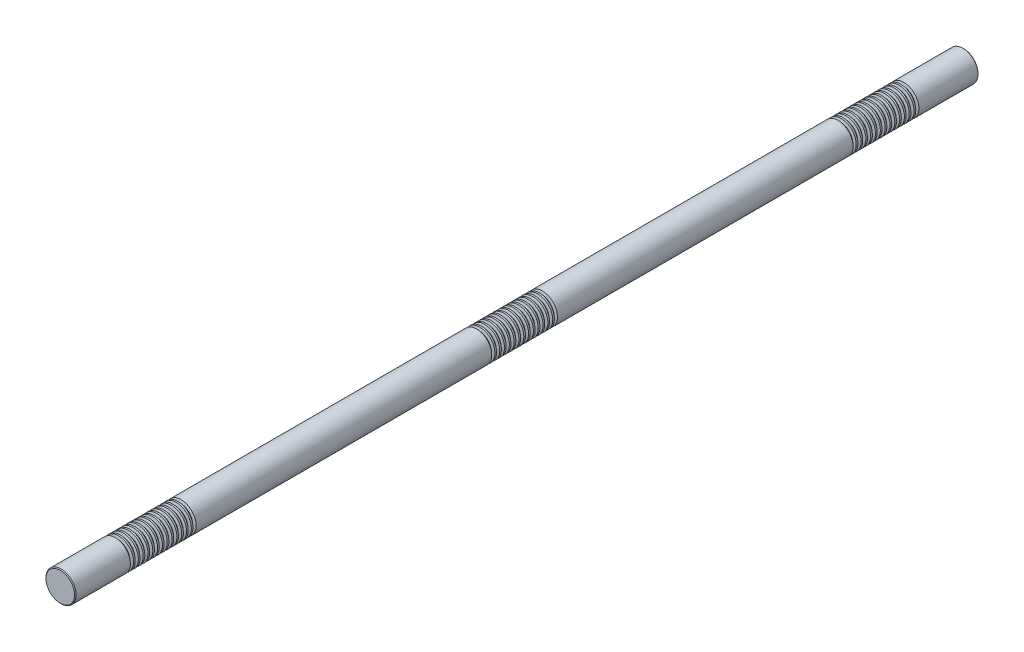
ISO-10303-21;
HEADER;
FILE_DESCRIPTION(('STEP AP214'),'2;1');
FILE_NAME('part.step','',(''),(''),'','','');
FILE_SCHEMA(('AUTOMOTIVE_DESIGN { 1 0 10303 214 1 1 1 1 }'));
ENDSEC;
DATA;
#1=APPLICATION_CONTEXT('core data for automotive mechanical design processes');
#2=APPLICATION_PROTOCOL_DEFINITION('international standard','automotive_design',2000,#1);
#3=PRODUCT_CONTEXT('',#1,'mechanical');
#4=PRODUCT('Part','Part','',(#3));
#5=PRODUCT_RELATED_PRODUCT_CATEGORY('part','',(#4));
#6=PRODUCT_DEFINITION_FORMATION('','',#4);
#7=PRODUCT_DEFINITION_CONTEXT('part definition',#1,'design');
#8=PRODUCT_DEFINITION('design','',#6,#7);
#9=PRODUCT_DEFINITION_SHAPE('','',#8);
#10=(LENGTH_UNIT() NAMED_UNIT(*) SI_UNIT(.MILLI.,.METRE.));
#11=(NAMED_UNIT(*) PLANE_ANGLE_UNIT() SI_UNIT($,.RADIAN.));
#12=(NAMED_UNIT(*) SI_UNIT($,.STERADIAN.) SOLID_ANGLE_UNIT());
#13=UNCERTAINTY_MEASURE_WITH_UNIT(LENGTH_MEASURE(1.E-05),#10,'distance_accuracy_value','');
#14=(GEOMETRIC_REPRESENTATION_CONTEXT(3) GLOBAL_UNCERTAINTY_ASSIGNED_CONTEXT((#13)) GLOBAL_UNIT_ASSIGNED_CONTEXT((#10,
#11,#12)) REPRESENTATION_CONTEXT('',''));
#15=CARTESIAN_POINT('',(0.,0.,0.));
#16=DIRECTION('',(0.,0.,1.));
#17=DIRECTION('',(1.,0.,0.));
#18=AXIS2_PLACEMENT_3D('',#15,#16,#17);
#19=CARTESIAN_POINT('',(0.,0.,750.));
#20=DIRECTION('',(0.,0.,-1.));
#21=DIRECTION('',(-1.,0.,0.));
#22=AXIS2_PLACEMENT_3D('',#19,#20,#21);
#23=CYLINDRICAL_SURFACE('',#22,25.);
#24=CARTESIAN_POINT('',(0.,0.,650.60288568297));
#25=DIRECTION('',(0.,0.,1.));
#26=DIRECTION('',(1.,0.,0.));
#27=AXIS2_PLACEMENT_3D('',#24,#25,#26);
#28=CIRCLE('',#27,25.);
#29=CARTESIAN_POINT('',(25.,0.,650.60288568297));
#30=VERTEX_POINT('',#29);
#31=EDGE_CURVE('E705',#30,#30,#28,.T.);
#32=ORIENTED_EDGE('',*,*,#31,.T.);
#33=EDGE_LOOP('',(#32));
#34=FACE_BOUND('',#33,.T.);
#35=CARTESIAN_POINT('',(0.,0.,653.39711431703));
#36=DIRECTION('',(0.,0.,1.));
#37=DIRECTION('',(1.,0.,0.));
#38=AXIS2_PLACEMENT_3D('',#35,#36,#37);
#39=CIRCLE('',#38,25.);
#40=CARTESIAN_POINT('',(25.,0.,653.39711431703));
#41=VERTEX_POINT('',#40);
#42=EDGE_CURVE('E717',#41,#41,#39,.T.);
#43=ORIENTED_EDGE('',*,*,#42,.F.);
#44=EDGE_LOOP('',(#43));
#45=FACE_BOUND('',#44,.T.);
#46=ADVANCED_FACE('F37',(#34,#45),#23,.T.);
#47=CARTESIAN_POINT('',(0.,0.,642.60288568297));
#48=DIRECTION('',(0.,0.,1.));
#49=DIRECTION('',(1.,0.,0.));
#50=AXIS2_PLACEMENT_3D('',#47,#48,#49);
#51=CIRCLE('',#50,25.);
#52=CARTESIAN_POINT('',(25.,0.,642.60288568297));
#53=VERTEX_POINT('',#52);
#54=EDGE_CURVE('E690',#53,#53,#51,.T.);
#55=ORIENTED_EDGE('',*,*,#54,.T.);
#56=EDGE_LOOP('',(#55));
#57=FACE_BOUND('',#56,.T.);
#58=CARTESIAN_POINT('',(0.,0.,645.39711431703));
#59=DIRECTION('',(0.,0.,1.));
#60=DIRECTION('',(1.,0.,0.));
#61=AXIS2_PLACEMENT_3D('',#58,#59,#60);
#62=CIRCLE('',#61,25.);
#63=CARTESIAN_POINT('',(25.,0.,645.39711431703));
#64=VERTEX_POINT('',#63);
#65=EDGE_CURVE('E701',#64,#64,#62,.T.);
#66=ORIENTED_EDGE('',*,*,#65,.F.);
#67=EDGE_LOOP('',(#66));
#68=FACE_BOUND('',#67,.T.);
#69=ADVANCED_FACE('F753',(#57,#68),#23,.T.);
#70=CARTESIAN_POINT('',(0.,0.,634.60288568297));
#71=DIRECTION('',(0.,0.,1.));
#72=DIRECTION('',(1.,0.,0.));
#73=AXIS2_PLACEMENT_3D('',#70,#71,#72);
#74=CIRCLE('',#73,25.);
#75=CARTESIAN_POINT('',(25.,0.,634.60288568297));
#76=VERTEX_POINT('',#75);
#77=EDGE_CURVE('E674',#76,#76,#74,.T.);
#78=ORIENTED_EDGE('',*,*,#77,.T.);
#79=EDGE_LOOP('',(#78));
#80=FACE_BOUND('',#79,.T.);
#81=CARTESIAN_POINT('',(0.,0.,637.39711431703));
#82=DIRECTION('',(0.,0.,1.));
#83=DIRECTION('',(1.,0.,0.));
#84=AXIS2_PLACEMENT_3D('',#81,#82,#83);
#85=CIRCLE('',#84,25.);
#86=CARTESIAN_POINT('',(25.,0.,637.39711431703));
#87=VERTEX_POINT('',#86);
#88=EDGE_CURVE('E686',#87,#87,#85,.T.);
#89=ORIENTED_EDGE('',*,*,#88,.F.);
#90=EDGE_LOOP('',(#89));
#91=FACE_BOUND('',#90,.T.);
#92=ADVANCED_FACE('F761',(#80,#91),#23,.T.);
#93=CARTESIAN_POINT('',(0.,0.,626.60288568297));
#94=DIRECTION('',(0.,0.,1.));
#95=DIRECTION('',(1.,0.,0.));
#96=AXIS2_PLACEMENT_3D('',#93,#94,#95);
#97=CIRCLE('',#96,25.);
#98=CARTESIAN_POINT('',(25.,0.,626.60288568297));
#99=VERTEX_POINT('',#98);
#100=EDGE_CURVE('E658',#99,#99,#97,.T.);
#101=ORIENTED_EDGE('',*,*,#100,.T.);
#102=EDGE_LOOP('',(#101));
#103=FACE_BOUND('',#102,.T.);
#104=CARTESIAN_POINT('',(0.,0.,629.39711431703));
#105=DIRECTION('',(0.,0.,1.));
#106=DIRECTION('',(1.,0.,0.));
#107=AXIS2_PLACEMENT_3D('',#104,#105,#106);
#108=CIRCLE('',#107,25.);
#109=CARTESIAN_POINT('',(25.,0.,629.39711431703));
#110=VERTEX_POINT('',#109);
#111=EDGE_CURVE('E670',#110,#110,#108,.T.);
#112=ORIENTED_EDGE('',*,*,#111,.F.);
#113=EDGE_LOOP('',(#112));
#114=FACE_BOUND('',#113,.T.);
#115=ADVANCED_FACE('F1630',(#103,#114),#23,.T.);
#116=CARTESIAN_POINT('',(0.,0.,618.60288568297));
#117=DIRECTION('',(0.,0.,1.));
#118=DIRECTION('',(1.,0.,0.));
#119=AXIS2_PLACEMENT_3D('',#116,#117,#118);
#120=CIRCLE('',#119,25.);
#121=CARTESIAN_POINT('',(25.,0.,618.60288568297));
#122=VERTEX_POINT('',#121);
#123=EDGE_CURVE('E642',#122,#122,#120,.T.);
#124=ORIENTED_EDGE('',*,*,#123,.T.);
#125=EDGE_LOOP('',(#124));
#126=FACE_BOUND('',#125,.T.);
#127=CARTESIAN_POINT('',(0.,0.,621.39711431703));
#128=DIRECTION('',(0.,0.,1.));
#129=DIRECTION('',(1.,0.,0.));
#130=AXIS2_PLACEMENT_3D('',#127,#128,#129);
#131=CIRCLE('',#130,25.);
#132=CARTESIAN_POINT('',(25.,0.,621.39711431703));
#133=VERTEX_POINT('',#132);
#134=EDGE_CURVE('E654',#133,#133,#131,.T.);
#135=ORIENTED_EDGE('',*,*,#134,.F.);
#136=EDGE_LOOP('',(#135));
#137=FACE_BOUND('',#136,.T.);
#138=ADVANCED_FACE('F1607',(#126,#137),#23,.T.);
#139=CARTESIAN_POINT('',(0.,0.,610.60288568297));
#140=DIRECTION('',(0.,0.,1.));
#141=DIRECTION('',(1.,0.,0.));
#142=AXIS2_PLACEMENT_3D('',#139,#140,#141);
#143=CIRCLE('',#142,25.);
#144=CARTESIAN_POINT('',(25.,0.,610.60288568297));
#145=VERTEX_POINT('',#144);
#146=EDGE_CURVE('E627',#145,#145,#143,.T.);
#147=ORIENTED_EDGE('',*,*,#146,.T.);
#148=EDGE_LOOP('',(#147));
#149=FACE_BOUND('',#148,.T.);
#150=CARTESIAN_POINT('',(0.,0.,613.39711431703));
#151=DIRECTION('',(0.,0.,1.));
#152=DIRECTION('',(1.,0.,0.));
#153=AXIS2_PLACEMENT_3D('',#150,#151,#152);
#154=CIRCLE('',#153,25.);
#155=CARTESIAN_POINT('',(25.,0.,613.39711431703));
#156=VERTEX_POINT('',#155);
#157=EDGE_CURVE('E639',#156,#156,#154,.T.);
#158=ORIENTED_EDGE('',*,*,#157,.F.);
#159=EDGE_LOOP('',(#158));
#160=FACE_BOUND('',#159,.T.);
#161=ADVANCED_FACE('F1584',(#149,#160),#23,.T.);
#162=CARTESIAN_POINT('',(0.,0.,602.60288568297));
#163=DIRECTION('',(0.,0.,1.));
#164=DIRECTION('',(1.,0.,0.));
#165=AXIS2_PLACEMENT_3D('',#162,#163,#164);
#166=CIRCLE('',#165,25.);
#167=CARTESIAN_POINT('',(25.,0.,602.60288568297));
#168=VERTEX_POINT('',#167);
#169=EDGE_CURVE('E611',#168,#168,#166,.T.);
#170=ORIENTED_EDGE('',*,*,#169,.T.);
#171=EDGE_LOOP('',(#170));
#172=FACE_BOUND('',#171,.T.);
#173=CARTESIAN_POINT('',(0.,0.,605.39711431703));
#174=DIRECTION('',(0.,0.,1.));
#175=DIRECTION('',(1.,0.,0.));
#176=AXIS2_PLACEMENT_3D('',#173,#174,#175);
#177=CIRCLE('',#176,25.);
#178=CARTESIAN_POINT('',(25.,0.,605.39711431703));
#179=VERTEX_POINT('',#178);
#180=EDGE_CURVE('E623',#179,#179,#177,.T.);
#181=ORIENTED_EDGE('',*,*,#180,.F.);
#182=EDGE_LOOP('',(#181));
#183=FACE_BOUND('',#182,.T.);
#184=ADVANCED_FACE('F1561',(#172,#183),#23,.T.);
#185=CARTESIAN_POINT('',(0.,0.,594.60288568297));
#186=DIRECTION('',(0.,0.,1.));
#187=DIRECTION('',(1.,0.,0.));
#188=AXIS2_PLACEMENT_3D('',#185,#186,#187);
#189=CIRCLE('',#188,25.);
#190=CARTESIAN_POINT('',(25.,0.,594.60288568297));
#191=VERTEX_POINT('',#190);
#192=EDGE_CURVE('E595',#191,#191,#189,.T.);
#193=ORIENTED_EDGE('',*,*,#192,.T.);
#194=EDGE_LOOP('',(#193));
#195=FACE_BOUND('',#194,.T.);
#196=CARTESIAN_POINT('',(0.,0.,597.39711431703));
#197=DIRECTION('',(0.,0.,1.));
#198=DIRECTION('',(1.,0.,0.));
#199=AXIS2_PLACEMENT_3D('',#196,#197,#198);
#200=CIRCLE('',#199,25.);
#201=CARTESIAN_POINT('',(25.,0.,597.39711431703));
#202=VERTEX_POINT('',#201);
#203=EDGE_CURVE('E607',#202,#202,#200,.T.);
#204=ORIENTED_EDGE('',*,*,#203,.F.);
#205=EDGE_LOOP('',(#204));
#206=FACE_BOUND('',#205,.T.);
#207=ADVANCED_FACE('F1538',(#195,#206),#23,.T.);
#208=CARTESIAN_POINT('',(0.,0.,586.60288568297));
#209=DIRECTION('',(0.,0.,1.));
#210=DIRECTION('',(1.,0.,0.));
#211=AXIS2_PLACEMENT_3D('',#208,#209,#210);
#212=CIRCLE('',#211,25.);
#213=CARTESIAN_POINT('',(25.,0.,586.60288568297));
#214=VERTEX_POINT('',#213);
#215=EDGE_CURVE('E579',#214,#214,#212,.T.);
#216=ORIENTED_EDGE('',*,*,#215,.T.);
#217=EDGE_LOOP('',(#216));
#218=FACE_BOUND('',#217,.T.);
#219=CARTESIAN_POINT('',(0.,0.,589.39711431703));
#220=DIRECTION('',(0.,0.,1.));
#221=DIRECTION('',(1.,0.,0.));
#222=AXIS2_PLACEMENT_3D('',#219,#220,#221);
#223=CIRCLE('',#222,25.);
#224=CARTESIAN_POINT('',(25.,0.,589.39711431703));
#225=VERTEX_POINT('',#224);
#226=EDGE_CURVE('E591',#225,#225,#223,.T.);
#227=ORIENTED_EDGE('',*,*,#226,.F.);
#228=EDGE_LOOP('',(#227));
#229=FACE_BOUND('',#228,.T.);
#230=ADVANCED_FACE('F1515',(#218,#229),#23,.T.);
#231=CARTESIAN_POINT('',(0.,0.,578.60288568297));
#232=DIRECTION('',(0.,0.,1.));
#233=DIRECTION('',(1.,0.,0.));
#234=AXIS2_PLACEMENT_3D('',#231,#232,#233);
#235=CIRCLE('',#234,25.);
#236=CARTESIAN_POINT('',(25.,0.,578.60288568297));
#237=VERTEX_POINT('',#236);
#238=EDGE_CURVE('E563',#237,#237,#235,.T.);
#239=ORIENTED_EDGE('',*,*,#238,.T.);
#240=EDGE_LOOP('',(#239));
#241=FACE_BOUND('',#240,.T.);
#242=CARTESIAN_POINT('',(0.,0.,581.39711431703));
#243=DIRECTION('',(0.,0.,1.));
#244=DIRECTION('',(1.,0.,0.));
#245=AXIS2_PLACEMENT_3D('',#242,#243,#244);
#246=CIRCLE('',#245,25.);
#247=CARTESIAN_POINT('',(25.,0.,581.39711431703));
#248=VERTEX_POINT('',#247);
#249=EDGE_CURVE('E575',#248,#248,#246,.T.);
#250=ORIENTED_EDGE('',*,*,#249,.F.);
#251=EDGE_LOOP('',(#250));
#252=FACE_BOUND('',#251,.T.);
#253=ADVANCED_FACE('F1492',(#241,#252),#23,.T.);
#254=CARTESIAN_POINT('',(0.,0.,570.60288568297));
#255=DIRECTION('',(0.,0.,1.));
#256=DIRECTION('',(1.,0.,0.));
#257=AXIS2_PLACEMENT_3D('',#254,#255,#256);
#258=CIRCLE('',#257,25.);
#259=CARTESIAN_POINT('',(25.,0.,570.60288568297));
#260=VERTEX_POINT('',#259);
#261=EDGE_CURVE('E547',#260,#260,#258,.T.);
#262=ORIENTED_EDGE('',*,*,#261,.T.);
#263=EDGE_LOOP('',(#262));
#264=FACE_BOUND('',#263,.T.);
#265=CARTESIAN_POINT('',(0.,0.,573.39711431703));
#266=DIRECTION('',(0.,0.,1.));
#267=DIRECTION('',(1.,0.,0.));
#268=AXIS2_PLACEMENT_3D('',#265,#266,#267);
#269=CIRCLE('',#268,25.);
#270=CARTESIAN_POINT('',(25.,0.,573.39711431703));
#271=VERTEX_POINT('',#270);
#272=EDGE_CURVE('E559',#271,#271,#269,.T.);
#273=ORIENTED_EDGE('',*,*,#272,.F.);
#274=EDGE_LOOP('',(#273));
#275=FACE_BOUND('',#274,.T.);
#276=ADVANCED_FACE('F1469',(#264,#275),#23,.T.);
#277=CARTESIAN_POINT('',(0.,0.,562.60288568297));
#278=DIRECTION('',(0.,0.,1.));
#279=DIRECTION('',(1.,0.,0.));
#280=AXIS2_PLACEMENT_3D('',#277,#278,#279);
#281=CIRCLE('',#280,25.);
#282=CARTESIAN_POINT('',(25.,0.,562.60288568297));
#283=VERTEX_POINT('',#282);
#284=EDGE_CURVE('E531',#283,#283,#281,.T.);
#285=ORIENTED_EDGE('',*,*,#284,.T.);
#286=EDGE_LOOP('',(#285));
#287=FACE_BOUND('',#286,.T.);
#288=CARTESIAN_POINT('',(0.,0.,565.39711431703));
#289=DIRECTION('',(0.,0.,1.));
#290=DIRECTION('',(1.,0.,0.));
#291=AXIS2_PLACEMENT_3D('',#288,#289,#290);
#292=CIRCLE('',#291,25.);
#293=CARTESIAN_POINT('',(25.,0.,565.39711431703));
#294=VERTEX_POINT('',#293);
#295=EDGE_CURVE('E543',#294,#294,#292,.T.);
#296=ORIENTED_EDGE('',*,*,#295,.F.);
#297=EDGE_LOOP('',(#296));
#298=FACE_BOUND('',#297,.T.);
#299=ADVANCED_FACE('F1450',(#287,#298),#23,.T.);
#300=CARTESIAN_POINT('',(0.,0.,554.60288568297));
#301=DIRECTION('',(0.,0.,1.));
#302=DIRECTION('',(1.,0.,0.));
#303=AXIS2_PLACEMENT_3D('',#300,#301,#302);
#304=CIRCLE('',#303,25.);
#305=CARTESIAN_POINT('',(25.,0.,554.60288568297));
#306=VERTEX_POINT('',#305);
#307=EDGE_CURVE('E308',#306,#306,#304,.T.);
#308=ORIENTED_EDGE('',*,*,#307,.T.);
#309=EDGE_LOOP('',(#308));
#310=FACE_BOUND('',#309,.T.);
#311=CARTESIAN_POINT('',(0.,0.,557.39711431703));
#312=DIRECTION('',(0.,0.,1.));
#313=DIRECTION('',(1.,0.,0.));
#314=AXIS2_PLACEMENT_3D('',#311,#312,#313);
#315=CIRCLE('',#314,25.);
#316=CARTESIAN_POINT('',(25.,0.,557.39711431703));
#317=VERTEX_POINT('',#316);
#318=EDGE_CURVE('E527',#317,#317,#315,.T.);
#319=ORIENTED_EDGE('',*,*,#318,.F.);
#320=EDGE_LOOP('',(#319));
#321=FACE_BOUND('',#320,.T.);
#322=ADVANCED_FACE('F1399',(#310,#321),#23,.T.);
#323=CARTESIAN_POINT('',(0.,0.,50.6028856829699));
#324=DIRECTION('',(0.,0.,1.));
#325=DIRECTION('',(1.,0.,0.));
#326=AXIS2_PLACEMENT_3D('',#323,#324,#325);
#327=CIRCLE('',#326,25.);
#328=CARTESIAN_POINT('',(25.,0.,50.6028856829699));
#329=VERTEX_POINT('',#328);
#330=EDGE_CURVE('E499',#329,#329,#327,.T.);
#331=ORIENTED_EDGE('',*,*,#330,.T.);
#332=EDGE_LOOP('',(#331));
#333=FACE_BOUND('',#332,.T.);
#334=CARTESIAN_POINT('',(0.,0.,53.3971143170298));
#335=DIRECTION('',(0.,0.,1.));
#336=DIRECTION('',(1.,0.,0.));
#337=AXIS2_PLACEMENT_3D('',#334,#335,#336);
#338=CIRCLE('',#337,25.);
#339=CARTESIAN_POINT('',(25.,0.,53.3971143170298));
#340=VERTEX_POINT('',#339);
#341=EDGE_CURVE('E511',#340,#340,#338,.T.);
#342=ORIENTED_EDGE('',*,*,#341,.F.);
#343=EDGE_LOOP('',(#342));
#344=FACE_BOUND('',#343,.T.);
#345=ADVANCED_FACE('F1375',(#333,#344),#23,.T.);
#346=CARTESIAN_POINT('',(0.,0.,42.6028856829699));
#347=DIRECTION('',(0.,0.,1.));
#348=DIRECTION('',(1.,0.,0.));
#349=AXIS2_PLACEMENT_3D('',#346,#347,#348);
#350=CIRCLE('',#349,25.);
#351=CARTESIAN_POINT('',(25.,0.,42.6028856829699));
#352=VERTEX_POINT('',#351);
#353=EDGE_CURVE('E483',#352,#352,#350,.T.);
#354=ORIENTED_EDGE('',*,*,#353,.T.);
#355=EDGE_LOOP('',(#354));
#356=FACE_BOUND('',#355,.T.);
#357=CARTESIAN_POINT('',(0.,0.,45.3971143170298));
#358=DIRECTION('',(0.,0.,1.));
#359=DIRECTION('',(1.,0.,0.));
#360=AXIS2_PLACEMENT_3D('',#357,#358,#359);
#361=CIRCLE('',#360,25.);
#362=CARTESIAN_POINT('',(25.,0.,45.3971143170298));
#363=VERTEX_POINT('',#362);
#364=EDGE_CURVE('E495',#363,#363,#361,.T.);
#365=ORIENTED_EDGE('',*,*,#364,.F.);
#366=EDGE_LOOP('',(#365));
#367=FACE_BOUND('',#366,.T.);
#368=ADVANCED_FACE('F1352',(#356,#367),#23,.T.);
#369=CARTESIAN_POINT('',(0.,0.,34.6028856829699));
#370=DIRECTION('',(0.,0.,1.));
#371=DIRECTION('',(1.,0.,0.));
#372=AXIS2_PLACEMENT_3D('',#369,#370,#371);
#373=CIRCLE('',#372,25.);
#374=CARTESIAN_POINT('',(25.,0.,34.6028856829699));
#375=VERTEX_POINT('',#374);
#376=EDGE_CURVE('E467',#375,#375,#373,.T.);
#377=ORIENTED_EDGE('',*,*,#376,.T.);
#378=EDGE_LOOP('',(#377));
#379=FACE_BOUND('',#378,.T.);
#380=CARTESIAN_POINT('',(0.,0.,37.3971143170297));
#381=DIRECTION('',(0.,0.,1.));
#382=DIRECTION('',(1.,0.,0.));
#383=AXIS2_PLACEMENT_3D('',#380,#381,#382);
#384=CIRCLE('',#383,25.);
#385=CARTESIAN_POINT('',(25.,0.,37.3971143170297));
#386=VERTEX_POINT('',#385);
#387=EDGE_CURVE('E479',#386,#386,#384,.T.);
#388=ORIENTED_EDGE('',*,*,#387,.F.);
#389=EDGE_LOOP('',(#388));
#390=FACE_BOUND('',#389,.T.);
#391=ADVANCED_FACE('F1329',(#379,#390),#23,.T.);
#392=CARTESIAN_POINT('',(0.,0.,26.6028856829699));
#393=DIRECTION('',(0.,0.,1.));
#394=DIRECTION('',(1.,0.,0.));
#395=AXIS2_PLACEMENT_3D('',#392,#393,#394);
#396=CIRCLE('',#395,25.);
#397=CARTESIAN_POINT('',(25.,0.,26.6028856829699));
#398=VERTEX_POINT('',#397);
#399=EDGE_CURVE('E451',#398,#398,#396,.T.);
#400=ORIENTED_EDGE('',*,*,#399,.T.);
#401=EDGE_LOOP('',(#400));
#402=FACE_BOUND('',#401,.T.);
#403=CARTESIAN_POINT('',(0.,0.,29.3971143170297));
#404=DIRECTION('',(0.,0.,1.));
#405=DIRECTION('',(1.,0.,0.));
#406=AXIS2_PLACEMENT_3D('',#403,#404,#405);
#407=CIRCLE('',#406,25.);
#408=CARTESIAN_POINT('',(25.,0.,29.3971143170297));
#409=VERTEX_POINT('',#408);
#410=EDGE_CURVE('E463',#409,#409,#407,.T.);
#411=ORIENTED_EDGE('',*,*,#410,.F.);
#412=EDGE_LOOP('',(#411));
#413=FACE_BOUND('',#412,.T.);
#414=ADVANCED_FACE('F1306',(#402,#413),#23,.T.);
#415=CARTESIAN_POINT('',(0.,0.,18.6028856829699));
#416=DIRECTION('',(0.,0.,1.));
#417=DIRECTION('',(1.,0.,0.));
#418=AXIS2_PLACEMENT_3D('',#415,#416,#417);
#419=CIRCLE('',#418,25.);
#420=CARTESIAN_POINT('',(25.,0.,18.6028856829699));
#421=VERTEX_POINT('',#420);
#422=EDGE_CURVE('E435',#421,#421,#419,.T.);
#423=ORIENTED_EDGE('',*,*,#422,.T.);
#424=EDGE_LOOP('',(#423));
#425=FACE_BOUND('',#424,.T.);
#426=CARTESIAN_POINT('',(0.,0.,21.3971143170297));
#427=DIRECTION('',(0.,0.,1.));
#428=DIRECTION('',(1.,0.,0.));
#429=AXIS2_PLACEMENT_3D('',#426,#427,#428);
#430=CIRCLE('',#429,25.);
#431=CARTESIAN_POINT('',(25.,0.,21.3971143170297));
#432=VERTEX_POINT('',#431);
#433=EDGE_CURVE('E447',#432,#432,#430,.T.);
#434=ORIENTED_EDGE('',*,*,#433,.F.);
#435=EDGE_LOOP('',(#434));
#436=FACE_BOUND('',#435,.T.);
#437=ADVANCED_FACE('F1283',(#425,#436),#23,.T.);
#438=CARTESIAN_POINT('',(0.,0.,10.60288568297));
#439=DIRECTION('',(0.,0.,1.));
#440=DIRECTION('',(1.,0.,0.));
#441=AXIS2_PLACEMENT_3D('',#438,#439,#440);
#442=CIRCLE('',#441,25.);
#443=CARTESIAN_POINT('',(25.,0.,10.60288568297));
#444=VERTEX_POINT('',#443);
#445=EDGE_CURVE('E419',#444,#444,#442,.T.);
#446=ORIENTED_EDGE('',*,*,#445,.T.);
#447=EDGE_LOOP('',(#446));
#448=FACE_BOUND('',#447,.T.);
#449=CARTESIAN_POINT('',(0.,0.,13.3971143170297));
#450=DIRECTION('',(0.,0.,1.));
#451=DIRECTION('',(1.,0.,0.));
#452=AXIS2_PLACEMENT_3D('',#449,#450,#451);
#453=CIRCLE('',#452,25.);
#454=CARTESIAN_POINT('',(25.,0.,13.3971143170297));
#455=VERTEX_POINT('',#454);
#456=EDGE_CURVE('E431',#455,#455,#453,.T.);
#457=ORIENTED_EDGE('',*,*,#456,.F.);
#458=EDGE_LOOP('',(#457));
#459=FACE_BOUND('',#458,.T.);
#460=ADVANCED_FACE('F1260',(#448,#459),#23,.T.);
#461=CARTESIAN_POINT('',(0.,0.,2.60288568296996));
#462=DIRECTION('',(0.,0.,1.));
#463=DIRECTION('',(1.,0.,0.));
#464=AXIS2_PLACEMENT_3D('',#461,#462,#463);
#465=CIRCLE('',#464,25.);
#466=CARTESIAN_POINT('',(25.,0.,2.60288568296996));
#467=VERTEX_POINT('',#466);
#468=EDGE_CURVE('E403',#467,#467,#465,.T.);
#469=ORIENTED_EDGE('',*,*,#468,.T.);
#470=EDGE_LOOP('',(#469));
#471=FACE_BOUND('',#470,.T.);
#472=CARTESIAN_POINT('',(0.,0.,5.39711431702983));
#473=DIRECTION('',(0.,0.,1.));
#474=DIRECTION('',(1.,0.,0.));
#475=AXIS2_PLACEMENT_3D('',#472,#473,#474);
#476=CIRCLE('',#475,25.);
#477=CARTESIAN_POINT('',(25.,0.,5.39711431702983));
#478=VERTEX_POINT('',#477);
#479=EDGE_CURVE('E415',#478,#478,#476,.T.);
#480=ORIENTED_EDGE('',*,*,#479,.F.);
#481=EDGE_LOOP('',(#480));
#482=FACE_BOUND('',#481,.T.);
#483=ADVANCED_FACE('F1237',(#471,#482),#23,.T.);
#484=CARTESIAN_POINT('',(0.,0.,-5.39711431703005));
#485=DIRECTION('',(0.,0.,1.));
#486=DIRECTION('',(1.,0.,0.));
#487=AXIS2_PLACEMENT_3D('',#484,#485,#486);
#488=CIRCLE('',#487,25.);
#489=CARTESIAN_POINT('',(25.,0.,-5.39711431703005));
#490=VERTEX_POINT('',#489);
#491=EDGE_CURVE('E387',#490,#490,#488,.T.);
#492=ORIENTED_EDGE('',*,*,#491,.T.);
#493=EDGE_LOOP('',(#492));
#494=FACE_BOUND('',#493,.T.);
#495=CARTESIAN_POINT('',(0.,0.,-2.60288568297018));
#496=DIRECTION('',(0.,0.,1.));
#497=DIRECTION('',(1.,0.,0.));
#498=AXIS2_PLACEMENT_3D('',#495,#496,#497);
#499=CIRCLE('',#498,25.);
#500=CARTESIAN_POINT('',(25.,0.,-2.60288568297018));
#501=VERTEX_POINT('',#500);
#502=EDGE_CURVE('E399',#501,#501,#499,.T.);
#503=ORIENTED_EDGE('',*,*,#502,.F.);
#504=EDGE_LOOP('',(#503));
#505=FACE_BOUND('',#504,.T.);
#506=ADVANCED_FACE('F1214',(#494,#505),#23,.T.);
#507=CARTESIAN_POINT('',(0.,0.,-13.3971143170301));
#508=DIRECTION('',(0.,0.,1.));
#509=DIRECTION('',(1.,0.,0.));
#510=AXIS2_PLACEMENT_3D('',#507,#508,#509);
#511=CIRCLE('',#510,25.);
#512=CARTESIAN_POINT('',(25.,0.,-13.3971143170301));
#513=VERTEX_POINT('',#512);
#514=EDGE_CURVE('E371',#513,#513,#511,.T.);
#515=ORIENTED_EDGE('',*,*,#514,.T.);
#516=EDGE_LOOP('',(#515));
#517=FACE_BOUND('',#516,.T.);
#518=CARTESIAN_POINT('',(0.,0.,-10.6028856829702));
#519=DIRECTION('',(0.,0.,1.));
#520=DIRECTION('',(1.,0.,0.));
#521=AXIS2_PLACEMENT_3D('',#518,#519,#520);
#522=CIRCLE('',#521,25.);
#523=CARTESIAN_POINT('',(25.,0.,-10.6028856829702));
#524=VERTEX_POINT('',#523);
#525=EDGE_CURVE('E383',#524,#524,#522,.T.);
#526=ORIENTED_EDGE('',*,*,#525,.F.);
#527=EDGE_LOOP('',(#526));
#528=FACE_BOUND('',#527,.T.);
#529=ADVANCED_FACE('F1191',(#517,#528),#23,.T.);
#530=CARTESIAN_POINT('',(0.,0.,-21.3971143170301));
#531=DIRECTION('',(0.,0.,1.));
#532=DIRECTION('',(1.,0.,0.));
#533=AXIS2_PLACEMENT_3D('',#530,#531,#532);
#534=CIRCLE('',#533,25.);
#535=CARTESIAN_POINT('',(25.,0.,-21.3971143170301));
#536=VERTEX_POINT('',#535);
#537=EDGE_CURVE('E355',#536,#536,#534,.T.);
#538=ORIENTED_EDGE('',*,*,#537,.T.);
#539=EDGE_LOOP('',(#538));
#540=FACE_BOUND('',#539,.T.);
#541=CARTESIAN_POINT('',(0.,0.,-18.6028856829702));
#542=DIRECTION('',(0.,0.,1.));
#543=DIRECTION('',(1.,0.,0.));
#544=AXIS2_PLACEMENT_3D('',#541,#542,#543);
#545=CIRCLE('',#544,25.);
#546=CARTESIAN_POINT('',(25.,0.,-18.6028856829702));
#547=VERTEX_POINT('',#546);
#548=EDGE_CURVE('E367',#547,#547,#545,.T.);
#549=ORIENTED_EDGE('',*,*,#548,.F.);
#550=EDGE_LOOP('',(#549));
#551=FACE_BOUND('',#550,.T.);
#552=ADVANCED_FACE('F1168',(#540,#551),#23,.T.);
#553=CARTESIAN_POINT('',(0.,0.,-29.3971143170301));
#554=DIRECTION('',(0.,0.,1.));
#555=DIRECTION('',(1.,0.,0.));
#556=AXIS2_PLACEMENT_3D('',#553,#554,#555);
#557=CIRCLE('',#556,25.);
#558=CARTESIAN_POINT('',(25.,0.,-29.3971143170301));
#559=VERTEX_POINT('',#558);
#560=EDGE_CURVE('E339',#559,#559,#557,.T.);
#561=ORIENTED_EDGE('',*,*,#560,.T.);
#562=EDGE_LOOP('',(#561));
#563=FACE_BOUND('',#562,.T.);
#564=CARTESIAN_POINT('',(0.,0.,-26.6028856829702));
#565=DIRECTION('',(0.,0.,1.));
#566=DIRECTION('',(1.,0.,0.));
#567=AXIS2_PLACEMENT_3D('',#564,#565,#566);
#568=CIRCLE('',#567,25.);
#569=CARTESIAN_POINT('',(25.,0.,-26.6028856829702));
#570=VERTEX_POINT('',#569);
#571=EDGE_CURVE('E351',#570,#570,#568,.T.);
#572=ORIENTED_EDGE('',*,*,#571,.F.);
#573=EDGE_LOOP('',(#572));
#574=FACE_BOUND('',#573,.T.);
#575=ADVANCED_FACE('F1145',(#563,#574),#23,.T.);
#576=CARTESIAN_POINT('',(0.,0.,-37.3971143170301));
#577=DIRECTION('',(0.,0.,1.));
#578=DIRECTION('',(1.,0.,0.));
#579=AXIS2_PLACEMENT_3D('',#576,#577,#578);
#580=CIRCLE('',#579,25.);
#581=CARTESIAN_POINT('',(25.,0.,-37.3971143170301));
#582=VERTEX_POINT('',#581);
#583=EDGE_CURVE('E324',#582,#582,#580,.T.);
#584=ORIENTED_EDGE('',*,*,#583,.T.);
#585=EDGE_LOOP('',(#584));
#586=FACE_BOUND('',#585,.T.);
#587=CARTESIAN_POINT('',(0.,0.,-34.6028856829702));
#588=DIRECTION('',(0.,0.,1.));
#589=DIRECTION('',(1.,0.,0.));
#590=AXIS2_PLACEMENT_3D('',#587,#588,#589);
#591=CIRCLE('',#590,25.);
#592=CARTESIAN_POINT('',(25.,0.,-34.6028856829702));
#593=VERTEX_POINT('',#592);
#594=EDGE_CURVE('E335',#593,#593,#591,.T.);
#595=ORIENTED_EDGE('',*,*,#594,.F.);
#596=EDGE_LOOP('',(#595));
#597=FACE_BOUND('',#596,.T.);
#598=ADVANCED_FACE('F1122',(#586,#597),#23,.T.);
#599=CARTESIAN_POINT('',(0.,0.,-45.3971143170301));
#600=DIRECTION('',(0.,0.,1.));
#601=DIRECTION('',(1.,0.,0.));
#602=AXIS2_PLACEMENT_3D('',#599,#600,#601);
#603=CIRCLE('',#602,25.);
#604=CARTESIAN_POINT('',(25.,0.,-45.3971143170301));
#605=VERTEX_POINT('',#604);
#606=EDGE_CURVE('E292',#605,#605,#603,.T.);
#607=ORIENTED_EDGE('',*,*,#606,.T.);
#608=EDGE_LOOP('',(#607));
#609=FACE_BOUND('',#608,.T.);
#610=CARTESIAN_POINT('',(0.,0.,-42.6028856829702));
#611=DIRECTION('',(0.,0.,1.));
#612=DIRECTION('',(1.,0.,0.));
#613=AXIS2_PLACEMENT_3D('',#610,#611,#612);
#614=CIRCLE('',#613,25.);
#615=CARTESIAN_POINT('',(25.,0.,-42.6028856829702));
#616=VERTEX_POINT('',#615);
#617=EDGE_CURVE('E320',#616,#616,#614,.T.);
#618=ORIENTED_EDGE('',*,*,#617,.F.);
#619=EDGE_LOOP('',(#618));
#620=FACE_BOUND('',#619,.T.);
#621=ADVANCED_FACE('F1099',(#609,#620),#23,.T.);
#622=CARTESIAN_POINT('',(0.,0.,-541.39711431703));
#623=DIRECTION('',(0.,0.,1.));
#624=DIRECTION('',(1.,0.,0.));
#625=AXIS2_PLACEMENT_3D('',#622,#623,#624);
#626=CIRCLE('',#625,25.);
#627=CARTESIAN_POINT('',(25.,0.,-541.39711431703));
#628=VERTEX_POINT('',#627);
#629=EDGE_CURVE('E276',#628,#628,#626,.T.);
#630=ORIENTED_EDGE('',*,*,#629,.T.);
#631=EDGE_LOOP('',(#630));
#632=FACE_BOUND('',#631,.T.);
#633=CARTESIAN_POINT('',(0.,0.,-50.6028856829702));
#634=DIRECTION('',(0.,0.,1.));
#635=DIRECTION('',(1.,0.,0.));
#636=AXIS2_PLACEMENT_3D('',#633,#634,#635);
#637=CIRCLE('',#636,25.);
#638=CARTESIAN_POINT('',(25.,0.,-50.6028856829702));
#639=VERTEX_POINT('',#638);
#640=EDGE_CURVE('E288',#639,#639,#637,.T.);
#641=ORIENTED_EDGE('',*,*,#640,.F.);
#642=EDGE_LOOP('',(#641));
#643=FACE_BOUND('',#642,.T.);
#644=ADVANCED_FACE('F1076',(#632,#643),#23,.T.);
#645=CARTESIAN_POINT('',(0.,0.,-549.39711431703));
#646=DIRECTION('',(0.,0.,1.));
#647=DIRECTION('',(1.,0.,0.));
#648=AXIS2_PLACEMENT_3D('',#645,#646,#647);
#649=CIRCLE('',#648,25.);
#650=CARTESIAN_POINT('',(25.,0.,-549.39711431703));
#651=VERTEX_POINT('',#650);
#652=EDGE_CURVE('E260',#651,#651,#649,.T.);
#653=ORIENTED_EDGE('',*,*,#652,.T.);
#654=EDGE_LOOP('',(#653));
#655=FACE_BOUND('',#654,.T.);
#656=CARTESIAN_POINT('',(0.,0.,-546.60288568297));
#657=DIRECTION('',(0.,0.,1.));
#658=DIRECTION('',(1.,0.,0.));
#659=AXIS2_PLACEMENT_3D('',#656,#657,#658);
#660=CIRCLE('',#659,25.);
#661=CARTESIAN_POINT('',(25.,0.,-546.60288568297));
#662=VERTEX_POINT('',#661);
#663=EDGE_CURVE('E272',#662,#662,#660,.T.);
#664=ORIENTED_EDGE('',*,*,#663,.F.);
#665=EDGE_LOOP('',(#664));
#666=FACE_BOUND('',#665,.T.);
#667=ADVANCED_FACE('F1053',(#655,#666),#23,.T.);
#668=CARTESIAN_POINT('',(0.,0.,-557.39711431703));
#669=DIRECTION('',(0.,0.,1.));
#670=DIRECTION('',(1.,0.,0.));
#671=AXIS2_PLACEMENT_3D('',#668,#669,#670);
#672=CIRCLE('',#671,25.);
#673=CARTESIAN_POINT('',(25.,0.,-557.39711431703));
#674=VERTEX_POINT('',#673);
#675=EDGE_CURVE('E244',#674,#674,#672,.T.);
#676=ORIENTED_EDGE('',*,*,#675,.T.);
#677=EDGE_LOOP('',(#676));
#678=FACE_BOUND('',#677,.T.);
#679=CARTESIAN_POINT('',(0.,0.,-554.60288568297));
#680=DIRECTION('',(0.,0.,1.));
#681=DIRECTION('',(1.,0.,0.));
#682=AXIS2_PLACEMENT_3D('',#679,#680,#681);
#683=CIRCLE('',#682,25.);
#684=CARTESIAN_POINT('',(25.,0.,-554.60288568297));
#685=VERTEX_POINT('',#684);
#686=EDGE_CURVE('E256',#685,#685,#683,.T.);
#687=ORIENTED_EDGE('',*,*,#686,.F.);
#688=EDGE_LOOP('',(#687));
#689=FACE_BOUND('',#688,.T.);
#690=ADVANCED_FACE('F1030',(#678,#689),#23,.T.);
#691=CARTESIAN_POINT('',(0.,0.,-565.39711431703));
#692=DIRECTION('',(0.,0.,1.));
#693=DIRECTION('',(1.,0.,0.));
#694=AXIS2_PLACEMENT_3D('',#691,#692,#693);
#695=CIRCLE('',#694,25.);
#696=CARTESIAN_POINT('',(25.,0.,-565.39711431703));
#697=VERTEX_POINT('',#696);
#698=EDGE_CURVE('E229',#697,#697,#695,.T.);
#699=ORIENTED_EDGE('',*,*,#698,.T.);
#700=EDGE_LOOP('',(#699));
#701=FACE_BOUND('',#700,.T.);
#702=CARTESIAN_POINT('',(0.,0.,-562.60288568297));
#703=DIRECTION('',(0.,0.,1.));
#704=DIRECTION('',(1.,0.,0.));
#705=AXIS2_PLACEMENT_3D('',#702,#703,#704);
#706=CIRCLE('',#705,25.);
#707=CARTESIAN_POINT('',(25.,0.,-562.60288568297));
#708=VERTEX_POINT('',#707);
#709=EDGE_CURVE('E240',#708,#708,#706,.T.);
#710=ORIENTED_EDGE('',*,*,#709,.F.);
#711=EDGE_LOOP('',(#710));
#712=FACE_BOUND('',#711,.T.);
#713=ADVANCED_FACE('F1007',(#701,#712),#23,.T.);
#714=CARTESIAN_POINT('',(0.,0.,-573.39711431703));
#715=DIRECTION('',(0.,0.,1.));
#716=DIRECTION('',(1.,0.,0.));
#717=AXIS2_PLACEMENT_3D('',#714,#715,#716);
#718=CIRCLE('',#717,25.);
#719=CARTESIAN_POINT('',(25.,0.,-573.39711431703));
#720=VERTEX_POINT('',#719);
#721=EDGE_CURVE('E213',#720,#720,#718,.T.);
#722=ORIENTED_EDGE('',*,*,#721,.T.);
#723=EDGE_LOOP('',(#722));
#724=FACE_BOUND('',#723,.T.);
#725=CARTESIAN_POINT('',(0.,0.,-570.60288568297));
#726=DIRECTION('',(0.,0.,1.));
#727=DIRECTION('',(1.,0.,0.));
#728=AXIS2_PLACEMENT_3D('',#725,#726,#727);
#729=CIRCLE('',#728,25.);
#730=CARTESIAN_POINT('',(25.,0.,-570.60288568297));
#731=VERTEX_POINT('',#730);
#732=EDGE_CURVE('E225',#731,#731,#729,.T.);
#733=ORIENTED_EDGE('',*,*,#732,.F.);
#734=EDGE_LOOP('',(#733));
#735=FACE_BOUND('',#734,.T.);
#736=ADVANCED_FACE('F984',(#724,#735),#23,.T.);
#737=CARTESIAN_POINT('',(0.,0.,-581.39711431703));
#738=DIRECTION('',(0.,0.,1.));
#739=DIRECTION('',(1.,0.,0.));
#740=AXIS2_PLACEMENT_3D('',#737,#738,#739);
#741=CIRCLE('',#740,25.);
#742=CARTESIAN_POINT('',(25.,0.,-581.39711431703));
#743=VERTEX_POINT('',#742);
#744=EDGE_CURVE('E197',#743,#743,#741,.T.);
#745=ORIENTED_EDGE('',*,*,#744,.T.);
#746=EDGE_LOOP('',(#745));
#747=FACE_BOUND('',#746,.T.);
#748=CARTESIAN_POINT('',(0.,0.,-578.60288568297));
#749=DIRECTION('',(0.,0.,1.));
#750=DIRECTION('',(1.,0.,0.));
#751=AXIS2_PLACEMENT_3D('',#748,#749,#750);
#752=CIRCLE('',#751,25.);
#753=CARTESIAN_POINT('',(25.,0.,-578.60288568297));
#754=VERTEX_POINT('',#753);
#755=EDGE_CURVE('E209',#754,#754,#752,.T.);
#756=ORIENTED_EDGE('',*,*,#755,.F.);
#757=EDGE_LOOP('',(#756));
#758=FACE_BOUND('',#757,.T.);
#759=ADVANCED_FACE('F961',(#747,#758),#23,.T.);
#760=CARTESIAN_POINT('',(0.,0.,-589.39711431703));
#761=DIRECTION('',(0.,0.,1.));
#762=DIRECTION('',(1.,0.,0.));
#763=AXIS2_PLACEMENT_3D('',#760,#761,#762);
#764=CIRCLE('',#763,25.);
#765=CARTESIAN_POINT('',(25.,0.,-589.39711431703));
#766=VERTEX_POINT('',#765);
#767=EDGE_CURVE('E181',#766,#766,#764,.T.);
#768=ORIENTED_EDGE('',*,*,#767,.T.);
#769=EDGE_LOOP('',(#768));
#770=FACE_BOUND('',#769,.T.);
#771=CARTESIAN_POINT('',(0.,0.,-586.60288568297));
#772=DIRECTION('',(0.,0.,1.));
#773=DIRECTION('',(1.,0.,0.));
#774=AXIS2_PLACEMENT_3D('',#771,#772,#773);
#775=CIRCLE('',#774,25.);
#776=CARTESIAN_POINT('',(25.,0.,-586.60288568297));
#777=VERTEX_POINT('',#776);
#778=EDGE_CURVE('E193',#777,#777,#775,.T.);
#779=ORIENTED_EDGE('',*,*,#778,.F.);
#780=EDGE_LOOP('',(#779));
#781=FACE_BOUND('',#780,.T.);
#782=ADVANCED_FACE('F938',(#770,#781),#23,.T.);
#783=CARTESIAN_POINT('',(0.,0.,-597.39711431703));
#784=DIRECTION('',(0.,0.,1.));
#785=DIRECTION('',(1.,0.,0.));
#786=AXIS2_PLACEMENT_3D('',#783,#784,#785);
#787=CIRCLE('',#786,25.);
#788=CARTESIAN_POINT('',(25.,0.,-597.39711431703));
#789=VERTEX_POINT('',#788);
#790=EDGE_CURVE('E165',#789,#789,#787,.T.);
#791=ORIENTED_EDGE('',*,*,#790,.T.);
#792=EDGE_LOOP('',(#791));
#793=FACE_BOUND('',#792,.T.);
#794=CARTESIAN_POINT('',(0.,0.,-594.60288568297));
#795=DIRECTION('',(0.,0.,1.));
#796=DIRECTION('',(1.,0.,0.));
#797=AXIS2_PLACEMENT_3D('',#794,#795,#796);
#798=CIRCLE('',#797,25.);
#799=CARTESIAN_POINT('',(25.,0.,-594.60288568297));
#800=VERTEX_POINT('',#799);
#801=EDGE_CURVE('E177',#800,#800,#798,.T.);
#802=ORIENTED_EDGE('',*,*,#801,.F.);
#803=EDGE_LOOP('',(#802));
#804=FACE_BOUND('',#803,.T.);
#805=ADVANCED_FACE('F915',(#793,#804),#23,.T.);
#806=CARTESIAN_POINT('',(0.,0.,-605.39711431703));
#807=DIRECTION('',(0.,0.,1.));
#808=DIRECTION('',(1.,0.,0.));
#809=AXIS2_PLACEMENT_3D('',#806,#807,#808);
#810=CIRCLE('',#809,25.);
#811=CARTESIAN_POINT('',(25.,0.,-605.39711431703));
#812=VERTEX_POINT('',#811);
#813=EDGE_CURVE('E149',#812,#812,#810,.T.);
#814=ORIENTED_EDGE('',*,*,#813,.T.);
#815=EDGE_LOOP('',(#814));
#816=FACE_BOUND('',#815,.T.);
#817=CARTESIAN_POINT('',(0.,0.,-602.60288568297));
#818=DIRECTION('',(0.,0.,1.));
#819=DIRECTION('',(1.,0.,0.));
#820=AXIS2_PLACEMENT_3D('',#817,#818,#819);
#821=CIRCLE('',#820,25.);
#822=CARTESIAN_POINT('',(25.,0.,-602.60288568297));
#823=VERTEX_POINT('',#822);
#824=EDGE_CURVE('E161',#823,#823,#821,.T.);
#825=ORIENTED_EDGE('',*,*,#824,.F.);
#826=EDGE_LOOP('',(#825));
#827=FACE_BOUND('',#826,.T.);
#828=ADVANCED_FACE('F892',(#816,#827),#23,.T.);
#829=CARTESIAN_POINT('',(0.,0.,-613.39711431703));
#830=DIRECTION('',(0.,0.,1.));
#831=DIRECTION('',(1.,0.,0.));
#832=AXIS2_PLACEMENT_3D('',#829,#830,#831);
#833=CIRCLE('',#832,25.);
#834=CARTESIAN_POINT('',(25.,0.,-613.39711431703));
#835=VERTEX_POINT('',#834);
#836=EDGE_CURVE('E133',#835,#835,#833,.T.);
#837=ORIENTED_EDGE('',*,*,#836,.T.);
#838=EDGE_LOOP('',(#837));
#839=FACE_BOUND('',#838,.T.);
#840=CARTESIAN_POINT('',(0.,0.,-610.60288568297));
#841=DIRECTION('',(0.,0.,1.));
#842=DIRECTION('',(1.,0.,0.));
#843=AXIS2_PLACEMENT_3D('',#840,#841,#842);
#844=CIRCLE('',#843,25.);
#845=CARTESIAN_POINT('',(25.,0.,-610.60288568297));
#846=VERTEX_POINT('',#845);
#847=EDGE_CURVE('E145',#846,#846,#844,.T.);
#848=ORIENTED_EDGE('',*,*,#847,.F.);
#849=EDGE_LOOP('',(#848));
#850=FACE_BOUND('',#849,.T.);
#851=ADVANCED_FACE('F869',(#839,#850),#23,.T.);
#852=CARTESIAN_POINT('',(0.,0.,-621.39711431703));
#853=DIRECTION('',(0.,0.,1.));
#854=DIRECTION('',(1.,0.,0.));
#855=AXIS2_PLACEMENT_3D('',#852,#853,#854);
#856=CIRCLE('',#855,25.);
#857=CARTESIAN_POINT('',(25.,0.,-621.39711431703));
#858=VERTEX_POINT('',#857);
#859=EDGE_CURVE('E117',#858,#858,#856,.T.);
#860=ORIENTED_EDGE('',*,*,#859,.T.);
#861=EDGE_LOOP('',(#860));
#862=FACE_BOUND('',#861,.T.);
#863=CARTESIAN_POINT('',(0.,0.,-618.60288568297));
#864=DIRECTION('',(0.,0.,1.));
#865=DIRECTION('',(1.,0.,0.));
#866=AXIS2_PLACEMENT_3D('',#863,#864,#865);
#867=CIRCLE('',#866,25.);
#868=CARTESIAN_POINT('',(25.,0.,-618.60288568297));
#869=VERTEX_POINT('',#868);
#870=EDGE_CURVE('E129',#869,#869,#867,.T.);
#871=ORIENTED_EDGE('',*,*,#870,.F.);
#872=EDGE_LOOP('',(#871));
#873=FACE_BOUND('',#872,.T.);
#874=ADVANCED_FACE('F846',(#862,#873),#23,.T.);
#875=CARTESIAN_POINT('',(0.,0.,-629.39711431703));
#876=DIRECTION('',(0.,0.,1.));
#877=DIRECTION('',(1.,0.,0.));
#878=AXIS2_PLACEMENT_3D('',#875,#876,#877);
#879=CIRCLE('',#878,25.);
#880=CARTESIAN_POINT('',(25.,0.,-629.39711431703));
#881=VERTEX_POINT('',#880);
#882=EDGE_CURVE('E101',#881,#881,#879,.T.);
#883=ORIENTED_EDGE('',*,*,#882,.T.);
#884=EDGE_LOOP('',(#883));
#885=FACE_BOUND('',#884,.T.);
#886=CARTESIAN_POINT('',(0.,0.,-626.60288568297));
#887=DIRECTION('',(0.,0.,1.));
#888=DIRECTION('',(1.,0.,0.));
#889=AXIS2_PLACEMENT_3D('',#886,#887,#888);
#890=CIRCLE('',#889,25.);
#891=CARTESIAN_POINT('',(25.,0.,-626.60288568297));
#892=VERTEX_POINT('',#891);
#893=EDGE_CURVE('E113',#892,#892,#890,.T.);
#894=ORIENTED_EDGE('',*,*,#893,.F.);
#895=EDGE_LOOP('',(#894));
#896=FACE_BOUND('',#895,.T.);
#897=ADVANCED_FACE('F823',(#885,#896),#23,.T.);
#898=CARTESIAN_POINT('',(0.,0.,-637.39711431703));
#899=DIRECTION('',(0.,0.,1.));
#900=DIRECTION('',(1.,0.,0.));
#901=AXIS2_PLACEMENT_3D('',#898,#899,#900);
#902=CIRCLE('',#901,25.);
#903=CARTESIAN_POINT('',(25.,0.,-637.39711431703));
#904=VERTEX_POINT('',#903);
#905=EDGE_CURVE('E85',#904,#904,#902,.T.);
#906=ORIENTED_EDGE('',*,*,#905,.T.);
#907=EDGE_LOOP('',(#906));
#908=FACE_BOUND('',#907,.T.);
#909=CARTESIAN_POINT('',(0.,0.,-634.60288568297));
#910=DIRECTION('',(0.,0.,1.));
#911=DIRECTION('',(1.,0.,0.));
#912=AXIS2_PLACEMENT_3D('',#909,#910,#911);
#913=CIRCLE('',#912,25.);
#914=CARTESIAN_POINT('',(25.,0.,-634.60288568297));
#915=VERTEX_POINT('',#914);
#916=EDGE_CURVE('E97',#915,#915,#913,.T.);
#917=ORIENTED_EDGE('',*,*,#916,.F.);
#918=EDGE_LOOP('',(#917));
#919=FACE_BOUND('',#918,.T.);
#920=ADVANCED_FACE('F776',(#908,#919),#23,.T.);
#921=CARTESIAN_POINT('',(0.,0.,-645.39711431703));
#922=DIRECTION('',(0.,0.,1.));
#923=DIRECTION('',(1.,0.,0.));
#924=AXIS2_PLACEMENT_3D('',#921,#922,#923);
#925=CIRCLE('',#924,25.);
#926=CARTESIAN_POINT('',(25.,0.,-645.39711431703));
#927=VERTEX_POINT('',#926);
#928=EDGE_CURVE('E69',#927,#927,#925,.T.);
#929=ORIENTED_EDGE('',*,*,#928,.T.);
#930=EDGE_LOOP('',(#929));
#931=FACE_BOUND('',#930,.T.);
#932=CARTESIAN_POINT('',(0.,0.,-642.60288568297));
#933=DIRECTION('',(0.,0.,1.));
#934=DIRECTION('',(1.,0.,0.));
#935=AXIS2_PLACEMENT_3D('',#932,#933,#934);
#936=CIRCLE('',#935,25.);
#937=CARTESIAN_POINT('',(25.,0.,-642.60288568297));
#938=VERTEX_POINT('',#937);
#939=EDGE_CURVE('E81',#938,#938,#936,.T.);
#940=ORIENTED_EDGE('',*,*,#939,.F.);
#941=EDGE_LOOP('',(#940));
#942=FACE_BOUND('',#941,.T.);
#943=ADVANCED_FACE('F769',(#931,#942),#23,.T.);
#944=CARTESIAN_POINT('',(0.,0.,-748.75));
#945=DIRECTION('',(0.,0.,1.));
#946=DIRECTION('',(1.,0.,0.));
#947=AXIS2_PLACEMENT_3D('',#944,#945,#946);
#948=CIRCLE('',#947,25.);
#949=CARTESIAN_POINT('',(25.,0.,-748.75));
#950=VERTEX_POINT('',#949);
#951=EDGE_CURVE('E52',#950,#950,#948,.T.);
#952=ORIENTED_EDGE('',*,*,#951,.T.);
#953=EDGE_LOOP('',(#952));
#954=FACE_BOUND('',#953,.T.);
#955=CARTESIAN_POINT('',(0.,0.,-650.60288568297));
#956=DIRECTION('',(0.,0.,1.));
#957=DIRECTION('',(1.,0.,0.));
#958=AXIS2_PLACEMENT_3D('',#955,#956,#957);
#959=CIRCLE('',#958,25.);
#960=CARTESIAN_POINT('',(25.,0.,-650.60288568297));
#961=VERTEX_POINT('',#960);
#962=EDGE_CURVE('E65',#961,#961,#959,.T.);
#963=ORIENTED_EDGE('',*,*,#962,.F.);
#964=EDGE_LOOP('',(#963));
#965=FACE_BOUND('',#964,.T.);
#966=ADVANCED_FACE('F757',(#954,#965),#23,.T.);
#967=CARTESIAN_POINT('',(0.,0.,-750.));
#968=DIRECTION('',(0.,0.,1.));
#969=DIRECTION('',(1.,0.,0.));
#970=AXIS2_PLACEMENT_3D('',#967,#968,#969);
#971=PLANE('',#970);
#972=CARTESIAN_POINT('',(0.,0.,-750.));
#973=DIRECTION('',(0.,0.,1.));
#974=DIRECTION('',(1.,0.,0.));
#975=AXIS2_PLACEMENT_3D('',#972,#973,#974);
#976=CIRCLE('',#975,23.7500000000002);
#977=CARTESIAN_POINT('',(23.7500000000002,0.,-750.));
#978=VERTEX_POINT('',#977);
#979=EDGE_CURVE('E45',#978,#978,#976,.F.);
#980=ORIENTED_EDGE('',*,*,#979,.T.);
#981=EDGE_LOOP('',(#980));
#982=FACE_BOUND('',#981,.T.);
#983=ADVANCED_FACE('F768',(#982),#971,.F.);
#984=CARTESIAN_POINT('',(0.,0.,-748.75));
#985=DIRECTION('',(0.,0.,1.));
#986=DIRECTION('',(1.,0.,0.));
#987=AXIS2_PLACEMENT_3D('',#984,#985,#986);
#988=CONICAL_SURFACE('',#987,25.,0.785398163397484);
#989=ORIENTED_EDGE('',*,*,#979,.F.);
#990=EDGE_LOOP('',(#989));
#991=FACE_BOUND('',#990,.T.);
#992=ORIENTED_EDGE('',*,*,#951,.F.);
#993=EDGE_LOOP('',(#992));
#994=FACE_BOUND('',#993,.T.);
#995=ADVANCED_FACE('F775',(#991,#994),#988,.T.);
#996=CARTESIAN_POINT('',(0.,0.,-649.39711431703));
#997=DIRECTION('',(0.,0.,-1.));
#998=DIRECTION('',(-1.,0.,0.));
#999=AXIS2_PLACEMENT_3D('',#996,#997,#998);
#1000=CONICAL_SURFACE('',#999,20.5,1.30899693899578);
#1001=ORIENTED_EDGE('',*,*,#962,.T.);
#1002=EDGE_LOOP('',(#1001));
#1003=FACE_BOUND('',#1002,.T.);
#1004=CARTESIAN_POINT('',(0.,0.,-649.39711431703));
#1005=DIRECTION('',(0.,0.,1.));
#1006=DIRECTION('',(1.,0.,0.));
#1007=AXIS2_PLACEMENT_3D('',#1004,#1005,#1006);
#1008=CIRCLE('',#1007,20.5);
#1009=CARTESIAN_POINT('',(20.5,0.,-649.39711431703));
#1010=VERTEX_POINT('',#1009);
#1011=EDGE_CURVE('E77',#1010,#1010,#1008,.T.);
#1012=ORIENTED_EDGE('',*,*,#1011,.F.);
#1013=EDGE_LOOP('',(#1012));
#1014=FACE_BOUND('',#1013,.T.);
#1015=ADVANCED_FACE('F782',(#1003,#1014),#1000,.T.);
#1016=CARTESIAN_POINT('',(0.,0.,-645.39711431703));
#1017=DIRECTION('',(0.,0.,1.));
#1018=DIRECTION('',(1.,0.,0.));
#1019=AXIS2_PLACEMENT_3D('',#1016,#1017,#1018);
#1020=CONICAL_SURFACE('',#1019,25.,1.30899693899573);
#1021=CARTESIAN_POINT('',(0.,0.,-646.60288568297));
#1022=DIRECTION('',(0.,0.,1.));
#1023=DIRECTION('',(1.,0.,0.));
#1024=AXIS2_PLACEMENT_3D('',#1021,#1022,#1023);
#1025=CIRCLE('',#1024,20.5);
#1026=CARTESIAN_POINT('',(20.5,0.,-646.60288568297));
#1027=VERTEX_POINT('',#1026);
#1028=EDGE_CURVE('E73',#1027,#1027,#1025,.T.);
#1029=ORIENTED_EDGE('',*,*,#1028,.T.);
#1030=EDGE_LOOP('',(#1029));
#1031=FACE_BOUND('',#1030,.T.);
#1032=ORIENTED_EDGE('',*,*,#928,.F.);
#1033=EDGE_LOOP('',(#1032));
#1034=FACE_BOUND('',#1033,.T.);
#1035=ADVANCED_FACE('F785',(#1031,#1034),#1020,.T.);
#1036=CARTESIAN_POINT('',(0.,0.,748.75));
#1037=DIRECTION('',(0.,0.,1.));
#1038=DIRECTION('',(1.,0.,0.));
#1039=AXIS2_PLACEMENT_3D('',#1036,#1037,#1038);
#1040=CYLINDRICAL_SURFACE('',#1039,20.5);
#1041=ORIENTED_EDGE('',*,*,#1011,.T.);
#1042=EDGE_LOOP('',(#1041));
#1043=FACE_BOUND('',#1042,.T.);
#1044=ORIENTED_EDGE('',*,*,#1028,.F.);
#1045=EDGE_LOOP('',(#1044));
#1046=FACE_BOUND('',#1045,.T.);
#1047=ADVANCED_FACE('F789',(#1043,#1046),#1040,.T.);
#1048=CARTESIAN_POINT('',(0.,0.,-641.39711431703));
#1049=DIRECTION('',(0.,0.,-1.));
#1050=DIRECTION('',(-1.,0.,0.));
#1051=AXIS2_PLACEMENT_3D('',#1048,#1049,#1050);
#1052=CONICAL_SURFACE('',#1051,20.5,1.30899693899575);
#1053=ORIENTED_EDGE('',*,*,#939,.T.);
#1054=EDGE_LOOP('',(#1053));
#1055=FACE_BOUND('',#1054,.T.);
#1056=CARTESIAN_POINT('',(0.,0.,-641.39711431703));
#1057=DIRECTION('',(0.,0.,1.));
#1058=DIRECTION('',(1.,0.,0.));
#1059=AXIS2_PLACEMENT_3D('',#1056,#1057,#1058);
#1060=CIRCLE('',#1059,20.5);
#1061=CARTESIAN_POINT('',(20.5,0.,-641.39711431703));
#1062=VERTEX_POINT('',#1061);
#1063=EDGE_CURVE('E93',#1062,#1062,#1060,.T.);
#1064=ORIENTED_EDGE('',*,*,#1063,.F.);
#1065=EDGE_LOOP('',(#1064));
#1066=FACE_BOUND('',#1065,.T.);
#1067=ADVANCED_FACE('F792',(#1055,#1066),#1052,.T.);
#1068=CARTESIAN_POINT('',(0.,0.,-637.39711431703));
#1069=DIRECTION('',(0.,0.,1.));
#1070=DIRECTION('',(1.,0.,0.));
#1071=AXIS2_PLACEMENT_3D('',#1068,#1069,#1070);
#1072=CONICAL_SURFACE('',#1071,25.,1.30899693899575);
#1073=CARTESIAN_POINT('',(0.,0.,-638.60288568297));
#1074=DIRECTION('',(0.,0.,1.));
#1075=DIRECTION('',(1.,0.,0.));
#1076=AXIS2_PLACEMENT_3D('',#1073,#1074,#1075);
#1077=CIRCLE('',#1076,20.5);
#1078=CARTESIAN_POINT('',(20.5,0.,-638.60288568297));
#1079=VERTEX_POINT('',#1078);
#1080=EDGE_CURVE('E89',#1079,#1079,#1077,.T.);
#1081=ORIENTED_EDGE('',*,*,#1080,.T.);
#1082=EDGE_LOOP('',(#1081));
#1083=FACE_BOUND('',#1082,.T.);
#1084=ORIENTED_EDGE('',*,*,#905,.F.);
#1085=EDGE_LOOP('',(#1084));
#1086=FACE_BOUND('',#1085,.T.);
#1087=ADVANCED_FACE('F805',(#1083,#1086),#1072,.T.);
#1088=CARTESIAN_POINT('',(0.,0.,-642.60288568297));
#1089=DIRECTION('',(0.,0.,1.));
#1090=DIRECTION('',(1.,0.,0.));
#1091=AXIS2_PLACEMENT_3D('',#1088,#1089,#1090);
#1092=CYLINDRICAL_SURFACE('',#1091,20.5);
#1093=ORIENTED_EDGE('',*,*,#1063,.T.);
#1094=EDGE_LOOP('',(#1093));
#1095=FACE_BOUND('',#1094,.T.);
#1096=ORIENTED_EDGE('',*,*,#1080,.F.);
#1097=EDGE_LOOP('',(#1096));
#1098=FACE_BOUND('',#1097,.T.);
#1099=ADVANCED_FACE('F809',(#1095,#1098),#1092,.T.);
#1100=CARTESIAN_POINT('',(0.,0.,-633.39711431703));
#1101=DIRECTION('',(0.,0.,-1.));
#1102=DIRECTION('',(-1.,0.,0.));
#1103=AXIS2_PLACEMENT_3D('',#1100,#1101,#1102);
#1104=CONICAL_SURFACE('',#1103,20.5,1.30899693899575);
#1105=ORIENTED_EDGE('',*,*,#916,.T.);
#1106=EDGE_LOOP('',(#1105));
#1107=FACE_BOUND('',#1106,.T.);
#1108=CARTESIAN_POINT('',(0.,0.,-633.39711431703));
#1109=DIRECTION('',(0.,0.,1.));
#1110=DIRECTION('',(1.,0.,0.));
#1111=AXIS2_PLACEMENT_3D('',#1108,#1109,#1110);
#1112=CIRCLE('',#1111,20.5);
#1113=CARTESIAN_POINT('',(20.5,0.,-633.39711431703));
#1114=VERTEX_POINT('',#1113);
#1115=EDGE_CURVE('E109',#1114,#1114,#1112,.T.);
#1116=ORIENTED_EDGE('',*,*,#1115,.F.);
#1117=EDGE_LOOP('',(#1116));
#1118=FACE_BOUND('',#1117,.T.);
#1119=ADVANCED_FACE('F812',(#1107,#1118),#1104,.T.);
#1120=CARTESIAN_POINT('',(0.,0.,-629.39711431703));
#1121=DIRECTION('',(0.,0.,1.));
#1122=DIRECTION('',(1.,0.,0.));
#1123=AXIS2_PLACEMENT_3D('',#1120,#1121,#1122);
#1124=CONICAL_SURFACE('',#1123,25.,1.30899693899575);
#1125=CARTESIAN_POINT('',(0.,0.,-630.60288568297));
#1126=DIRECTION('',(0.,0.,1.));
#1127=DIRECTION('',(1.,0.,0.));
#1128=AXIS2_PLACEMENT_3D('',#1125,#1126,#1127);
#1129=CIRCLE('',#1128,20.5);
#1130=CARTESIAN_POINT('',(20.5,0.,-630.60288568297));
#1131=VERTEX_POINT('',#1130);
#1132=EDGE_CURVE('E105',#1131,#1131,#1129,.T.);
#1133=ORIENTED_EDGE('',*,*,#1132,.T.);
#1134=EDGE_LOOP('',(#1133));
#1135=FACE_BOUND('',#1134,.T.);
#1136=ORIENTED_EDGE('',*,*,#882,.F.);
#1137=EDGE_LOOP('',(#1136));
#1138=FACE_BOUND('',#1137,.T.);
#1139=ADVANCED_FACE('F828',(#1135,#1138),#1124,.T.);
#1140=CARTESIAN_POINT('',(0.,0.,-634.60288568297));
#1141=DIRECTION('',(0.,0.,1.));
#1142=DIRECTION('',(1.,0.,0.));
#1143=AXIS2_PLACEMENT_3D('',#1140,#1141,#1142);
#1144=CYLINDRICAL_SURFACE('',#1143,20.5);
#1145=ORIENTED_EDGE('',*,*,#1115,.T.);
#1146=EDGE_LOOP('',(#1145));
#1147=FACE_BOUND('',#1146,.T.);
#1148=ORIENTED_EDGE('',*,*,#1132,.F.);
#1149=EDGE_LOOP('',(#1148));
#1150=FACE_BOUND('',#1149,.T.);
#1151=ADVANCED_FACE('F832',(#1147,#1150),#1144,.T.);
#1152=CARTESIAN_POINT('',(0.,0.,-625.39711431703));
#1153=DIRECTION('',(0.,0.,-1.));
#1154=DIRECTION('',(-1.,0.,0.));
#1155=AXIS2_PLACEMENT_3D('',#1152,#1153,#1154);
#1156=CONICAL_SURFACE('',#1155,20.5,1.30899693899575);
#1157=ORIENTED_EDGE('',*,*,#893,.T.);
#1158=EDGE_LOOP('',(#1157));
#1159=FACE_BOUND('',#1158,.T.);
#1160=CARTESIAN_POINT('',(0.,0.,-625.39711431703));
#1161=DIRECTION('',(0.,0.,1.));
#1162=DIRECTION('',(1.,0.,0.));
#1163=AXIS2_PLACEMENT_3D('',#1160,#1161,#1162);
#1164=CIRCLE('',#1163,20.5);
#1165=CARTESIAN_POINT('',(20.5,0.,-625.39711431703));
#1166=VERTEX_POINT('',#1165);
#1167=EDGE_CURVE('E125',#1166,#1166,#1164,.T.);
#1168=ORIENTED_EDGE('',*,*,#1167,.F.);
#1169=EDGE_LOOP('',(#1168));
#1170=FACE_BOUND('',#1169,.T.);
#1171=ADVANCED_FACE('F835',(#1159,#1170),#1156,.T.);
#1172=CARTESIAN_POINT('',(0.,0.,-621.39711431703));
#1173=DIRECTION('',(0.,0.,1.));
#1174=DIRECTION('',(1.,0.,0.));
#1175=AXIS2_PLACEMENT_3D('',#1172,#1173,#1174);
#1176=CONICAL_SURFACE('',#1175,25.,1.30899693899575);
#1177=CARTESIAN_POINT('',(0.,0.,-622.60288568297));
#1178=DIRECTION('',(0.,0.,1.));
#1179=DIRECTION('',(1.,0.,0.));
#1180=AXIS2_PLACEMENT_3D('',#1177,#1178,#1179);
#1181=CIRCLE('',#1180,20.5);
#1182=CARTESIAN_POINT('',(20.5,0.,-622.60288568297));
#1183=VERTEX_POINT('',#1182);
#1184=EDGE_CURVE('E121',#1183,#1183,#1181,.T.);
#1185=ORIENTED_EDGE('',*,*,#1184,.T.);
#1186=EDGE_LOOP('',(#1185));
#1187=FACE_BOUND('',#1186,.T.);
#1188=ORIENTED_EDGE('',*,*,#859,.F.);
#1189=EDGE_LOOP('',(#1188));
#1190=FACE_BOUND('',#1189,.T.);
#1191=ADVANCED_FACE('F851',(#1187,#1190),#1176,.T.);
#1192=CARTESIAN_POINT('',(0.,0.,-626.60288568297));
#1193=DIRECTION('',(0.,0.,1.));
#1194=DIRECTION('',(1.,0.,0.));
#1195=AXIS2_PLACEMENT_3D('',#1192,#1193,#1194);
#1196=CYLINDRICAL_SURFACE('',#1195,20.5);
#1197=ORIENTED_EDGE('',*,*,#1167,.T.);
#1198=EDGE_LOOP('',(#1197));
#1199=FACE_BOUND('',#1198,.T.);
#1200=ORIENTED_EDGE('',*,*,#1184,.F.);
#1201=EDGE_LOOP('',(#1200));
#1202=FACE_BOUND('',#1201,.T.);
#1203=ADVANCED_FACE('F855',(#1199,#1202),#1196,.T.);
#1204=CARTESIAN_POINT('',(0.,0.,-617.39711431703));
#1205=DIRECTION('',(0.,0.,-1.));
#1206=DIRECTION('',(-1.,0.,0.));
#1207=AXIS2_PLACEMENT_3D('',#1204,#1205,#1206);
#1208=CONICAL_SURFACE('',#1207,20.5,1.30899693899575);
#1209=ORIENTED_EDGE('',*,*,#870,.T.);
#1210=EDGE_LOOP('',(#1209));
#1211=FACE_BOUND('',#1210,.T.);
#1212=CARTESIAN_POINT('',(0.,0.,-617.39711431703));
#1213=DIRECTION('',(0.,0.,1.));
#1214=DIRECTION('',(1.,0.,0.));
#1215=AXIS2_PLACEMENT_3D('',#1212,#1213,#1214);
#1216=CIRCLE('',#1215,20.5);
#1217=CARTESIAN_POINT('',(20.5,0.,-617.39711431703));
#1218=VERTEX_POINT('',#1217);
#1219=EDGE_CURVE('E141',#1218,#1218,#1216,.T.);
#1220=ORIENTED_EDGE('',*,*,#1219,.F.);
#1221=EDGE_LOOP('',(#1220));
#1222=FACE_BOUND('',#1221,.T.);
#1223=ADVANCED_FACE('F858',(#1211,#1222),#1208,.T.);
#1224=CARTESIAN_POINT('',(0.,0.,-613.39711431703));
#1225=DIRECTION('',(0.,0.,1.));
#1226=DIRECTION('',(1.,0.,0.));
#1227=AXIS2_PLACEMENT_3D('',#1224,#1225,#1226);
#1228=CONICAL_SURFACE('',#1227,25.,1.30899693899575);
#1229=CARTESIAN_POINT('',(0.,0.,-614.60288568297));
#1230=DIRECTION('',(0.,0.,1.));
#1231=DIRECTION('',(1.,0.,0.));
#1232=AXIS2_PLACEMENT_3D('',#1229,#1230,#1231);
#1233=CIRCLE('',#1232,20.5);
#1234=CARTESIAN_POINT('',(20.5,0.,-614.60288568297));
#1235=VERTEX_POINT('',#1234);
#1236=EDGE_CURVE('E137',#1235,#1235,#1233,.T.);
#1237=ORIENTED_EDGE('',*,*,#1236,.T.);
#1238=EDGE_LOOP('',(#1237));
#1239=FACE_BOUND('',#1238,.T.);
#1240=ORIENTED_EDGE('',*,*,#836,.F.);
#1241=EDGE_LOOP('',(#1240));
#1242=FACE_BOUND('',#1241,.T.);
#1243=ADVANCED_FACE('F874',(#1239,#1242),#1228,.T.);
#1244=CARTESIAN_POINT('',(0.,0.,-618.60288568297));
#1245=DIRECTION('',(0.,0.,1.));
#1246=DIRECTION('',(1.,0.,0.));
#1247=AXIS2_PLACEMENT_3D('',#1244,#1245,#1246);
#1248=CYLINDRICAL_SURFACE('',#1247,20.5);
#1249=ORIENTED_EDGE('',*,*,#1219,.T.);
#1250=EDGE_LOOP('',(#1249));
#1251=FACE_BOUND('',#1250,.T.);
#1252=ORIENTED_EDGE('',*,*,#1236,.F.);
#1253=EDGE_LOOP('',(#1252));
#1254=FACE_BOUND('',#1253,.T.);
#1255=ADVANCED_FACE('F878',(#1251,#1254),#1248,.T.);
#1256=CARTESIAN_POINT('',(0.,0.,-609.39711431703));
#1257=DIRECTION('',(0.,0.,-1.));
#1258=DIRECTION('',(-1.,0.,0.));
#1259=AXIS2_PLACEMENT_3D('',#1256,#1257,#1258);
#1260=CONICAL_SURFACE('',#1259,20.5,1.30899693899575);
#1261=ORIENTED_EDGE('',*,*,#847,.T.);
#1262=EDGE_LOOP('',(#1261));
#1263=FACE_BOUND('',#1262,.T.);
#1264=CARTESIAN_POINT('',(0.,0.,-609.39711431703));
#1265=DIRECTION('',(0.,0.,1.));
#1266=DIRECTION('',(1.,0.,0.));
#1267=AXIS2_PLACEMENT_3D('',#1264,#1265,#1266);
#1268=CIRCLE('',#1267,20.5);
#1269=CARTESIAN_POINT('',(20.5,0.,-609.39711431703));
#1270=VERTEX_POINT('',#1269);
#1271=EDGE_CURVE('E157',#1270,#1270,#1268,.T.);
#1272=ORIENTED_EDGE('',*,*,#1271,.F.);
#1273=EDGE_LOOP('',(#1272));
#1274=FACE_BOUND('',#1273,.T.);
#1275=ADVANCED_FACE('F881',(#1263,#1274),#1260,.T.);
#1276=CARTESIAN_POINT('',(0.,0.,-605.39711431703));
#1277=DIRECTION('',(0.,0.,1.));
#1278=DIRECTION('',(1.,0.,0.));
#1279=AXIS2_PLACEMENT_3D('',#1276,#1277,#1278);
#1280=CONICAL_SURFACE('',#1279,25.,1.30899693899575);
#1281=CARTESIAN_POINT('',(0.,0.,-606.60288568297));
#1282=DIRECTION('',(0.,0.,1.));
#1283=DIRECTION('',(1.,0.,0.));
#1284=AXIS2_PLACEMENT_3D('',#1281,#1282,#1283);
#1285=CIRCLE('',#1284,20.5);
#1286=CARTESIAN_POINT('',(20.5,0.,-606.60288568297));
#1287=VERTEX_POINT('',#1286);
#1288=EDGE_CURVE('E153',#1287,#1287,#1285,.T.);
#1289=ORIENTED_EDGE('',*,*,#1288,.T.);
#1290=EDGE_LOOP('',(#1289));
#1291=FACE_BOUND('',#1290,.T.);
#1292=ORIENTED_EDGE('',*,*,#813,.F.);
#1293=EDGE_LOOP('',(#1292));
#1294=FACE_BOUND('',#1293,.T.);
#1295=ADVANCED_FACE('F897',(#1291,#1294),#1280,.T.);
#1296=CARTESIAN_POINT('',(0.,0.,-610.60288568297));
#1297=DIRECTION('',(0.,0.,1.));
#1298=DIRECTION('',(1.,0.,0.));
#1299=AXIS2_PLACEMENT_3D('',#1296,#1297,#1298);
#1300=CYLINDRICAL_SURFACE('',#1299,20.5);
#1301=ORIENTED_EDGE('',*,*,#1271,.T.);
#1302=EDGE_LOOP('',(#1301));
#1303=FACE_BOUND('',#1302,.T.);
#1304=ORIENTED_EDGE('',*,*,#1288,.F.);
#1305=EDGE_LOOP('',(#1304));
#1306=FACE_BOUND('',#1305,.T.);
#1307=ADVANCED_FACE('F901',(#1303,#1306),#1300,.T.);
#1308=CARTESIAN_POINT('',(0.,0.,-601.39711431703));
#1309=DIRECTION('',(0.,0.,-1.));
#1310=DIRECTION('',(-1.,0.,0.));
#1311=AXIS2_PLACEMENT_3D('',#1308,#1309,#1310);
#1312=CONICAL_SURFACE('',#1311,20.5,1.30899693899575);
#1313=ORIENTED_EDGE('',*,*,#824,.T.);
#1314=EDGE_LOOP('',(#1313));
#1315=FACE_BOUND('',#1314,.T.);
#1316=CARTESIAN_POINT('',(0.,0.,-601.39711431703));
#1317=DIRECTION('',(0.,0.,1.));
#1318=DIRECTION('',(1.,0.,0.));
#1319=AXIS2_PLACEMENT_3D('',#1316,#1317,#1318);
#1320=CIRCLE('',#1319,20.5);
#1321=CARTESIAN_POINT('',(20.5,0.,-601.39711431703));
#1322=VERTEX_POINT('',#1321);
#1323=EDGE_CURVE('E173',#1322,#1322,#1320,.T.);
#1324=ORIENTED_EDGE('',*,*,#1323,.F.);
#1325=EDGE_LOOP('',(#1324));
#1326=FACE_BOUND('',#1325,.T.);
#1327=ADVANCED_FACE('F904',(#1315,#1326),#1312,.T.);
#1328=CARTESIAN_POINT('',(0.,0.,-597.39711431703));
#1329=DIRECTION('',(0.,0.,1.));
#1330=DIRECTION('',(1.,0.,0.));
#1331=AXIS2_PLACEMENT_3D('',#1328,#1329,#1330);
#1332=CONICAL_SURFACE('',#1331,25.,1.30899693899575);
#1333=CARTESIAN_POINT('',(0.,0.,-598.60288568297));
#1334=DIRECTION('',(0.,0.,1.));
#1335=DIRECTION('',(1.,0.,0.));
#1336=AXIS2_PLACEMENT_3D('',#1333,#1334,#1335);
#1337=CIRCLE('',#1336,20.5);
#1338=CARTESIAN_POINT('',(20.5,0.,-598.60288568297));
#1339=VERTEX_POINT('',#1338);
#1340=EDGE_CURVE('E169',#1339,#1339,#1337,.T.);
#1341=ORIENTED_EDGE('',*,*,#1340,.T.);
#1342=EDGE_LOOP('',(#1341));
#1343=FACE_BOUND('',#1342,.T.);
#1344=ORIENTED_EDGE('',*,*,#790,.F.);
#1345=EDGE_LOOP('',(#1344));
#1346=FACE_BOUND('',#1345,.T.);
#1347=ADVANCED_FACE('F920',(#1343,#1346),#1332,.T.);
#1348=CARTESIAN_POINT('',(0.,0.,-602.60288568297));
#1349=DIRECTION('',(0.,0.,1.));
#1350=DIRECTION('',(1.,0.,0.));
#1351=AXIS2_PLACEMENT_3D('',#1348,#1349,#1350);
#1352=CYLINDRICAL_SURFACE('',#1351,20.5);
#1353=ORIENTED_EDGE('',*,*,#1323,.T.);
#1354=EDGE_LOOP('',(#1353));
#1355=FACE_BOUND('',#1354,.T.);
#1356=ORIENTED_EDGE('',*,*,#1340,.F.);
#1357=EDGE_LOOP('',(#1356));
#1358=FACE_BOUND('',#1357,.T.);
#1359=ADVANCED_FACE('F924',(#1355,#1358),#1352,.T.);
#1360=CARTESIAN_POINT('',(0.,0.,-593.39711431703));
#1361=DIRECTION('',(0.,0.,-1.));
#1362=DIRECTION('',(-1.,0.,0.));
#1363=AXIS2_PLACEMENT_3D('',#1360,#1361,#1362);
#1364=CONICAL_SURFACE('',#1363,20.5,1.30899693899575);
#1365=ORIENTED_EDGE('',*,*,#801,.T.);
#1366=EDGE_LOOP('',(#1365));
#1367=FACE_BOUND('',#1366,.T.);
#1368=CARTESIAN_POINT('',(0.,0.,-593.39711431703));
#1369=DIRECTION('',(0.,0.,1.));
#1370=DIRECTION('',(1.,0.,0.));
#1371=AXIS2_PLACEMENT_3D('',#1368,#1369,#1370);
#1372=CIRCLE('',#1371,20.5);
#1373=CARTESIAN_POINT('',(20.5,0.,-593.39711431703));
#1374=VERTEX_POINT('',#1373);
#1375=EDGE_CURVE('E189',#1374,#1374,#1372,.T.);
#1376=ORIENTED_EDGE('',*,*,#1375,.F.);
#1377=EDGE_LOOP('',(#1376));
#1378=FACE_BOUND('',#1377,.T.);
#1379=ADVANCED_FACE('F927',(#1367,#1378),#1364,.T.);
#1380=CARTESIAN_POINT('',(0.,0.,-589.39711431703));
#1381=DIRECTION('',(0.,0.,1.));
#1382=DIRECTION('',(1.,0.,0.));
#1383=AXIS2_PLACEMENT_3D('',#1380,#1381,#1382);
#1384=CONICAL_SURFACE('',#1383,25.,1.30899693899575);
#1385=CARTESIAN_POINT('',(0.,0.,-590.60288568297));
#1386=DIRECTION('',(0.,0.,1.));
#1387=DIRECTION('',(1.,0.,0.));
#1388=AXIS2_PLACEMENT_3D('',#1385,#1386,#1387);
#1389=CIRCLE('',#1388,20.5);
#1390=CARTESIAN_POINT('',(20.5,0.,-590.60288568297));
#1391=VERTEX_POINT('',#1390);
#1392=EDGE_CURVE('E185',#1391,#1391,#1389,.T.);
#1393=ORIENTED_EDGE('',*,*,#1392,.T.);
#1394=EDGE_LOOP('',(#1393));
#1395=FACE_BOUND('',#1394,.T.);
#1396=ORIENTED_EDGE('',*,*,#767,.F.);
#1397=EDGE_LOOP('',(#1396));
#1398=FACE_BOUND('',#1397,.T.);
#1399=ADVANCED_FACE('F943',(#1395,#1398),#1384,.T.);
#1400=CARTESIAN_POINT('',(0.,0.,-594.60288568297));
#1401=DIRECTION('',(0.,0.,1.));
#1402=DIRECTION('',(1.,0.,0.));
#1403=AXIS2_PLACEMENT_3D('',#1400,#1401,#1402);
#1404=CYLINDRICAL_SURFACE('',#1403,20.5);
#1405=ORIENTED_EDGE('',*,*,#1375,.T.);
#1406=EDGE_LOOP('',(#1405));
#1407=FACE_BOUND('',#1406,.T.);
#1408=ORIENTED_EDGE('',*,*,#1392,.F.);
#1409=EDGE_LOOP('',(#1408));
#1410=FACE_BOUND('',#1409,.T.);
#1411=ADVANCED_FACE('F947',(#1407,#1410),#1404,.T.);
#1412=CARTESIAN_POINT('',(0.,0.,-585.39711431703));
#1413=DIRECTION('',(0.,0.,-1.));
#1414=DIRECTION('',(-1.,0.,0.));
#1415=AXIS2_PLACEMENT_3D('',#1412,#1413,#1414);
#1416=CONICAL_SURFACE('',#1415,20.5,1.30899693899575);
#1417=ORIENTED_EDGE('',*,*,#778,.T.);
#1418=EDGE_LOOP('',(#1417));
#1419=FACE_BOUND('',#1418,.T.);
#1420=CARTESIAN_POINT('',(0.,0.,-585.39711431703));
#1421=DIRECTION('',(0.,0.,1.));
#1422=DIRECTION('',(1.,0.,0.));
#1423=AXIS2_PLACEMENT_3D('',#1420,#1421,#1422);
#1424=CIRCLE('',#1423,20.5);
#1425=CARTESIAN_POINT('',(20.5,0.,-585.39711431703));
#1426=VERTEX_POINT('',#1425);
#1427=EDGE_CURVE('E205',#1426,#1426,#1424,.T.);
#1428=ORIENTED_EDGE('',*,*,#1427,.F.);
#1429=EDGE_LOOP('',(#1428));
#1430=FACE_BOUND('',#1429,.T.);
#1431=ADVANCED_FACE('F950',(#1419,#1430),#1416,.T.);
#1432=CARTESIAN_POINT('',(0.,0.,-581.39711431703));
#1433=DIRECTION('',(0.,0.,1.));
#1434=DIRECTION('',(1.,0.,0.));
#1435=AXIS2_PLACEMENT_3D('',#1432,#1433,#1434);
#1436=CONICAL_SURFACE('',#1435,25.,1.30899693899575);
#1437=CARTESIAN_POINT('',(0.,0.,-582.60288568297));
#1438=DIRECTION('',(0.,0.,1.));
#1439=DIRECTION('',(1.,0.,0.));
#1440=AXIS2_PLACEMENT_3D('',#1437,#1438,#1439);
#1441=CIRCLE('',#1440,20.5);
#1442=CARTESIAN_POINT('',(20.5,0.,-582.60288568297));
#1443=VERTEX_POINT('',#1442);
#1444=EDGE_CURVE('E201',#1443,#1443,#1441,.T.);
#1445=ORIENTED_EDGE('',*,*,#1444,.T.);
#1446=EDGE_LOOP('',(#1445));
#1447=FACE_BOUND('',#1446,.T.);
#1448=ORIENTED_EDGE('',*,*,#744,.F.);
#1449=EDGE_LOOP('',(#1448));
#1450=FACE_BOUND('',#1449,.T.);
#1451=ADVANCED_FACE('F966',(#1447,#1450),#1436,.T.);
#1452=CARTESIAN_POINT('',(0.,0.,-586.60288568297));
#1453=DIRECTION('',(0.,0.,1.));
#1454=DIRECTION('',(1.,0.,0.));
#1455=AXIS2_PLACEMENT_3D('',#1452,#1453,#1454);
#1456=CYLINDRICAL_SURFACE('',#1455,20.5);
#1457=ORIENTED_EDGE('',*,*,#1427,.T.);
#1458=EDGE_LOOP('',(#1457));
#1459=FACE_BOUND('',#1458,.T.);
#1460=ORIENTED_EDGE('',*,*,#1444,.F.);
#1461=EDGE_LOOP('',(#1460));
#1462=FACE_BOUND('',#1461,.T.);
#1463=ADVANCED_FACE('F970',(#1459,#1462),#1456,.T.);
#1464=CARTESIAN_POINT('',(0.,0.,-577.39711431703));
#1465=DIRECTION('',(0.,0.,-1.));
#1466=DIRECTION('',(-1.,0.,0.));
#1467=AXIS2_PLACEMENT_3D('',#1464,#1465,#1466);
#1468=CONICAL_SURFACE('',#1467,20.5,1.30899693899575);
#1469=ORIENTED_EDGE('',*,*,#755,.T.);
#1470=EDGE_LOOP('',(#1469));
#1471=FACE_BOUND('',#1470,.T.);
#1472=CARTESIAN_POINT('',(0.,0.,-577.39711431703));
#1473=DIRECTION('',(0.,0.,1.));
#1474=DIRECTION('',(1.,0.,0.));
#1475=AXIS2_PLACEMENT_3D('',#1472,#1473,#1474);
#1476=CIRCLE('',#1475,20.5);
#1477=CARTESIAN_POINT('',(20.5,0.,-577.39711431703));
#1478=VERTEX_POINT('',#1477);
#1479=EDGE_CURVE('E221',#1478,#1478,#1476,.T.);
#1480=ORIENTED_EDGE('',*,*,#1479,.F.);
#1481=EDGE_LOOP('',(#1480));
#1482=FACE_BOUND('',#1481,.T.);
#1483=ADVANCED_FACE('F973',(#1471,#1482),#1468,.T.);
#1484=CARTESIAN_POINT('',(0.,0.,-573.39711431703));
#1485=DIRECTION('',(0.,0.,1.));
#1486=DIRECTION('',(1.,0.,0.));
#1487=AXIS2_PLACEMENT_3D('',#1484,#1485,#1486);
#1488=CONICAL_SURFACE('',#1487,25.,1.30899693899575);
#1489=CARTESIAN_POINT('',(0.,0.,-574.60288568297));
#1490=DIRECTION('',(0.,0.,1.));
#1491=DIRECTION('',(1.,0.,0.));
#1492=AXIS2_PLACEMENT_3D('',#1489,#1490,#1491);
#1493=CIRCLE('',#1492,20.5);
#1494=CARTESIAN_POINT('',(20.5,0.,-574.60288568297));
#1495=VERTEX_POINT('',#1494);
#1496=EDGE_CURVE('E217',#1495,#1495,#1493,.T.);
#1497=ORIENTED_EDGE('',*,*,#1496,.T.);
#1498=EDGE_LOOP('',(#1497));
#1499=FACE_BOUND('',#1498,.T.);
#1500=ORIENTED_EDGE('',*,*,#721,.F.);
#1501=EDGE_LOOP('',(#1500));
#1502=FACE_BOUND('',#1501,.T.);
#1503=ADVANCED_FACE('F989',(#1499,#1502),#1488,.T.);
#1504=CARTESIAN_POINT('',(0.,0.,-578.60288568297));
#1505=DIRECTION('',(0.,0.,1.));
#1506=DIRECTION('',(1.,0.,0.));
#1507=AXIS2_PLACEMENT_3D('',#1504,#1505,#1506);
#1508=CYLINDRICAL_SURFACE('',#1507,20.5);
#1509=ORIENTED_EDGE('',*,*,#1479,.T.);
#1510=EDGE_LOOP('',(#1509));
#1511=FACE_BOUND('',#1510,.T.);
#1512=ORIENTED_EDGE('',*,*,#1496,.F.);
#1513=EDGE_LOOP('',(#1512));
#1514=FACE_BOUND('',#1513,.T.);
#1515=ADVANCED_FACE('F993',(#1511,#1514),#1508,.T.);
#1516=CARTESIAN_POINT('',(0.,0.,-569.39711431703));
#1517=DIRECTION('',(0.,0.,-1.));
#1518=DIRECTION('',(-1.,0.,0.));
#1519=AXIS2_PLACEMENT_3D('',#1516,#1517,#1518);
#1520=CONICAL_SURFACE('',#1519,20.5,1.30899693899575);
#1521=ORIENTED_EDGE('',*,*,#732,.T.);
#1522=EDGE_LOOP('',(#1521));
#1523=FACE_BOUND('',#1522,.T.);
#1524=CARTESIAN_POINT('',(0.,0.,-569.39711431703));
#1525=DIRECTION('',(0.,0.,1.));
#1526=DIRECTION('',(1.,0.,0.));
#1527=AXIS2_PLACEMENT_3D('',#1524,#1525,#1526);
#1528=CIRCLE('',#1527,20.5);
#1529=CARTESIAN_POINT('',(20.5,0.,-569.39711431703));
#1530=VERTEX_POINT('',#1529);
#1531=EDGE_CURVE('E236',#1530,#1530,#1528,.T.);
#1532=ORIENTED_EDGE('',*,*,#1531,.F.);
#1533=EDGE_LOOP('',(#1532));
#1534=FACE_BOUND('',#1533,.T.);
#1535=ADVANCED_FACE('F996',(#1523,#1534),#1520,.T.);
#1536=CARTESIAN_POINT('',(0.,0.,-565.39711431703));
#1537=DIRECTION('',(0.,0.,1.));
#1538=DIRECTION('',(1.,0.,0.));
#1539=AXIS2_PLACEMENT_3D('',#1536,#1537,#1538);
#1540=CONICAL_SURFACE('',#1539,25.,1.30899693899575);
#1541=CARTESIAN_POINT('',(0.,0.,-566.60288568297));
#1542=DIRECTION('',(0.,0.,1.));
#1543=DIRECTION('',(1.,0.,0.));
#1544=AXIS2_PLACEMENT_3D('',#1541,#1542,#1543);
#1545=CIRCLE('',#1544,20.5);
#1546=CARTESIAN_POINT('',(20.5,0.,-566.60288568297));
#1547=VERTEX_POINT('',#1546);
#1548=EDGE_CURVE('E232',#1547,#1547,#1545,.T.);
#1549=ORIENTED_EDGE('',*,*,#1548,.T.);
#1550=EDGE_LOOP('',(#1549));
#1551=FACE_BOUND('',#1550,.T.);
#1552=ORIENTED_EDGE('',*,*,#698,.F.);
#1553=EDGE_LOOP('',(#1552));
#1554=FACE_BOUND('',#1553,.T.);
#1555=ADVANCED_FACE('F1012',(#1551,#1554),#1540,.T.);
#1556=CARTESIAN_POINT('',(0.,0.,-570.60288568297));
#1557=DIRECTION('',(0.,0.,1.));
#1558=DIRECTION('',(1.,0.,0.));
#1559=AXIS2_PLACEMENT_3D('',#1556,#1557,#1558);
#1560=CYLINDRICAL_SURFACE('',#1559,20.5);
#1561=ORIENTED_EDGE('',*,*,#1531,.T.);
#1562=EDGE_LOOP('',(#1561));
#1563=FACE_BOUND('',#1562,.T.);
#1564=ORIENTED_EDGE('',*,*,#1548,.F.);
#1565=EDGE_LOOP('',(#1564));
#1566=FACE_BOUND('',#1565,.T.);
#1567=ADVANCED_FACE('F1016',(#1563,#1566),#1560,.T.);
#1568=CARTESIAN_POINT('',(0.,0.,-561.39711431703));
#1569=DIRECTION('',(0.,0.,-1.));
#1570=DIRECTION('',(-1.,0.,0.));
#1571=AXIS2_PLACEMENT_3D('',#1568,#1569,#1570);
#1572=CONICAL_SURFACE('',#1571,20.5,1.30899693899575);
#1573=ORIENTED_EDGE('',*,*,#709,.T.);
#1574=EDGE_LOOP('',(#1573));
#1575=FACE_BOUND('',#1574,.T.);
#1576=CARTESIAN_POINT('',(0.,0.,-561.39711431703));
#1577=DIRECTION('',(0.,0.,1.));
#1578=DIRECTION('',(1.,0.,0.));
#1579=AXIS2_PLACEMENT_3D('',#1576,#1577,#1578);
#1580=CIRCLE('',#1579,20.5);
#1581=CARTESIAN_POINT('',(20.5,0.,-561.39711431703));
#1582=VERTEX_POINT('',#1581);
#1583=EDGE_CURVE('E252',#1582,#1582,#1580,.T.);
#1584=ORIENTED_EDGE('',*,*,#1583,.F.);
#1585=EDGE_LOOP('',(#1584));
#1586=FACE_BOUND('',#1585,.T.);
#1587=ADVANCED_FACE('F1019',(#1575,#1586),#1572,.T.);
#1588=CARTESIAN_POINT('',(0.,0.,-557.39711431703));
#1589=DIRECTION('',(0.,0.,1.));
#1590=DIRECTION('',(1.,0.,0.));
#1591=AXIS2_PLACEMENT_3D('',#1588,#1589,#1590);
#1592=CONICAL_SURFACE('',#1591,25.,1.30899693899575);
#1593=CARTESIAN_POINT('',(0.,0.,-558.60288568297));
#1594=DIRECTION('',(0.,0.,1.));
#1595=DIRECTION('',(1.,0.,0.));
#1596=AXIS2_PLACEMENT_3D('',#1593,#1594,#1595);
#1597=CIRCLE('',#1596,20.5);
#1598=CARTESIAN_POINT('',(20.5,0.,-558.60288568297));
#1599=VERTEX_POINT('',#1598);
#1600=EDGE_CURVE('E248',#1599,#1599,#1597,.T.);
#1601=ORIENTED_EDGE('',*,*,#1600,.T.);
#1602=EDGE_LOOP('',(#1601));
#1603=FACE_BOUND('',#1602,.T.);
#1604=ORIENTED_EDGE('',*,*,#675,.F.);
#1605=EDGE_LOOP('',(#1604));
#1606=FACE_BOUND('',#1605,.T.);
#1607=ADVANCED_FACE('F1035',(#1603,#1606),#1592,.T.);
#1608=CARTESIAN_POINT('',(0.,0.,-562.60288568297));
#1609=DIRECTION('',(0.,0.,1.));
#1610=DIRECTION('',(1.,0.,0.));
#1611=AXIS2_PLACEMENT_3D('',#1608,#1609,#1610);
#1612=CYLINDRICAL_SURFACE('',#1611,20.5);
#1613=ORIENTED_EDGE('',*,*,#1583,.T.);
#1614=EDGE_LOOP('',(#1613));
#1615=FACE_BOUND('',#1614,.T.);
#1616=ORIENTED_EDGE('',*,*,#1600,.F.);
#1617=EDGE_LOOP('',(#1616));
#1618=FACE_BOUND('',#1617,.T.);
#1619=ADVANCED_FACE('F1039',(#1615,#1618),#1612,.T.);
#1620=CARTESIAN_POINT('',(0.,0.,-553.39711431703));
#1621=DIRECTION('',(0.,0.,-1.));
#1622=DIRECTION('',(-1.,0.,0.));
#1623=AXIS2_PLACEMENT_3D('',#1620,#1621,#1622);
#1624=CONICAL_SURFACE('',#1623,20.5,1.30899693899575);
#1625=ORIENTED_EDGE('',*,*,#686,.T.);
#1626=EDGE_LOOP('',(#1625));
#1627=FACE_BOUND('',#1626,.T.);
#1628=CARTESIAN_POINT('',(0.,0.,-553.39711431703));
#1629=DIRECTION('',(0.,0.,1.));
#1630=DIRECTION('',(1.,0.,0.));
#1631=AXIS2_PLACEMENT_3D('',#1628,#1629,#1630);
#1632=CIRCLE('',#1631,20.5);
#1633=CARTESIAN_POINT('',(20.5,0.,-553.39711431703));
#1634=VERTEX_POINT('',#1633);
#1635=EDGE_CURVE('E268',#1634,#1634,#1632,.T.);
#1636=ORIENTED_EDGE('',*,*,#1635,.F.);
#1637=EDGE_LOOP('',(#1636));
#1638=FACE_BOUND('',#1637,.T.);
#1639=ADVANCED_FACE('F1042',(#1627,#1638),#1624,.T.);
#1640=CARTESIAN_POINT('',(0.,0.,-549.39711431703));
#1641=DIRECTION('',(0.,0.,1.));
#1642=DIRECTION('',(1.,0.,0.));
#1643=AXIS2_PLACEMENT_3D('',#1640,#1641,#1642);
#1644=CONICAL_SURFACE('',#1643,25.,1.30899693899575);
#1645=CARTESIAN_POINT('',(0.,0.,-550.60288568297));
#1646=DIRECTION('',(0.,0.,1.));
#1647=DIRECTION('',(1.,0.,0.));
#1648=AXIS2_PLACEMENT_3D('',#1645,#1646,#1647);
#1649=CIRCLE('',#1648,20.5);
#1650=CARTESIAN_POINT('',(20.5,0.,-550.60288568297));
#1651=VERTEX_POINT('',#1650);
#1652=EDGE_CURVE('E264',#1651,#1651,#1649,.T.);
#1653=ORIENTED_EDGE('',*,*,#1652,.T.);
#1654=EDGE_LOOP('',(#1653));
#1655=FACE_BOUND('',#1654,.T.);
#1656=ORIENTED_EDGE('',*,*,#652,.F.);
#1657=EDGE_LOOP('',(#1656));
#1658=FACE_BOUND('',#1657,.T.);
#1659=ADVANCED_FACE('F1058',(#1655,#1658),#1644,.T.);
#1660=CARTESIAN_POINT('',(0.,0.,-554.60288568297));
#1661=DIRECTION('',(0.,0.,1.));
#1662=DIRECTION('',(1.,0.,0.));
#1663=AXIS2_PLACEMENT_3D('',#1660,#1661,#1662);
#1664=CYLINDRICAL_SURFACE('',#1663,20.5);
#1665=ORIENTED_EDGE('',*,*,#1635,.T.);
#1666=EDGE_LOOP('',(#1665));
#1667=FACE_BOUND('',#1666,.T.);
#1668=ORIENTED_EDGE('',*,*,#1652,.F.);
#1669=EDGE_LOOP('',(#1668));
#1670=FACE_BOUND('',#1669,.T.);
#1671=ADVANCED_FACE('F1062',(#1667,#1670),#1664,.T.);
#1672=CARTESIAN_POINT('',(0.,0.,-545.39711431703));
#1673=DIRECTION('',(0.,0.,-1.));
#1674=DIRECTION('',(-1.,0.,0.));
#1675=AXIS2_PLACEMENT_3D('',#1672,#1673,#1674);
#1676=CONICAL_SURFACE('',#1675,20.5,1.30899693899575);
#1677=ORIENTED_EDGE('',*,*,#663,.T.);
#1678=EDGE_LOOP('',(#1677));
#1679=FACE_BOUND('',#1678,.T.);
#1680=CARTESIAN_POINT('',(0.,0.,-545.39711431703));
#1681=DIRECTION('',(0.,0.,1.));
#1682=DIRECTION('',(1.,0.,0.));
#1683=AXIS2_PLACEMENT_3D('',#1680,#1681,#1682);
#1684=CIRCLE('',#1683,20.5);
#1685=CARTESIAN_POINT('',(20.5,0.,-545.39711431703));
#1686=VERTEX_POINT('',#1685);
#1687=EDGE_CURVE('E284',#1686,#1686,#1684,.T.);
#1688=ORIENTED_EDGE('',*,*,#1687,.F.);
#1689=EDGE_LOOP('',(#1688));
#1690=FACE_BOUND('',#1689,.T.);
#1691=ADVANCED_FACE('F1065',(#1679,#1690),#1676,.T.);
#1692=CARTESIAN_POINT('',(0.,0.,-541.39711431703));
#1693=DIRECTION('',(0.,0.,1.));
#1694=DIRECTION('',(1.,0.,0.));
#1695=AXIS2_PLACEMENT_3D('',#1692,#1693,#1694);
#1696=CONICAL_SURFACE('',#1695,25.,1.30899693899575);
#1697=CARTESIAN_POINT('',(0.,0.,-542.60288568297));
#1698=DIRECTION('',(0.,0.,1.));
#1699=DIRECTION('',(1.,0.,0.));
#1700=AXIS2_PLACEMENT_3D('',#1697,#1698,#1699);
#1701=CIRCLE('',#1700,20.5);
#1702=CARTESIAN_POINT('',(20.5,0.,-542.60288568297));
#1703=VERTEX_POINT('',#1702);
#1704=EDGE_CURVE('E280',#1703,#1703,#1701,.T.);
#1705=ORIENTED_EDGE('',*,*,#1704,.T.);
#1706=EDGE_LOOP('',(#1705));
#1707=FACE_BOUND('',#1706,.T.);
#1708=ORIENTED_EDGE('',*,*,#629,.F.);
#1709=EDGE_LOOP('',(#1708));
#1710=FACE_BOUND('',#1709,.T.);
#1711=ADVANCED_FACE('F1081',(#1707,#1710),#1696,.T.);
#1712=CARTESIAN_POINT('',(0.,0.,-546.60288568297));
#1713=DIRECTION('',(0.,0.,1.));
#1714=DIRECTION('',(1.,0.,0.));
#1715=AXIS2_PLACEMENT_3D('',#1712,#1713,#1714);
#1716=CYLINDRICAL_SURFACE('',#1715,20.5);
#1717=ORIENTED_EDGE('',*,*,#1687,.T.);
#1718=EDGE_LOOP('',(#1717));
#1719=FACE_BOUND('',#1718,.T.);
#1720=ORIENTED_EDGE('',*,*,#1704,.F.);
#1721=EDGE_LOOP('',(#1720));
#1722=FACE_BOUND('',#1721,.T.);
#1723=ADVANCED_FACE('F1085',(#1719,#1722),#1716,.T.);
#1724=CARTESIAN_POINT('',(0.,0.,-49.3971143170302));
#1725=DIRECTION('',(0.,0.,-1.));
#1726=DIRECTION('',(-1.,0.,0.));
#1727=AXIS2_PLACEMENT_3D('',#1724,#1725,#1726);
#1728=CONICAL_SURFACE('',#1727,20.5,1.30899693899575);
#1729=ORIENTED_EDGE('',*,*,#640,.T.);
#1730=EDGE_LOOP('',(#1729));
#1731=FACE_BOUND('',#1730,.T.);
#1732=CARTESIAN_POINT('',(0.,0.,-49.3971143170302));
#1733=DIRECTION('',(0.,0.,1.));
#1734=DIRECTION('',(1.,0.,0.));
#1735=AXIS2_PLACEMENT_3D('',#1732,#1733,#1734);
#1736=CIRCLE('',#1735,20.5);
#1737=CARTESIAN_POINT('',(20.5,0.,-49.3971143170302));
#1738=VERTEX_POINT('',#1737);
#1739=EDGE_CURVE('E300',#1738,#1738,#1736,.T.);
#1740=ORIENTED_EDGE('',*,*,#1739,.F.);
#1741=EDGE_LOOP('',(#1740));
#1742=FACE_BOUND('',#1741,.T.);
#1743=ADVANCED_FACE('F1088',(#1731,#1742),#1728,.T.);
#1744=CARTESIAN_POINT('',(0.,0.,-45.3971143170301));
#1745=DIRECTION('',(0.,0.,1.));
#1746=DIRECTION('',(1.,0.,0.));
#1747=AXIS2_PLACEMENT_3D('',#1744,#1745,#1746);
#1748=CONICAL_SURFACE('',#1747,25.,1.30899693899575);
#1749=CARTESIAN_POINT('',(0.,0.,-46.6028856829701));
#1750=DIRECTION('',(0.,0.,1.));
#1751=DIRECTION('',(1.,0.,0.));
#1752=AXIS2_PLACEMENT_3D('',#1749,#1750,#1751);
#1753=CIRCLE('',#1752,20.5);
#1754=CARTESIAN_POINT('',(20.5,0.,-46.6028856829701));
#1755=VERTEX_POINT('',#1754);
#1756=EDGE_CURVE('E296',#1755,#1755,#1753,.T.);
#1757=ORIENTED_EDGE('',*,*,#1756,.T.);
#1758=EDGE_LOOP('',(#1757));
#1759=FACE_BOUND('',#1758,.T.);
#1760=ORIENTED_EDGE('',*,*,#606,.F.);
#1761=EDGE_LOOP('',(#1760));
#1762=FACE_BOUND('',#1761,.T.);
#1763=ADVANCED_FACE('F1104',(#1759,#1762),#1748,.T.);
#1764=CARTESIAN_POINT('',(0.,0.,-50.6028856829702));
#1765=DIRECTION('',(0.,0.,1.));
#1766=DIRECTION('',(1.,0.,0.));
#1767=AXIS2_PLACEMENT_3D('',#1764,#1765,#1766);
#1768=CYLINDRICAL_SURFACE('',#1767,20.5);
#1769=ORIENTED_EDGE('',*,*,#1739,.T.);
#1770=EDGE_LOOP('',(#1769));
#1771=FACE_BOUND('',#1770,.T.);
#1772=ORIENTED_EDGE('',*,*,#1756,.F.);
#1773=EDGE_LOOP('',(#1772));
#1774=FACE_BOUND('',#1773,.T.);
#1775=ADVANCED_FACE('F1108',(#1771,#1774),#1768,.T.);
#1776=CARTESIAN_POINT('',(0.,0.,-41.3971143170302));
#1777=DIRECTION('',(0.,0.,-1.));
#1778=DIRECTION('',(-1.,0.,0.));
#1779=AXIS2_PLACEMENT_3D('',#1776,#1777,#1778);
#1780=CONICAL_SURFACE('',#1779,20.5,1.30899693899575);
#1781=ORIENTED_EDGE('',*,*,#617,.T.);
#1782=EDGE_LOOP('',(#1781));
#1783=FACE_BOUND('',#1782,.T.);
#1784=CARTESIAN_POINT('',(0.,0.,-41.3971143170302));
#1785=DIRECTION('',(0.,0.,1.));
#1786=DIRECTION('',(1.,0.,0.));
#1787=AXIS2_PLACEMENT_3D('',#1784,#1785,#1786);
#1788=CIRCLE('',#1787,20.5);
#1789=CARTESIAN_POINT('',(20.5,0.,-41.3971143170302));
#1790=VERTEX_POINT('',#1789);
#1791=EDGE_CURVE('E331',#1790,#1790,#1788,.T.);
#1792=ORIENTED_EDGE('',*,*,#1791,.F.);
#1793=EDGE_LOOP('',(#1792));
#1794=FACE_BOUND('',#1793,.T.);
#1795=ADVANCED_FACE('F1111',(#1783,#1794),#1780,.T.);
#1796=CARTESIAN_POINT('',(0.,0.,-37.3971143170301));
#1797=DIRECTION('',(0.,0.,1.));
#1798=DIRECTION('',(1.,0.,0.));
#1799=AXIS2_PLACEMENT_3D('',#1796,#1797,#1798);
#1800=CONICAL_SURFACE('',#1799,25.,1.30899693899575);
#1801=CARTESIAN_POINT('',(0.,0.,-38.6028856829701));
#1802=DIRECTION('',(0.,0.,1.));
#1803=DIRECTION('',(1.,0.,0.));
#1804=AXIS2_PLACEMENT_3D('',#1801,#1802,#1803);
#1805=CIRCLE('',#1804,20.5);
#1806=CARTESIAN_POINT('',(20.5,0.,-38.6028856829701));
#1807=VERTEX_POINT('',#1806);
#1808=EDGE_CURVE('E328',#1807,#1807,#1805,.T.);
#1809=ORIENTED_EDGE('',*,*,#1808,.T.);
#1810=EDGE_LOOP('',(#1809));
#1811=FACE_BOUND('',#1810,.T.);
#1812=ORIENTED_EDGE('',*,*,#583,.F.);
#1813=EDGE_LOOP('',(#1812));
#1814=FACE_BOUND('',#1813,.T.);
#1815=ADVANCED_FACE('F1127',(#1811,#1814),#1800,.T.);
#1816=CARTESIAN_POINT('',(0.,0.,-42.6028856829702));
#1817=DIRECTION('',(0.,0.,1.));
#1818=DIRECTION('',(1.,0.,0.));
#1819=AXIS2_PLACEMENT_3D('',#1816,#1817,#1818);
#1820=CYLINDRICAL_SURFACE('',#1819,20.5);
#1821=ORIENTED_EDGE('',*,*,#1791,.T.);
#1822=EDGE_LOOP('',(#1821));
#1823=FACE_BOUND('',#1822,.T.);
#1824=ORIENTED_EDGE('',*,*,#1808,.F.);
#1825=EDGE_LOOP('',(#1824));
#1826=FACE_BOUND('',#1825,.T.);
#1827=ADVANCED_FACE('F1131',(#1823,#1826),#1820,.T.);
#1828=CARTESIAN_POINT('',(0.,0.,-33.3971143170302));
#1829=DIRECTION('',(0.,0.,-1.));
#1830=DIRECTION('',(-1.,0.,0.));
#1831=AXIS2_PLACEMENT_3D('',#1828,#1829,#1830);
#1832=CONICAL_SURFACE('',#1831,20.5,1.30899693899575);
#1833=ORIENTED_EDGE('',*,*,#594,.T.);
#1834=EDGE_LOOP('',(#1833));
#1835=FACE_BOUND('',#1834,.T.);
#1836=CARTESIAN_POINT('',(0.,0.,-33.3971143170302));
#1837=DIRECTION('',(0.,0.,1.));
#1838=DIRECTION('',(1.,0.,0.));
#1839=AXIS2_PLACEMENT_3D('',#1836,#1837,#1838);
#1840=CIRCLE('',#1839,20.5);
#1841=CARTESIAN_POINT('',(20.5,0.,-33.3971143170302));
#1842=VERTEX_POINT('',#1841);
#1843=EDGE_CURVE('E347',#1842,#1842,#1840,.T.);
#1844=ORIENTED_EDGE('',*,*,#1843,.F.);
#1845=EDGE_LOOP('',(#1844));
#1846=FACE_BOUND('',#1845,.T.);
#1847=ADVANCED_FACE('F1134',(#1835,#1846),#1832,.T.);
#1848=CARTESIAN_POINT('',(0.,0.,-29.3971143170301));
#1849=DIRECTION('',(0.,0.,1.));
#1850=DIRECTION('',(1.,0.,0.));
#1851=AXIS2_PLACEMENT_3D('',#1848,#1849,#1850);
#1852=CONICAL_SURFACE('',#1851,25.,1.30899693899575);
#1853=CARTESIAN_POINT('',(0.,0.,-30.6028856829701));
#1854=DIRECTION('',(0.,0.,1.));
#1855=DIRECTION('',(1.,0.,0.));
#1856=AXIS2_PLACEMENT_3D('',#1853,#1854,#1855);
#1857=CIRCLE('',#1856,20.5);
#1858=CARTESIAN_POINT('',(20.5,0.,-30.6028856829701));
#1859=VERTEX_POINT('',#1858);
#1860=EDGE_CURVE('E343',#1859,#1859,#1857,.T.);
#1861=ORIENTED_EDGE('',*,*,#1860,.T.);
#1862=EDGE_LOOP('',(#1861));
#1863=FACE_BOUND('',#1862,.T.);
#1864=ORIENTED_EDGE('',*,*,#560,.F.);
#1865=EDGE_LOOP('',(#1864));
#1866=FACE_BOUND('',#1865,.T.);
#1867=ADVANCED_FACE('F1150',(#1863,#1866),#1852,.T.);
#1868=CARTESIAN_POINT('',(0.,0.,-34.6028856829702));
#1869=DIRECTION('',(0.,0.,1.));
#1870=DIRECTION('',(1.,0.,0.));
#1871=AXIS2_PLACEMENT_3D('',#1868,#1869,#1870);
#1872=CYLINDRICAL_SURFACE('',#1871,20.5);
#1873=ORIENTED_EDGE('',*,*,#1843,.T.);
#1874=EDGE_LOOP('',(#1873));
#1875=FACE_BOUND('',#1874,.T.);
#1876=ORIENTED_EDGE('',*,*,#1860,.F.);
#1877=EDGE_LOOP('',(#1876));
#1878=FACE_BOUND('',#1877,.T.);
#1879=ADVANCED_FACE('F1154',(#1875,#1878),#1872,.T.);
#1880=CARTESIAN_POINT('',(0.,0.,-25.3971143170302));
#1881=DIRECTION('',(0.,0.,-1.));
#1882=DIRECTION('',(-1.,0.,0.));
#1883=AXIS2_PLACEMENT_3D('',#1880,#1881,#1882);
#1884=CONICAL_SURFACE('',#1883,20.5,1.30899693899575);
#1885=ORIENTED_EDGE('',*,*,#571,.T.);
#1886=EDGE_LOOP('',(#1885));
#1887=FACE_BOUND('',#1886,.T.);
#1888=CARTESIAN_POINT('',(0.,0.,-25.3971143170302));
#1889=DIRECTION('',(0.,0.,1.));
#1890=DIRECTION('',(1.,0.,0.));
#1891=AXIS2_PLACEMENT_3D('',#1888,#1889,#1890);
#1892=CIRCLE('',#1891,20.5);
#1893=CARTESIAN_POINT('',(20.5,0.,-25.3971143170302));
#1894=VERTEX_POINT('',#1893);
#1895=EDGE_CURVE('E363',#1894,#1894,#1892,.T.);
#1896=ORIENTED_EDGE('',*,*,#1895,.F.);
#1897=EDGE_LOOP('',(#1896));
#1898=FACE_BOUND('',#1897,.T.);
#1899=ADVANCED_FACE('F1157',(#1887,#1898),#1884,.T.);
#1900=CARTESIAN_POINT('',(0.,0.,-21.3971143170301));
#1901=DIRECTION('',(0.,0.,1.));
#1902=DIRECTION('',(1.,0.,0.));
#1903=AXIS2_PLACEMENT_3D('',#1900,#1901,#1902);
#1904=CONICAL_SURFACE('',#1903,25.,1.30899693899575);
#1905=CARTESIAN_POINT('',(0.,0.,-22.6028856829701));
#1906=DIRECTION('',(0.,0.,1.));
#1907=DIRECTION('',(1.,0.,0.));
#1908=AXIS2_PLACEMENT_3D('',#1905,#1906,#1907);
#1909=CIRCLE('',#1908,20.5);
#1910=CARTESIAN_POINT('',(20.5,0.,-22.6028856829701));
#1911=VERTEX_POINT('',#1910);
#1912=EDGE_CURVE('E359',#1911,#1911,#1909,.T.);
#1913=ORIENTED_EDGE('',*,*,#1912,.T.);
#1914=EDGE_LOOP('',(#1913));
#1915=FACE_BOUND('',#1914,.T.);
#1916=ORIENTED_EDGE('',*,*,#537,.F.);
#1917=EDGE_LOOP('',(#1916));
#1918=FACE_BOUND('',#1917,.T.);
#1919=ADVANCED_FACE('F1173',(#1915,#1918),#1904,.T.);
#1920=CARTESIAN_POINT('',(0.,0.,-26.6028856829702));
#1921=DIRECTION('',(0.,0.,1.));
#1922=DIRECTION('',(1.,0.,0.));
#1923=AXIS2_PLACEMENT_3D('',#1920,#1921,#1922);
#1924=CYLINDRICAL_SURFACE('',#1923,20.5);
#1925=ORIENTED_EDGE('',*,*,#1895,.T.);
#1926=EDGE_LOOP('',(#1925));
#1927=FACE_BOUND('',#1926,.T.);
#1928=ORIENTED_EDGE('',*,*,#1912,.F.);
#1929=EDGE_LOOP('',(#1928));
#1930=FACE_BOUND('',#1929,.T.);
#1931=ADVANCED_FACE('F1177',(#1927,#1930),#1924,.T.);
#1932=CARTESIAN_POINT('',(0.,0.,-17.3971143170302));
#1933=DIRECTION('',(0.,0.,-1.));
#1934=DIRECTION('',(-1.,0.,0.));
#1935=AXIS2_PLACEMENT_3D('',#1932,#1933,#1934);
#1936=CONICAL_SURFACE('',#1935,20.5,1.30899693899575);
#1937=ORIENTED_EDGE('',*,*,#548,.T.);
#1938=EDGE_LOOP('',(#1937));
#1939=FACE_BOUND('',#1938,.T.);
#1940=CARTESIAN_POINT('',(0.,0.,-17.3971143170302));
#1941=DIRECTION('',(0.,0.,1.));
#1942=DIRECTION('',(1.,0.,0.));
#1943=AXIS2_PLACEMENT_3D('',#1940,#1941,#1942);
#1944=CIRCLE('',#1943,20.5);
#1945=CARTESIAN_POINT('',(20.5,0.,-17.3971143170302));
#1946=VERTEX_POINT('',#1945);
#1947=EDGE_CURVE('E379',#1946,#1946,#1944,.T.);
#1948=ORIENTED_EDGE('',*,*,#1947,.F.);
#1949=EDGE_LOOP('',(#1948));
#1950=FACE_BOUND('',#1949,.T.);
#1951=ADVANCED_FACE('F1180',(#1939,#1950),#1936,.T.);
#1952=CARTESIAN_POINT('',(0.,0.,-13.3971143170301));
#1953=DIRECTION('',(0.,0.,1.));
#1954=DIRECTION('',(1.,0.,0.));
#1955=AXIS2_PLACEMENT_3D('',#1952,#1953,#1954);
#1956=CONICAL_SURFACE('',#1955,25.,1.30899693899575);
#1957=CARTESIAN_POINT('',(0.,0.,-14.6028856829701));
#1958=DIRECTION('',(0.,0.,1.));
#1959=DIRECTION('',(1.,0.,0.));
#1960=AXIS2_PLACEMENT_3D('',#1957,#1958,#1959);
#1961=CIRCLE('',#1960,20.5);
#1962=CARTESIAN_POINT('',(20.5,0.,-14.6028856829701));
#1963=VERTEX_POINT('',#1962);
#1964=EDGE_CURVE('E375',#1963,#1963,#1961,.T.);
#1965=ORIENTED_EDGE('',*,*,#1964,.T.);
#1966=EDGE_LOOP('',(#1965));
#1967=FACE_BOUND('',#1966,.T.);
#1968=ORIENTED_EDGE('',*,*,#514,.F.);
#1969=EDGE_LOOP('',(#1968));
#1970=FACE_BOUND('',#1969,.T.);
#1971=ADVANCED_FACE('F1196',(#1967,#1970),#1956,.T.);
#1972=CARTESIAN_POINT('',(0.,0.,-18.6028856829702));
#1973=DIRECTION('',(0.,0.,1.));
#1974=DIRECTION('',(1.,0.,0.));
#1975=AXIS2_PLACEMENT_3D('',#1972,#1973,#1974);
#1976=CYLINDRICAL_SURFACE('',#1975,20.5);
#1977=ORIENTED_EDGE('',*,*,#1947,.T.);
#1978=EDGE_LOOP('',(#1977));
#1979=FACE_BOUND('',#1978,.T.);
#1980=ORIENTED_EDGE('',*,*,#1964,.F.);
#1981=EDGE_LOOP('',(#1980));
#1982=FACE_BOUND('',#1981,.T.);
#1983=ADVANCED_FACE('F1200',(#1979,#1982),#1976,.T.);
#1984=CARTESIAN_POINT('',(0.,0.,-9.39711431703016));
#1985=DIRECTION('',(0.,0.,-1.));
#1986=DIRECTION('',(-1.,0.,0.));
#1987=AXIS2_PLACEMENT_3D('',#1984,#1985,#1986);
#1988=CONICAL_SURFACE('',#1987,20.5,1.30899693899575);
#1989=ORIENTED_EDGE('',*,*,#525,.T.);
#1990=EDGE_LOOP('',(#1989));
#1991=FACE_BOUND('',#1990,.T.);
#1992=CARTESIAN_POINT('',(0.,0.,-9.39711431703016));
#1993=DIRECTION('',(0.,0.,1.));
#1994=DIRECTION('',(1.,0.,0.));
#1995=AXIS2_PLACEMENT_3D('',#1992,#1993,#1994);
#1996=CIRCLE('',#1995,20.5);
#1997=CARTESIAN_POINT('',(20.5,0.,-9.39711431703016));
#1998=VERTEX_POINT('',#1997);
#1999=EDGE_CURVE('E395',#1998,#1998,#1996,.T.);
#2000=ORIENTED_EDGE('',*,*,#1999,.F.);
#2001=EDGE_LOOP('',(#2000));
#2002=FACE_BOUND('',#2001,.T.);
#2003=ADVANCED_FACE('F1203',(#1991,#2002),#1988,.T.);
#2004=CARTESIAN_POINT('',(0.,0.,-5.39711431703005));
#2005=DIRECTION('',(0.,0.,1.));
#2006=DIRECTION('',(1.,0.,0.));
#2007=AXIS2_PLACEMENT_3D('',#2004,#2005,#2006);
#2008=CONICAL_SURFACE('',#2007,25.,1.30899693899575);
#2009=CARTESIAN_POINT('',(0.,0.,-6.60288568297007));
#2010=DIRECTION('',(0.,0.,1.));
#2011=DIRECTION('',(1.,0.,0.));
#2012=AXIS2_PLACEMENT_3D('',#2009,#2010,#2011);
#2013=CIRCLE('',#2012,20.5);
#2014=CARTESIAN_POINT('',(20.5,0.,-6.60288568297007));
#2015=VERTEX_POINT('',#2014);
#2016=EDGE_CURVE('E391',#2015,#2015,#2013,.T.);
#2017=ORIENTED_EDGE('',*,*,#2016,.T.);
#2018=EDGE_LOOP('',(#2017));
#2019=FACE_BOUND('',#2018,.T.);
#2020=ORIENTED_EDGE('',*,*,#491,.F.);
#2021=EDGE_LOOP('',(#2020));
#2022=FACE_BOUND('',#2021,.T.);
#2023=ADVANCED_FACE('F1219',(#2019,#2022),#2008,.T.);
#2024=CARTESIAN_POINT('',(0.,0.,-10.6028856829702));
#2025=DIRECTION('',(0.,0.,1.));
#2026=DIRECTION('',(1.,0.,0.));
#2027=AXIS2_PLACEMENT_3D('',#2024,#2025,#2026);
#2028=CYLINDRICAL_SURFACE('',#2027,20.5);
#2029=ORIENTED_EDGE('',*,*,#1999,.T.);
#2030=EDGE_LOOP('',(#2029));
#2031=FACE_BOUND('',#2030,.T.);
#2032=ORIENTED_EDGE('',*,*,#2016,.F.);
#2033=EDGE_LOOP('',(#2032));
#2034=FACE_BOUND('',#2033,.T.);
#2035=ADVANCED_FACE('F1223',(#2031,#2034),#2028,.T.);
#2036=CARTESIAN_POINT('',(0.,0.,-1.39711431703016));
#2037=DIRECTION('',(0.,0.,-1.));
#2038=DIRECTION('',(-1.,0.,0.));
#2039=AXIS2_PLACEMENT_3D('',#2036,#2037,#2038);
#2040=CONICAL_SURFACE('',#2039,20.5,1.30899693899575);
#2041=ORIENTED_EDGE('',*,*,#502,.T.);
#2042=EDGE_LOOP('',(#2041));
#2043=FACE_BOUND('',#2042,.T.);
#2044=CARTESIAN_POINT('',(0.,0.,-1.39711431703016));
#2045=DIRECTION('',(0.,0.,1.));
#2046=DIRECTION('',(1.,0.,0.));
#2047=AXIS2_PLACEMENT_3D('',#2044,#2045,#2046);
#2048=CIRCLE('',#2047,20.5);
#2049=CARTESIAN_POINT('',(20.5,0.,-1.39711431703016));
#2050=VERTEX_POINT('',#2049);
#2051=EDGE_CURVE('E411',#2050,#2050,#2048,.T.);
#2052=ORIENTED_EDGE('',*,*,#2051,.F.);
#2053=EDGE_LOOP('',(#2052));
#2054=FACE_BOUND('',#2053,.T.);
#2055=ADVANCED_FACE('F1226',(#2043,#2054),#2040,.T.);
#2056=CARTESIAN_POINT('',(0.,0.,2.60288568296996));
#2057=DIRECTION('',(0.,0.,1.));
#2058=DIRECTION('',(1.,0.,0.));
#2059=AXIS2_PLACEMENT_3D('',#2056,#2057,#2058);
#2060=CONICAL_SURFACE('',#2059,25.,1.30899693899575);
#2061=CARTESIAN_POINT('',(0.,0.,1.39711431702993));
#2062=DIRECTION('',(0.,0.,1.));
#2063=DIRECTION('',(1.,0.,0.));
#2064=AXIS2_PLACEMENT_3D('',#2061,#2062,#2063);
#2065=CIRCLE('',#2064,20.5);
#2066=CARTESIAN_POINT('',(20.5,0.,1.39711431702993));
#2067=VERTEX_POINT('',#2066);
#2068=EDGE_CURVE('E407',#2067,#2067,#2065,.T.);
#2069=ORIENTED_EDGE('',*,*,#2068,.T.);
#2070=EDGE_LOOP('',(#2069));
#2071=FACE_BOUND('',#2070,.T.);
#2072=ORIENTED_EDGE('',*,*,#468,.F.);
#2073=EDGE_LOOP('',(#2072));
#2074=FACE_BOUND('',#2073,.T.);
#2075=ADVANCED_FACE('F1242',(#2071,#2074),#2060,.T.);
#2076=CARTESIAN_POINT('',(0.,0.,-2.60288568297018));
#2077=DIRECTION('',(0.,0.,1.));
#2078=DIRECTION('',(1.,0.,0.));
#2079=AXIS2_PLACEMENT_3D('',#2076,#2077,#2078);
#2080=CYLINDRICAL_SURFACE('',#2079,20.5);
#2081=ORIENTED_EDGE('',*,*,#2051,.T.);
#2082=EDGE_LOOP('',(#2081));
#2083=FACE_BOUND('',#2082,.T.);
#2084=ORIENTED_EDGE('',*,*,#2068,.F.);
#2085=EDGE_LOOP('',(#2084));
#2086=FACE_BOUND('',#2085,.T.);
#2087=ADVANCED_FACE('F1246',(#2083,#2086),#2080,.T.);
#2088=CARTESIAN_POINT('',(0.,0.,6.60288568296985));
#2089=DIRECTION('',(0.,0.,-1.));
#2090=DIRECTION('',(-1.,0.,0.));
#2091=AXIS2_PLACEMENT_3D('',#2088,#2089,#2090);
#2092=CONICAL_SURFACE('',#2091,20.5,1.30899693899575);
#2093=ORIENTED_EDGE('',*,*,#479,.T.);
#2094=EDGE_LOOP('',(#2093));
#2095=FACE_BOUND('',#2094,.T.);
#2096=CARTESIAN_POINT('',(0.,0.,6.60288568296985));
#2097=DIRECTION('',(0.,0.,1.));
#2098=DIRECTION('',(1.,0.,0.));
#2099=AXIS2_PLACEMENT_3D('',#2096,#2097,#2098);
#2100=CIRCLE('',#2099,20.5);
#2101=CARTESIAN_POINT('',(20.5,0.,6.60288568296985));
#2102=VERTEX_POINT('',#2101);
#2103=EDGE_CURVE('E427',#2102,#2102,#2100,.T.);
#2104=ORIENTED_EDGE('',*,*,#2103,.F.);
#2105=EDGE_LOOP('',(#2104));
#2106=FACE_BOUND('',#2105,.T.);
#2107=ADVANCED_FACE('F1249',(#2095,#2106),#2092,.T.);
#2108=CARTESIAN_POINT('',(0.,0.,10.60288568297));
#2109=DIRECTION('',(0.,0.,1.));
#2110=DIRECTION('',(1.,0.,0.));
#2111=AXIS2_PLACEMENT_3D('',#2108,#2109,#2110);
#2112=CONICAL_SURFACE('',#2111,25.,1.30899693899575);
#2113=CARTESIAN_POINT('',(0.,0.,9.39711431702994));
#2114=DIRECTION('',(0.,0.,1.));
#2115=DIRECTION('',(1.,0.,0.));
#2116=AXIS2_PLACEMENT_3D('',#2113,#2114,#2115);
#2117=CIRCLE('',#2116,20.5);
#2118=CARTESIAN_POINT('',(20.5,0.,9.39711431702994));
#2119=VERTEX_POINT('',#2118);
#2120=EDGE_CURVE('E423',#2119,#2119,#2117,.T.);
#2121=ORIENTED_EDGE('',*,*,#2120,.T.);
#2122=EDGE_LOOP('',(#2121));
#2123=FACE_BOUND('',#2122,.T.);
#2124=ORIENTED_EDGE('',*,*,#445,.F.);
#2125=EDGE_LOOP('',(#2124));
#2126=FACE_BOUND('',#2125,.T.);
#2127=ADVANCED_FACE('F1265',(#2123,#2126),#2112,.T.);
#2128=CARTESIAN_POINT('',(0.,0.,5.39711431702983));
#2129=DIRECTION('',(0.,0.,1.));
#2130=DIRECTION('',(1.,0.,0.));
#2131=AXIS2_PLACEMENT_3D('',#2128,#2129,#2130);
#2132=CYLINDRICAL_SURFACE('',#2131,20.5);
#2133=ORIENTED_EDGE('',*,*,#2103,.T.);
#2134=EDGE_LOOP('',(#2133));
#2135=FACE_BOUND('',#2134,.T.);
#2136=ORIENTED_EDGE('',*,*,#2120,.F.);
#2137=EDGE_LOOP('',(#2136));
#2138=FACE_BOUND('',#2137,.T.);
#2139=ADVANCED_FACE('F1269',(#2135,#2138),#2132,.T.);
#2140=CARTESIAN_POINT('',(0.,0.,14.6028856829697));
#2141=DIRECTION('',(0.,0.,-1.));
#2142=DIRECTION('',(-1.,0.,0.));
#2143=AXIS2_PLACEMENT_3D('',#2140,#2141,#2142);
#2144=CONICAL_SURFACE('',#2143,20.5,1.30899693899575);
#2145=ORIENTED_EDGE('',*,*,#456,.T.);
#2146=EDGE_LOOP('',(#2145));
#2147=FACE_BOUND('',#2146,.T.);
#2148=CARTESIAN_POINT('',(0.,0.,14.6028856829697));
#2149=DIRECTION('',(0.,0.,1.));
#2150=DIRECTION('',(1.,0.,0.));
#2151=AXIS2_PLACEMENT_3D('',#2148,#2149,#2150);
#2152=CIRCLE('',#2151,20.5);
#2153=CARTESIAN_POINT('',(20.5,0.,14.6028856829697));
#2154=VERTEX_POINT('',#2153);
#2155=EDGE_CURVE('E443',#2154,#2154,#2152,.T.);
#2156=ORIENTED_EDGE('',*,*,#2155,.F.);
#2157=EDGE_LOOP('',(#2156));
#2158=FACE_BOUND('',#2157,.T.);
#2159=ADVANCED_FACE('F1272',(#2147,#2158),#2144,.T.);
#2160=CARTESIAN_POINT('',(0.,0.,18.6028856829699));
#2161=DIRECTION('',(0.,0.,1.));
#2162=DIRECTION('',(1.,0.,0.));
#2163=AXIS2_PLACEMENT_3D('',#2160,#2161,#2162);
#2164=CONICAL_SURFACE('',#2163,25.,1.30899693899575);
#2165=CARTESIAN_POINT('',(0.,0.,17.3971143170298));
#2166=DIRECTION('',(0.,0.,1.));
#2167=DIRECTION('',(1.,0.,0.));
#2168=AXIS2_PLACEMENT_3D('',#2165,#2166,#2167);
#2169=CIRCLE('',#2168,20.5);
#2170=CARTESIAN_POINT('',(20.5,0.,17.3971143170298));
#2171=VERTEX_POINT('',#2170);
#2172=EDGE_CURVE('E439',#2171,#2171,#2169,.T.);
#2173=ORIENTED_EDGE('',*,*,#2172,.T.);
#2174=EDGE_LOOP('',(#2173));
#2175=FACE_BOUND('',#2174,.T.);
#2176=ORIENTED_EDGE('',*,*,#422,.F.);
#2177=EDGE_LOOP('',(#2176));
#2178=FACE_BOUND('',#2177,.T.);
#2179=ADVANCED_FACE('F1288',(#2175,#2178),#2164,.T.);
#2180=CARTESIAN_POINT('',(0.,0.,13.3971143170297));
#2181=DIRECTION('',(0.,0.,1.));
#2182=DIRECTION('',(1.,0.,0.));
#2183=AXIS2_PLACEMENT_3D('',#2180,#2181,#2182);
#2184=CYLINDRICAL_SURFACE('',#2183,20.5);
#2185=ORIENTED_EDGE('',*,*,#2155,.T.);
#2186=EDGE_LOOP('',(#2185));
#2187=FACE_BOUND('',#2186,.T.);
#2188=ORIENTED_EDGE('',*,*,#2172,.F.);
#2189=EDGE_LOOP('',(#2188));
#2190=FACE_BOUND('',#2189,.T.);
#2191=ADVANCED_FACE('F1292',(#2187,#2190),#2184,.T.);
#2192=CARTESIAN_POINT('',(0.,0.,22.6028856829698));
#2193=DIRECTION('',(0.,0.,-1.));
#2194=DIRECTION('',(-1.,0.,0.));
#2195=AXIS2_PLACEMENT_3D('',#2192,#2193,#2194);
#2196=CONICAL_SURFACE('',#2195,20.5,1.30899693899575);
#2197=ORIENTED_EDGE('',*,*,#433,.T.);
#2198=EDGE_LOOP('',(#2197));
#2199=FACE_BOUND('',#2198,.T.);
#2200=CARTESIAN_POINT('',(0.,0.,22.6028856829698));
#2201=DIRECTION('',(0.,0.,1.));
#2202=DIRECTION('',(1.,0.,0.));
#2203=AXIS2_PLACEMENT_3D('',#2200,#2201,#2202);
#2204=CIRCLE('',#2203,20.5);
#2205=CARTESIAN_POINT('',(20.5,0.,22.6028856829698));
#2206=VERTEX_POINT('',#2205);
#2207=EDGE_CURVE('E459',#2206,#2206,#2204,.T.);
#2208=ORIENTED_EDGE('',*,*,#2207,.F.);
#2209=EDGE_LOOP('',(#2208));
#2210=FACE_BOUND('',#2209,.T.);
#2211=ADVANCED_FACE('F1295',(#2199,#2210),#2196,.T.);
#2212=CARTESIAN_POINT('',(0.,0.,26.6028856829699));
#2213=DIRECTION('',(0.,0.,1.));
#2214=DIRECTION('',(1.,0.,0.));
#2215=AXIS2_PLACEMENT_3D('',#2212,#2213,#2214);
#2216=CONICAL_SURFACE('',#2215,25.,1.30899693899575);
#2217=CARTESIAN_POINT('',(0.,0.,25.3971143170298));
#2218=DIRECTION('',(0.,0.,1.));
#2219=DIRECTION('',(1.,0.,0.));
#2220=AXIS2_PLACEMENT_3D('',#2217,#2218,#2219);
#2221=CIRCLE('',#2220,20.5);
#2222=CARTESIAN_POINT('',(20.5,0.,25.3971143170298));
#2223=VERTEX_POINT('',#2222);
#2224=EDGE_CURVE('E455',#2223,#2223,#2221,.T.);
#2225=ORIENTED_EDGE('',*,*,#2224,.T.);
#2226=EDGE_LOOP('',(#2225));
#2227=FACE_BOUND('',#2226,.T.);
#2228=ORIENTED_EDGE('',*,*,#399,.F.);
#2229=EDGE_LOOP('',(#2228));
#2230=FACE_BOUND('',#2229,.T.);
#2231=ADVANCED_FACE('F1311',(#2227,#2230),#2216,.T.);
#2232=CARTESIAN_POINT('',(0.,0.,21.3971143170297));
#2233=DIRECTION('',(0.,0.,1.));
#2234=DIRECTION('',(1.,0.,0.));
#2235=AXIS2_PLACEMENT_3D('',#2232,#2233,#2234);
#2236=CYLINDRICAL_SURFACE('',#2235,20.5);
#2237=ORIENTED_EDGE('',*,*,#2207,.T.);
#2238=EDGE_LOOP('',(#2237));
#2239=FACE_BOUND('',#2238,.T.);
#2240=ORIENTED_EDGE('',*,*,#2224,.F.);
#2241=EDGE_LOOP('',(#2240));
#2242=FACE_BOUND('',#2241,.T.);
#2243=ADVANCED_FACE('F1315',(#2239,#2242),#2236,.T.);
#2244=CARTESIAN_POINT('',(0.,0.,30.6028856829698));
#2245=DIRECTION('',(0.,0.,-1.));
#2246=DIRECTION('',(-1.,0.,0.));
#2247=AXIS2_PLACEMENT_3D('',#2244,#2245,#2246);
#2248=CONICAL_SURFACE('',#2247,20.5,1.30899693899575);
#2249=ORIENTED_EDGE('',*,*,#410,.T.);
#2250=EDGE_LOOP('',(#2249));
#2251=FACE_BOUND('',#2250,.T.);
#2252=CARTESIAN_POINT('',(0.,0.,30.6028856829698));
#2253=DIRECTION('',(0.,0.,1.));
#2254=DIRECTION('',(1.,0.,0.));
#2255=AXIS2_PLACEMENT_3D('',#2252,#2253,#2254);
#2256=CIRCLE('',#2255,20.5);
#2257=CARTESIAN_POINT('',(20.5,0.,30.6028856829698));
#2258=VERTEX_POINT('',#2257);
#2259=EDGE_CURVE('E475',#2258,#2258,#2256,.T.);
#2260=ORIENTED_EDGE('',*,*,#2259,.F.);
#2261=EDGE_LOOP('',(#2260));
#2262=FACE_BOUND('',#2261,.T.);
#2263=ADVANCED_FACE('F1318',(#2251,#2262),#2248,.T.);
#2264=CARTESIAN_POINT('',(0.,0.,34.6028856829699));
#2265=DIRECTION('',(0.,0.,1.));
#2266=DIRECTION('',(1.,0.,0.));
#2267=AXIS2_PLACEMENT_3D('',#2264,#2265,#2266);
#2268=CONICAL_SURFACE('',#2267,25.,1.30899693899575);
#2269=CARTESIAN_POINT('',(0.,0.,33.3971143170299));
#2270=DIRECTION('',(0.,0.,1.));
#2271=DIRECTION('',(1.,0.,0.));
#2272=AXIS2_PLACEMENT_3D('',#2269,#2270,#2271);
#2273=CIRCLE('',#2272,20.5);
#2274=CARTESIAN_POINT('',(20.5,0.,33.3971143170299));
#2275=VERTEX_POINT('',#2274);
#2276=EDGE_CURVE('E471',#2275,#2275,#2273,.T.);
#2277=ORIENTED_EDGE('',*,*,#2276,.T.);
#2278=EDGE_LOOP('',(#2277));
#2279=FACE_BOUND('',#2278,.T.);
#2280=ORIENTED_EDGE('',*,*,#376,.F.);
#2281=EDGE_LOOP('',(#2280));
#2282=FACE_BOUND('',#2281,.T.);
#2283=ADVANCED_FACE('F1334',(#2279,#2282),#2268,.T.);
#2284=CARTESIAN_POINT('',(0.,0.,29.3971143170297));
#2285=DIRECTION('',(0.,0.,1.));
#2286=DIRECTION('',(1.,0.,0.));
#2287=AXIS2_PLACEMENT_3D('',#2284,#2285,#2286);
#2288=CYLINDRICAL_SURFACE('',#2287,20.5);
#2289=ORIENTED_EDGE('',*,*,#2259,.T.);
#2290=EDGE_LOOP('',(#2289));
#2291=FACE_BOUND('',#2290,.T.);
#2292=ORIENTED_EDGE('',*,*,#2276,.F.);
#2293=EDGE_LOOP('',(#2292));
#2294=FACE_BOUND('',#2293,.T.);
#2295=ADVANCED_FACE('F1338',(#2291,#2294),#2288,.T.);
#2296=CARTESIAN_POINT('',(0.,0.,38.6028856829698));
#2297=DIRECTION('',(0.,0.,-1.));
#2298=DIRECTION('',(-1.,0.,0.));
#2299=AXIS2_PLACEMENT_3D('',#2296,#2297,#2298);
#2300=CONICAL_SURFACE('',#2299,20.5,1.30899693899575);
#2301=ORIENTED_EDGE('',*,*,#387,.T.);
#2302=EDGE_LOOP('',(#2301));
#2303=FACE_BOUND('',#2302,.T.);
#2304=CARTESIAN_POINT('',(0.,0.,38.6028856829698));
#2305=DIRECTION('',(0.,0.,1.));
#2306=DIRECTION('',(1.,0.,0.));
#2307=AXIS2_PLACEMENT_3D('',#2304,#2305,#2306);
#2308=CIRCLE('',#2307,20.5);
#2309=CARTESIAN_POINT('',(20.5,0.,38.6028856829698));
#2310=VERTEX_POINT('',#2309);
#2311=EDGE_CURVE('E491',#2310,#2310,#2308,.T.);
#2312=ORIENTED_EDGE('',*,*,#2311,.F.);
#2313=EDGE_LOOP('',(#2312));
#2314=FACE_BOUND('',#2313,.T.);
#2315=ADVANCED_FACE('F1341',(#2303,#2314),#2300,.T.);
#2316=CARTESIAN_POINT('',(0.,0.,42.6028856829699));
#2317=DIRECTION('',(0.,0.,1.));
#2318=DIRECTION('',(1.,0.,0.));
#2319=AXIS2_PLACEMENT_3D('',#2316,#2317,#2318);
#2320=CONICAL_SURFACE('',#2319,25.,1.30899693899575);
#2321=CARTESIAN_POINT('',(0.,0.,41.3971143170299));
#2322=DIRECTION('',(0.,0.,1.));
#2323=DIRECTION('',(1.,0.,0.));
#2324=AXIS2_PLACEMENT_3D('',#2321,#2322,#2323);
#2325=CIRCLE('',#2324,20.5);
#2326=CARTESIAN_POINT('',(20.5,0.,41.3971143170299));
#2327=VERTEX_POINT('',#2326);
#2328=EDGE_CURVE('E487',#2327,#2327,#2325,.T.);
#2329=ORIENTED_EDGE('',*,*,#2328,.T.);
#2330=EDGE_LOOP('',(#2329));
#2331=FACE_BOUND('',#2330,.T.);
#2332=ORIENTED_EDGE('',*,*,#353,.F.);
#2333=EDGE_LOOP('',(#2332));
#2334=FACE_BOUND('',#2333,.T.);
#2335=ADVANCED_FACE('F1357',(#2331,#2334),#2320,.T.);
#2336=CARTESIAN_POINT('',(0.,0.,37.3971143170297));
#2337=DIRECTION('',(0.,0.,1.));
#2338=DIRECTION('',(1.,0.,0.));
#2339=AXIS2_PLACEMENT_3D('',#2336,#2337,#2338);
#2340=CYLINDRICAL_SURFACE('',#2339,20.5);
#2341=ORIENTED_EDGE('',*,*,#2311,.T.);
#2342=EDGE_LOOP('',(#2341));
#2343=FACE_BOUND('',#2342,.T.);
#2344=ORIENTED_EDGE('',*,*,#2328,.F.);
#2345=EDGE_LOOP('',(#2344));
#2346=FACE_BOUND('',#2345,.T.);
#2347=ADVANCED_FACE('F1361',(#2343,#2346),#2340,.T.);
#2348=CARTESIAN_POINT('',(0.,0.,46.6028856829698));
#2349=DIRECTION('',(0.,0.,-1.));
#2350=DIRECTION('',(-1.,0.,0.));
#2351=AXIS2_PLACEMENT_3D('',#2348,#2349,#2350);
#2352=CONICAL_SURFACE('',#2351,20.5,1.30899693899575);
#2353=ORIENTED_EDGE('',*,*,#364,.T.);
#2354=EDGE_LOOP('',(#2353));
#2355=FACE_BOUND('',#2354,.T.);
#2356=CARTESIAN_POINT('',(0.,0.,46.6028856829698));
#2357=DIRECTION('',(0.,0.,1.));
#2358=DIRECTION('',(1.,0.,0.));
#2359=AXIS2_PLACEMENT_3D('',#2356,#2357,#2358);
#2360=CIRCLE('',#2359,20.5);
#2361=CARTESIAN_POINT('',(20.5,0.,46.6028856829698));
#2362=VERTEX_POINT('',#2361);
#2363=EDGE_CURVE('E507',#2362,#2362,#2360,.T.);
#2364=ORIENTED_EDGE('',*,*,#2363,.F.);
#2365=EDGE_LOOP('',(#2364));
#2366=FACE_BOUND('',#2365,.T.);
#2367=ADVANCED_FACE('F1364',(#2355,#2366),#2352,.T.);
#2368=CARTESIAN_POINT('',(0.,0.,50.6028856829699));
#2369=DIRECTION('',(0.,0.,1.));
#2370=DIRECTION('',(1.,0.,0.));
#2371=AXIS2_PLACEMENT_3D('',#2368,#2369,#2370);
#2372=CONICAL_SURFACE('',#2371,25.,1.30899693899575);
#2373=CARTESIAN_POINT('',(0.,0.,49.3971143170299));
#2374=DIRECTION('',(0.,0.,1.));
#2375=DIRECTION('',(1.,0.,0.));
#2376=AXIS2_PLACEMENT_3D('',#2373,#2374,#2375);
#2377=CIRCLE('',#2376,20.5);
#2378=CARTESIAN_POINT('',(20.5,0.,49.3971143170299));
#2379=VERTEX_POINT('',#2378);
#2380=EDGE_CURVE('E503',#2379,#2379,#2377,.T.);
#2381=ORIENTED_EDGE('',*,*,#2380,.T.);
#2382=EDGE_LOOP('',(#2381));
#2383=FACE_BOUND('',#2382,.T.);
#2384=ORIENTED_EDGE('',*,*,#330,.F.);
#2385=EDGE_LOOP('',(#2384));
#2386=FACE_BOUND('',#2385,.T.);
#2387=ADVANCED_FACE('F1381',(#2383,#2386),#2372,.T.);
#2388=CARTESIAN_POINT('',(0.,0.,45.3971143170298));
#2389=DIRECTION('',(0.,0.,1.));
#2390=DIRECTION('',(1.,0.,0.));
#2391=AXIS2_PLACEMENT_3D('',#2388,#2389,#2390);
#2392=CYLINDRICAL_SURFACE('',#2391,20.5);
#2393=ORIENTED_EDGE('',*,*,#2363,.T.);
#2394=EDGE_LOOP('',(#2393));
#2395=FACE_BOUND('',#2394,.T.);
#2396=ORIENTED_EDGE('',*,*,#2380,.F.);
#2397=EDGE_LOOP('',(#2396));
#2398=FACE_BOUND('',#2397,.T.);
#2399=ADVANCED_FACE('F1385',(#2395,#2398),#2392,.T.);
#2400=CARTESIAN_POINT('',(0.,0.,54.6028856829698));
#2401=DIRECTION('',(0.,0.,-1.));
#2402=DIRECTION('',(-1.,0.,0.));
#2403=AXIS2_PLACEMENT_3D('',#2400,#2401,#2402);
#2404=CONICAL_SURFACE('',#2403,20.5,1.30899693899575);
#2405=ORIENTED_EDGE('',*,*,#341,.T.);
#2406=EDGE_LOOP('',(#2405));
#2407=FACE_BOUND('',#2406,.T.);
#2408=CARTESIAN_POINT('',(0.,0.,54.6028856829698));
#2409=DIRECTION('',(0.,0.,1.));
#2410=DIRECTION('',(1.,0.,0.));
#2411=AXIS2_PLACEMENT_3D('',#2408,#2409,#2410);
#2412=CIRCLE('',#2411,20.5);
#2413=CARTESIAN_POINT('',(20.5,0.,54.6028856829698));
#2414=VERTEX_POINT('',#2413);
#2415=EDGE_CURVE('E523',#2414,#2414,#2412,.T.);
#2416=ORIENTED_EDGE('',*,*,#2415,.F.);
#2417=EDGE_LOOP('',(#2416));
#2418=FACE_BOUND('',#2417,.T.);
#2419=ADVANCED_FACE('F1388',(#2407,#2418),#2404,.T.);
#2420=CARTESIAN_POINT('',(0.,0.,58.6028856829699));
#2421=DIRECTION('',(0.,0.,1.));
#2422=DIRECTION('',(1.,0.,0.));
#2423=AXIS2_PLACEMENT_3D('',#2420,#2421,#2422);
#2424=CONICAL_SURFACE('',#2423,25.,1.30899693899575);
#2425=CARTESIAN_POINT('',(0.,0.,57.3971143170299));
#2426=DIRECTION('',(0.,0.,1.));
#2427=DIRECTION('',(1.,0.,0.));
#2428=AXIS2_PLACEMENT_3D('',#2425,#2426,#2427);
#2429=CIRCLE('',#2428,20.5);
#2430=CARTESIAN_POINT('',(20.5,0.,57.3971143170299));
#2431=VERTEX_POINT('',#2430);
#2432=EDGE_CURVE('E519',#2431,#2431,#2429,.T.);
#2433=ORIENTED_EDGE('',*,*,#2432,.T.);
#2434=EDGE_LOOP('',(#2433));
#2435=FACE_BOUND('',#2434,.T.);
#2436=CARTESIAN_POINT('',(0.,0.,58.6028856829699));
#2437=DIRECTION('',(0.,0.,1.));
#2438=DIRECTION('',(1.,0.,0.));
#2439=AXIS2_PLACEMENT_3D('',#2436,#2437,#2438);
#2440=CIRCLE('',#2439,25.);
#2441=CARTESIAN_POINT('',(25.,0.,58.6028856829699));
#2442=VERTEX_POINT('',#2441);
#2443=EDGE_CURVE('E515',#2442,#2442,#2440,.T.);
#2444=ORIENTED_EDGE('',*,*,#2443,.F.);
#2445=EDGE_LOOP('',(#2444));
#2446=FACE_BOUND('',#2445,.T.);
#2447=ADVANCED_FACE('F1404',(#2435,#2446),#2424,.T.);
#2448=CARTESIAN_POINT('',(0.,0.,53.3971143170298));
#2449=DIRECTION('',(0.,0.,1.));
#2450=DIRECTION('',(1.,0.,0.));
#2451=AXIS2_PLACEMENT_3D('',#2448,#2449,#2450);
#2452=CYLINDRICAL_SURFACE('',#2451,20.5);
#2453=ORIENTED_EDGE('',*,*,#2415,.T.);
#2454=EDGE_LOOP('',(#2453));
#2455=FACE_BOUND('',#2454,.T.);
#2456=ORIENTED_EDGE('',*,*,#2432,.F.);
#2457=EDGE_LOOP('',(#2456));
#2458=FACE_BOUND('',#2457,.T.);
#2459=ADVANCED_FACE('F1408',(#2455,#2458),#2452,.T.);
#2460=CARTESIAN_POINT('',(0.,0.,554.60288568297));
#2461=DIRECTION('',(0.,0.,1.));
#2462=DIRECTION('',(1.,0.,0.));
#2463=AXIS2_PLACEMENT_3D('',#2460,#2461,#2462);
#2464=CONICAL_SURFACE('',#2463,25.,1.30899693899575);
#2465=CARTESIAN_POINT('',(0.,0.,553.39711431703));
#2466=DIRECTION('',(0.,0.,1.));
#2467=DIRECTION('',(1.,0.,0.));
#2468=AXIS2_PLACEMENT_3D('',#2465,#2466,#2467);
#2469=CIRCLE('',#2468,20.5);
#2470=CARTESIAN_POINT('',(20.5,0.,553.39711431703));
#2471=VERTEX_POINT('',#2470);
#2472=EDGE_CURVE('E312',#2471,#2471,#2469,.T.);
#2473=ORIENTED_EDGE('',*,*,#2472,.T.);
#2474=EDGE_LOOP('',(#2473));
#2475=FACE_BOUND('',#2474,.T.);
#2476=ORIENTED_EDGE('',*,*,#307,.F.);
#2477=EDGE_LOOP('',(#2476));
#2478=FACE_BOUND('',#2477,.T.);
#2479=ADVANCED_FACE('F1411',(#2475,#2478),#2464,.T.);
#2480=CARTESIAN_POINT('',(0.,0.,549.39711431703));
#2481=DIRECTION('',(0.,0.,1.));
#2482=DIRECTION('',(1.,0.,0.));
#2483=AXIS2_PLACEMENT_3D('',#2480,#2481,#2482);
#2484=CYLINDRICAL_SURFACE('',#2483,20.5);
#2485=CARTESIAN_POINT('',(0.,0.,550.60288568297));
#2486=DIRECTION('',(0.,0.,1.));
#2487=DIRECTION('',(1.,0.,0.));
#2488=AXIS2_PLACEMENT_3D('',#2485,#2486,#2487);
#2489=CIRCLE('',#2488,20.5);
#2490=CARTESIAN_POINT('',(20.5,0.,550.60288568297));
#2491=VERTEX_POINT('',#2490);
#2492=EDGE_CURVE('E316',#2491,#2491,#2489,.T.);
#2493=ORIENTED_EDGE('',*,*,#2492,.T.);
#2494=EDGE_LOOP('',(#2493));
#2495=FACE_BOUND('',#2494,.T.);
#2496=ORIENTED_EDGE('',*,*,#2472,.F.);
#2497=EDGE_LOOP('',(#2496));
#2498=FACE_BOUND('',#2497,.T.);
#2499=ADVANCED_FACE('F1431',(#2495,#2498),#2484,.T.);
#2500=CARTESIAN_POINT('',(0.,0.,550.60288568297));
#2501=DIRECTION('',(0.,0.,-1.));
#2502=DIRECTION('',(-1.,0.,0.));
#2503=AXIS2_PLACEMENT_3D('',#2500,#2501,#2502);
#2504=CONICAL_SURFACE('',#2503,20.5,1.30899693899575);
#2505=CARTESIAN_POINT('',(0.,0.,549.39711431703));
#2506=DIRECTION('',(0.,0.,1.));
#2507=DIRECTION('',(1.,0.,0.));
#2508=AXIS2_PLACEMENT_3D('',#2505,#2506,#2507);
#2509=CIRCLE('',#2508,25.);
#2510=CARTESIAN_POINT('',(25.,0.,549.39711431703));
#2511=VERTEX_POINT('',#2510);
#2512=EDGE_CURVE('E304',#2511,#2511,#2509,.T.);
#2513=ORIENTED_EDGE('',*,*,#2512,.T.);
#2514=EDGE_LOOP('',(#2513));
#2515=FACE_BOUND('',#2514,.T.);
#2516=ORIENTED_EDGE('',*,*,#2492,.F.);
#2517=EDGE_LOOP('',(#2516));
#2518=FACE_BOUND('',#2517,.T.);
#2519=ADVANCED_FACE('F1422',(#2515,#2518),#2504,.T.);
#2520=ORIENTED_EDGE('',*,*,#2512,.F.);
#2521=EDGE_LOOP('',(#2520));
#2522=FACE_BOUND('',#2521,.T.);
#2523=ORIENTED_EDGE('',*,*,#2443,.T.);
#2524=EDGE_LOOP('',(#2523));
#2525=FACE_BOUND('',#2524,.T.);
#2526=ADVANCED_FACE('F1376',(#2522,#2525),#23,.T.);
#2527=CARTESIAN_POINT('',(0.,0.,558.60288568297));
#2528=DIRECTION('',(0.,0.,-1.));
#2529=DIRECTION('',(-1.,0.,0.));
#2530=AXIS2_PLACEMENT_3D('',#2527,#2528,#2529);
#2531=CONICAL_SURFACE('',#2530,20.5,1.30899693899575);
#2532=ORIENTED_EDGE('',*,*,#318,.T.);
#2533=EDGE_LOOP('',(#2532));
#2534=FACE_BOUND('',#2533,.T.);
#2535=CARTESIAN_POINT('',(0.,0.,558.60288568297));
#2536=DIRECTION('',(0.,0.,1.));
#2537=DIRECTION('',(1.,0.,0.));
#2538=AXIS2_PLACEMENT_3D('',#2535,#2536,#2537);
#2539=CIRCLE('',#2538,20.5);
#2540=CARTESIAN_POINT('',(20.5,0.,558.60288568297));
#2541=VERTEX_POINT('',#2540);
#2542=EDGE_CURVE('E539',#2541,#2541,#2539,.T.);
#2543=ORIENTED_EDGE('',*,*,#2542,.F.);
#2544=EDGE_LOOP('',(#2543));
#2545=FACE_BOUND('',#2544,.T.);
#2546=ADVANCED_FACE('F1421',(#2534,#2545),#2531,.T.);
#2547=CARTESIAN_POINT('',(0.,0.,562.60288568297));
#2548=DIRECTION('',(0.,0.,1.));
#2549=DIRECTION('',(1.,0.,0.));
#2550=AXIS2_PLACEMENT_3D('',#2547,#2548,#2549);
#2551=CONICAL_SURFACE('',#2550,25.,1.30899693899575);
#2552=CARTESIAN_POINT('',(0.,0.,561.39711431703));
#2553=DIRECTION('',(0.,0.,1.));
#2554=DIRECTION('',(1.,0.,0.));
#2555=AXIS2_PLACEMENT_3D('',#2552,#2553,#2554);
#2556=CIRCLE('',#2555,20.5);
#2557=CARTESIAN_POINT('',(20.5,0.,561.39711431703));
#2558=VERTEX_POINT('',#2557);
#2559=EDGE_CURVE('E535',#2558,#2558,#2556,.T.);
#2560=ORIENTED_EDGE('',*,*,#2559,.T.);
#2561=EDGE_LOOP('',(#2560));
#2562=FACE_BOUND('',#2561,.T.);
#2563=ORIENTED_EDGE('',*,*,#284,.F.);
#2564=EDGE_LOOP('',(#2563));
#2565=FACE_BOUND('',#2564,.T.);
#2566=ADVANCED_FACE('F1428',(#2562,#2565),#2551,.T.);
#2567=CARTESIAN_POINT('',(0.,0.,557.39711431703));
#2568=DIRECTION('',(0.,0.,1.));
#2569=DIRECTION('',(1.,0.,0.));
#2570=AXIS2_PLACEMENT_3D('',#2567,#2568,#2569);
#2571=CYLINDRICAL_SURFACE('',#2570,20.5);
#2572=ORIENTED_EDGE('',*,*,#2542,.T.);
#2573=EDGE_LOOP('',(#2572));
#2574=FACE_BOUND('',#2573,.T.);
#2575=ORIENTED_EDGE('',*,*,#2559,.F.);
#2576=EDGE_LOOP('',(#2575));
#2577=FACE_BOUND('',#2576,.T.);
#2578=ADVANCED_FACE('F1455',(#2574,#2577),#2571,.T.);
#2579=CARTESIAN_POINT('',(0.,0.,566.60288568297));
#2580=DIRECTION('',(0.,0.,-1.));
#2581=DIRECTION('',(-1.,0.,0.));
#2582=AXIS2_PLACEMENT_3D('',#2579,#2580,#2581);
#2583=CONICAL_SURFACE('',#2582,20.5,1.30899693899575);
#2584=ORIENTED_EDGE('',*,*,#295,.T.);
#2585=EDGE_LOOP('',(#2584));
#2586=FACE_BOUND('',#2585,.T.);
#2587=CARTESIAN_POINT('',(0.,0.,566.60288568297));
#2588=DIRECTION('',(0.,0.,1.));
#2589=DIRECTION('',(1.,0.,0.));
#2590=AXIS2_PLACEMENT_3D('',#2587,#2588,#2589);
#2591=CIRCLE('',#2590,20.5);
#2592=CARTESIAN_POINT('',(20.5,0.,566.60288568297));
#2593=VERTEX_POINT('',#2592);
#2594=EDGE_CURVE('E555',#2593,#2593,#2591,.T.);
#2595=ORIENTED_EDGE('',*,*,#2594,.F.);
#2596=EDGE_LOOP('',(#2595));
#2597=FACE_BOUND('',#2596,.T.);
#2598=ADVANCED_FACE('F1458',(#2586,#2597),#2583,.T.);
#2599=CARTESIAN_POINT('',(0.,0.,570.60288568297));
#2600=DIRECTION('',(0.,0.,1.));
#2601=DIRECTION('',(1.,0.,0.));
#2602=AXIS2_PLACEMENT_3D('',#2599,#2600,#2601);
#2603=CONICAL_SURFACE('',#2602,25.,1.30899693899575);
#2604=CARTESIAN_POINT('',(0.,0.,569.39711431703));
#2605=DIRECTION('',(0.,0.,1.));
#2606=DIRECTION('',(1.,0.,0.));
#2607=AXIS2_PLACEMENT_3D('',#2604,#2605,#2606);
#2608=CIRCLE('',#2607,20.5);
#2609=CARTESIAN_POINT('',(20.5,0.,569.39711431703));
#2610=VERTEX_POINT('',#2609);
#2611=EDGE_CURVE('E551',#2610,#2610,#2608,.T.);
#2612=ORIENTED_EDGE('',*,*,#2611,.T.);
#2613=EDGE_LOOP('',(#2612));
#2614=FACE_BOUND('',#2613,.T.);
#2615=ORIENTED_EDGE('',*,*,#261,.F.);
#2616=EDGE_LOOP('',(#2615));
#2617=FACE_BOUND('',#2616,.T.);
#2618=ADVANCED_FACE('F1474',(#2614,#2617),#2603,.T.);
#2619=CARTESIAN_POINT('',(0.,0.,565.39711431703));
#2620=DIRECTION('',(0.,0.,1.));
#2621=DIRECTION('',(1.,0.,0.));
#2622=AXIS2_PLACEMENT_3D('',#2619,#2620,#2621);
#2623=CYLINDRICAL_SURFACE('',#2622,20.5);
#2624=ORIENTED_EDGE('',*,*,#2594,.T.);
#2625=EDGE_LOOP('',(#2624));
#2626=FACE_BOUND('',#2625,.T.);
#2627=ORIENTED_EDGE('',*,*,#2611,.F.);
#2628=EDGE_LOOP('',(#2627));
#2629=FACE_BOUND('',#2628,.T.);
#2630=ADVANCED_FACE('F1478',(#2626,#2629),#2623,.T.);
#2631=CARTESIAN_POINT('',(0.,0.,574.60288568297));
#2632=DIRECTION('',(0.,0.,-1.));
#2633=DIRECTION('',(-1.,0.,0.));
#2634=AXIS2_PLACEMENT_3D('',#2631,#2632,#2633);
#2635=CONICAL_SURFACE('',#2634,20.5,1.30899693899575);
#2636=ORIENTED_EDGE('',*,*,#272,.T.);
#2637=EDGE_LOOP('',(#2636));
#2638=FACE_BOUND('',#2637,.T.);
#2639=CARTESIAN_POINT('',(0.,0.,574.60288568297));
#2640=DIRECTION('',(0.,0.,1.));
#2641=DIRECTION('',(1.,0.,0.));
#2642=AXIS2_PLACEMENT_3D('',#2639,#2640,#2641);
#2643=CIRCLE('',#2642,20.5);
#2644=CARTESIAN_POINT('',(20.5,0.,574.60288568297));
#2645=VERTEX_POINT('',#2644);
#2646=EDGE_CURVE('E571',#2645,#2645,#2643,.T.);
#2647=ORIENTED_EDGE('',*,*,#2646,.F.);
#2648=EDGE_LOOP('',(#2647));
#2649=FACE_BOUND('',#2648,.T.);
#2650=ADVANCED_FACE('F1481',(#2638,#2649),#2635,.T.);
#2651=CARTESIAN_POINT('',(0.,0.,578.60288568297));
#2652=DIRECTION('',(0.,0.,1.));
#2653=DIRECTION('',(1.,0.,0.));
#2654=AXIS2_PLACEMENT_3D('',#2651,#2652,#2653);
#2655=CONICAL_SURFACE('',#2654,25.,1.30899693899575);
#2656=CARTESIAN_POINT('',(0.,0.,577.39711431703));
#2657=DIRECTION('',(0.,0.,1.));
#2658=DIRECTION('',(1.,0.,0.));
#2659=AXIS2_PLACEMENT_3D('',#2656,#2657,#2658);
#2660=CIRCLE('',#2659,20.5);
#2661=CARTESIAN_POINT('',(20.5,0.,577.39711431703));
#2662=VERTEX_POINT('',#2661);
#2663=EDGE_CURVE('E567',#2662,#2662,#2660,.T.);
#2664=ORIENTED_EDGE('',*,*,#2663,.T.);
#2665=EDGE_LOOP('',(#2664));
#2666=FACE_BOUND('',#2665,.T.);
#2667=ORIENTED_EDGE('',*,*,#238,.F.);
#2668=EDGE_LOOP('',(#2667));
#2669=FACE_BOUND('',#2668,.T.);
#2670=ADVANCED_FACE('F1497',(#2666,#2669),#2655,.T.);
#2671=CARTESIAN_POINT('',(0.,0.,573.39711431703));
#2672=DIRECTION('',(0.,0.,1.));
#2673=DIRECTION('',(1.,0.,0.));
#2674=AXIS2_PLACEMENT_3D('',#2671,#2672,#2673);
#2675=CYLINDRICAL_SURFACE('',#2674,20.5);
#2676=ORIENTED_EDGE('',*,*,#2646,.T.);
#2677=EDGE_LOOP('',(#2676));
#2678=FACE_BOUND('',#2677,.T.);
#2679=ORIENTED_EDGE('',*,*,#2663,.F.);
#2680=EDGE_LOOP('',(#2679));
#2681=FACE_BOUND('',#2680,.T.);
#2682=ADVANCED_FACE('F1501',(#2678,#2681),#2675,.T.);
#2683=CARTESIAN_POINT('',(0.,0.,582.60288568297));
#2684=DIRECTION('',(0.,0.,-1.));
#2685=DIRECTION('',(-1.,0.,0.));
#2686=AXIS2_PLACEMENT_3D('',#2683,#2684,#2685);
#2687=CONICAL_SURFACE('',#2686,20.5,1.30899693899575);
#2688=ORIENTED_EDGE('',*,*,#249,.T.);
#2689=EDGE_LOOP('',(#2688));
#2690=FACE_BOUND('',#2689,.T.);
#2691=CARTESIAN_POINT('',(0.,0.,582.60288568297));
#2692=DIRECTION('',(0.,0.,1.));
#2693=DIRECTION('',(1.,0.,0.));
#2694=AXIS2_PLACEMENT_3D('',#2691,#2692,#2693);
#2695=CIRCLE('',#2694,20.5);
#2696=CARTESIAN_POINT('',(20.5,0.,582.60288568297));
#2697=VERTEX_POINT('',#2696);
#2698=EDGE_CURVE('E587',#2697,#2697,#2695,.T.);
#2699=ORIENTED_EDGE('',*,*,#2698,.F.);
#2700=EDGE_LOOP('',(#2699));
#2701=FACE_BOUND('',#2700,.T.);
#2702=ADVANCED_FACE('F1504',(#2690,#2701),#2687,.T.);
#2703=CARTESIAN_POINT('',(0.,0.,586.60288568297));
#2704=DIRECTION('',(0.,0.,1.));
#2705=DIRECTION('',(1.,0.,0.));
#2706=AXIS2_PLACEMENT_3D('',#2703,#2704,#2705);
#2707=CONICAL_SURFACE('',#2706,25.,1.30899693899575);
#2708=CARTESIAN_POINT('',(0.,0.,585.39711431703));
#2709=DIRECTION('',(0.,0.,1.));
#2710=DIRECTION('',(1.,0.,0.));
#2711=AXIS2_PLACEMENT_3D('',#2708,#2709,#2710);
#2712=CIRCLE('',#2711,20.5);
#2713=CARTESIAN_POINT('',(20.5,0.,585.39711431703));
#2714=VERTEX_POINT('',#2713);
#2715=EDGE_CURVE('E583',#2714,#2714,#2712,.T.);
#2716=ORIENTED_EDGE('',*,*,#2715,.T.);
#2717=EDGE_LOOP('',(#2716));
#2718=FACE_BOUND('',#2717,.T.);
#2719=ORIENTED_EDGE('',*,*,#215,.F.);
#2720=EDGE_LOOP('',(#2719));
#2721=FACE_BOUND('',#2720,.T.);
#2722=ADVANCED_FACE('F1520',(#2718,#2721),#2707,.T.);
#2723=CARTESIAN_POINT('',(0.,0.,581.39711431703));
#2724=DIRECTION('',(0.,0.,1.));
#2725=DIRECTION('',(1.,0.,0.));
#2726=AXIS2_PLACEMENT_3D('',#2723,#2724,#2725);
#2727=CYLINDRICAL_SURFACE('',#2726,20.5);
#2728=ORIENTED_EDGE('',*,*,#2698,.T.);
#2729=EDGE_LOOP('',(#2728));
#2730=FACE_BOUND('',#2729,.T.);
#2731=ORIENTED_EDGE('',*,*,#2715,.F.);
#2732=EDGE_LOOP('',(#2731));
#2733=FACE_BOUND('',#2732,.T.);
#2734=ADVANCED_FACE('F1524',(#2730,#2733),#2727,.T.);
#2735=CARTESIAN_POINT('',(0.,0.,590.60288568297));
#2736=DIRECTION('',(0.,0.,-1.));
#2737=DIRECTION('',(-1.,0.,0.));
#2738=AXIS2_PLACEMENT_3D('',#2735,#2736,#2737);
#2739=CONICAL_SURFACE('',#2738,20.5,1.30899693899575);
#2740=ORIENTED_EDGE('',*,*,#226,.T.);
#2741=EDGE_LOOP('',(#2740));
#2742=FACE_BOUND('',#2741,.T.);
#2743=CARTESIAN_POINT('',(0.,0.,590.60288568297));
#2744=DIRECTION('',(0.,0.,1.));
#2745=DIRECTION('',(1.,0.,0.));
#2746=AXIS2_PLACEMENT_3D('',#2743,#2744,#2745);
#2747=CIRCLE('',#2746,20.5);
#2748=CARTESIAN_POINT('',(20.5,0.,590.60288568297));
#2749=VERTEX_POINT('',#2748);
#2750=EDGE_CURVE('E603',#2749,#2749,#2747,.T.);
#2751=ORIENTED_EDGE('',*,*,#2750,.F.);
#2752=EDGE_LOOP('',(#2751));
#2753=FACE_BOUND('',#2752,.T.);
#2754=ADVANCED_FACE('F1527',(#2742,#2753),#2739,.T.);
#2755=CARTESIAN_POINT('',(0.,0.,594.60288568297));
#2756=DIRECTION('',(0.,0.,1.));
#2757=DIRECTION('',(1.,0.,0.));
#2758=AXIS2_PLACEMENT_3D('',#2755,#2756,#2757);
#2759=CONICAL_SURFACE('',#2758,25.,1.30899693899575);
#2760=CARTESIAN_POINT('',(0.,0.,593.39711431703));
#2761=DIRECTION('',(0.,0.,1.));
#2762=DIRECTION('',(1.,0.,0.));
#2763=AXIS2_PLACEMENT_3D('',#2760,#2761,#2762);
#2764=CIRCLE('',#2763,20.5);
#2765=CARTESIAN_POINT('',(20.5,0.,593.39711431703));
#2766=VERTEX_POINT('',#2765);
#2767=EDGE_CURVE('E599',#2766,#2766,#2764,.T.);
#2768=ORIENTED_EDGE('',*,*,#2767,.T.);
#2769=EDGE_LOOP('',(#2768));
#2770=FACE_BOUND('',#2769,.T.);
#2771=ORIENTED_EDGE('',*,*,#192,.F.);
#2772=EDGE_LOOP('',(#2771));
#2773=FACE_BOUND('',#2772,.T.);
#2774=ADVANCED_FACE('F1543',(#2770,#2773),#2759,.T.);
#2775=CARTESIAN_POINT('',(0.,0.,589.39711431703));
#2776=DIRECTION('',(0.,0.,1.));
#2777=DIRECTION('',(1.,0.,0.));
#2778=AXIS2_PLACEMENT_3D('',#2775,#2776,#2777);
#2779=CYLINDRICAL_SURFACE('',#2778,20.5);
#2780=ORIENTED_EDGE('',*,*,#2750,.T.);
#2781=EDGE_LOOP('',(#2780));
#2782=FACE_BOUND('',#2781,.T.);
#2783=ORIENTED_EDGE('',*,*,#2767,.F.);
#2784=EDGE_LOOP('',(#2783));
#2785=FACE_BOUND('',#2784,.T.);
#2786=ADVANCED_FACE('F1547',(#2782,#2785),#2779,.T.);
#2787=CARTESIAN_POINT('',(0.,0.,598.60288568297));
#2788=DIRECTION('',(0.,0.,-1.));
#2789=DIRECTION('',(-1.,0.,0.));
#2790=AXIS2_PLACEMENT_3D('',#2787,#2788,#2789);
#2791=CONICAL_SURFACE('',#2790,20.5,1.30899693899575);
#2792=ORIENTED_EDGE('',*,*,#203,.T.);
#2793=EDGE_LOOP('',(#2792));
#2794=FACE_BOUND('',#2793,.T.);
#2795=CARTESIAN_POINT('',(0.,0.,598.60288568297));
#2796=DIRECTION('',(0.,0.,1.));
#2797=DIRECTION('',(1.,0.,0.));
#2798=AXIS2_PLACEMENT_3D('',#2795,#2796,#2797);
#2799=CIRCLE('',#2798,20.5);
#2800=CARTESIAN_POINT('',(20.5,0.,598.60288568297));
#2801=VERTEX_POINT('',#2800);
#2802=EDGE_CURVE('E619',#2801,#2801,#2799,.T.);
#2803=ORIENTED_EDGE('',*,*,#2802,.F.);
#2804=EDGE_LOOP('',(#2803));
#2805=FACE_BOUND('',#2804,.T.);
#2806=ADVANCED_FACE('F1550',(#2794,#2805),#2791,.T.);
#2807=CARTESIAN_POINT('',(0.,0.,602.60288568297));
#2808=DIRECTION('',(0.,0.,1.));
#2809=DIRECTION('',(1.,0.,0.));
#2810=AXIS2_PLACEMENT_3D('',#2807,#2808,#2809);
#2811=CONICAL_SURFACE('',#2810,25.,1.30899693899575);
#2812=CARTESIAN_POINT('',(0.,0.,601.39711431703));
#2813=DIRECTION('',(0.,0.,1.));
#2814=DIRECTION('',(1.,0.,0.));
#2815=AXIS2_PLACEMENT_3D('',#2812,#2813,#2814);
#2816=CIRCLE('',#2815,20.5);
#2817=CARTESIAN_POINT('',(20.5,0.,601.39711431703));
#2818=VERTEX_POINT('',#2817);
#2819=EDGE_CURVE('E615',#2818,#2818,#2816,.T.);
#2820=ORIENTED_EDGE('',*,*,#2819,.T.);
#2821=EDGE_LOOP('',(#2820));
#2822=FACE_BOUND('',#2821,.T.);
#2823=ORIENTED_EDGE('',*,*,#169,.F.);
#2824=EDGE_LOOP('',(#2823));
#2825=FACE_BOUND('',#2824,.T.);
#2826=ADVANCED_FACE('F1566',(#2822,#2825),#2811,.T.);
#2827=CARTESIAN_POINT('',(0.,0.,597.39711431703));
#2828=DIRECTION('',(0.,0.,1.));
#2829=DIRECTION('',(1.,0.,0.));
#2830=AXIS2_PLACEMENT_3D('',#2827,#2828,#2829);
#2831=CYLINDRICAL_SURFACE('',#2830,20.5);
#2832=ORIENTED_EDGE('',*,*,#2802,.T.);
#2833=EDGE_LOOP('',(#2832));
#2834=FACE_BOUND('',#2833,.T.);
#2835=ORIENTED_EDGE('',*,*,#2819,.F.);
#2836=EDGE_LOOP('',(#2835));
#2837=FACE_BOUND('',#2836,.T.);
#2838=ADVANCED_FACE('F1570',(#2834,#2837),#2831,.T.);
#2839=CARTESIAN_POINT('',(0.,0.,606.60288568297));
#2840=DIRECTION('',(0.,0.,-1.));
#2841=DIRECTION('',(-1.,0.,0.));
#2842=AXIS2_PLACEMENT_3D('',#2839,#2840,#2841);
#2843=CONICAL_SURFACE('',#2842,20.5,1.30899693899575);
#2844=ORIENTED_EDGE('',*,*,#180,.T.);
#2845=EDGE_LOOP('',(#2844));
#2846=FACE_BOUND('',#2845,.T.);
#2847=CARTESIAN_POINT('',(0.,0.,606.60288568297));
#2848=DIRECTION('',(0.,0.,1.));
#2849=DIRECTION('',(1.,0.,0.));
#2850=AXIS2_PLACEMENT_3D('',#2847,#2848,#2849);
#2851=CIRCLE('',#2850,20.5);
#2852=CARTESIAN_POINT('',(20.5,0.,606.60288568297));
#2853=VERTEX_POINT('',#2852);
#2854=EDGE_CURVE('E635',#2853,#2853,#2851,.T.);
#2855=ORIENTED_EDGE('',*,*,#2854,.F.);
#2856=EDGE_LOOP('',(#2855));
#2857=FACE_BOUND('',#2856,.T.);
#2858=ADVANCED_FACE('F1573',(#2846,#2857),#2843,.T.);
#2859=CARTESIAN_POINT('',(0.,0.,610.60288568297));
#2860=DIRECTION('',(0.,0.,1.));
#2861=DIRECTION('',(1.,0.,0.));
#2862=AXIS2_PLACEMENT_3D('',#2859,#2860,#2861);
#2863=CONICAL_SURFACE('',#2862,25.,1.30899693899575);
#2864=CARTESIAN_POINT('',(0.,0.,609.39711431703));
#2865=DIRECTION('',(0.,0.,1.));
#2866=DIRECTION('',(1.,0.,0.));
#2867=AXIS2_PLACEMENT_3D('',#2864,#2865,#2866);
#2868=CIRCLE('',#2867,20.5);
#2869=CARTESIAN_POINT('',(20.5,0.,609.39711431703));
#2870=VERTEX_POINT('',#2869);
#2871=EDGE_CURVE('E631',#2870,#2870,#2868,.T.);
#2872=ORIENTED_EDGE('',*,*,#2871,.T.);
#2873=EDGE_LOOP('',(#2872));
#2874=FACE_BOUND('',#2873,.T.);
#2875=ORIENTED_EDGE('',*,*,#146,.F.);
#2876=EDGE_LOOP('',(#2875));
#2877=FACE_BOUND('',#2876,.T.);
#2878=ADVANCED_FACE('F1589',(#2874,#2877),#2863,.T.);
#2879=CARTESIAN_POINT('',(0.,0.,605.39711431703));
#2880=DIRECTION('',(0.,0.,1.));
#2881=DIRECTION('',(1.,0.,0.));
#2882=AXIS2_PLACEMENT_3D('',#2879,#2880,#2881);
#2883=CYLINDRICAL_SURFACE('',#2882,20.5);
#2884=ORIENTED_EDGE('',*,*,#2854,.T.);
#2885=EDGE_LOOP('',(#2884));
#2886=FACE_BOUND('',#2885,.T.);
#2887=ORIENTED_EDGE('',*,*,#2871,.F.);
#2888=EDGE_LOOP('',(#2887));
#2889=FACE_BOUND('',#2888,.T.);
#2890=ADVANCED_FACE('F1593',(#2886,#2889),#2883,.T.);
#2891=CARTESIAN_POINT('',(0.,0.,614.60288568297));
#2892=DIRECTION('',(0.,0.,-1.));
#2893=DIRECTION('',(-1.,0.,0.));
#2894=AXIS2_PLACEMENT_3D('',#2891,#2892,#2893);
#2895=CONICAL_SURFACE('',#2894,20.5,1.30899693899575);
#2896=ORIENTED_EDGE('',*,*,#157,.T.);
#2897=EDGE_LOOP('',(#2896));
#2898=FACE_BOUND('',#2897,.T.);
#2899=CARTESIAN_POINT('',(0.,0.,614.60288568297));
#2900=DIRECTION('',(0.,0.,1.));
#2901=DIRECTION('',(1.,0.,0.));
#2902=AXIS2_PLACEMENT_3D('',#2899,#2900,#2901);
#2903=CIRCLE('',#2902,20.5);
#2904=CARTESIAN_POINT('',(20.5,0.,614.60288568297));
#2905=VERTEX_POINT('',#2904);
#2906=EDGE_CURVE('E650',#2905,#2905,#2903,.T.);
#2907=ORIENTED_EDGE('',*,*,#2906,.F.);
#2908=EDGE_LOOP('',(#2907));
#2909=FACE_BOUND('',#2908,.T.);
#2910=ADVANCED_FACE('F1596',(#2898,#2909),#2895,.T.);
#2911=CARTESIAN_POINT('',(0.,0.,618.60288568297));
#2912=DIRECTION('',(0.,0.,1.));
#2913=DIRECTION('',(1.,0.,0.));
#2914=AXIS2_PLACEMENT_3D('',#2911,#2912,#2913);
#2915=CONICAL_SURFACE('',#2914,25.,1.30899693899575);
#2916=CARTESIAN_POINT('',(0.,0.,617.39711431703));
#2917=DIRECTION('',(0.,0.,1.));
#2918=DIRECTION('',(1.,0.,0.));
#2919=AXIS2_PLACEMENT_3D('',#2916,#2917,#2918);
#2920=CIRCLE('',#2919,20.5);
#2921=CARTESIAN_POINT('',(20.5,0.,617.39711431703));
#2922=VERTEX_POINT('',#2921);
#2923=EDGE_CURVE('E646',#2922,#2922,#2920,.T.);
#2924=ORIENTED_EDGE('',*,*,#2923,.T.);
#2925=EDGE_LOOP('',(#2924));
#2926=FACE_BOUND('',#2925,.T.);
#2927=ORIENTED_EDGE('',*,*,#123,.F.);
#2928=EDGE_LOOP('',(#2927));
#2929=FACE_BOUND('',#2928,.T.);
#2930=ADVANCED_FACE('F1612',(#2926,#2929),#2915,.T.);
#2931=CARTESIAN_POINT('',(0.,0.,613.39711431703));
#2932=DIRECTION('',(0.,0.,1.));
#2933=DIRECTION('',(1.,0.,0.));
#2934=AXIS2_PLACEMENT_3D('',#2931,#2932,#2933);
#2935=CYLINDRICAL_SURFACE('',#2934,20.5);
#2936=ORIENTED_EDGE('',*,*,#2906,.T.);
#2937=EDGE_LOOP('',(#2936));
#2938=FACE_BOUND('',#2937,.T.);
#2939=ORIENTED_EDGE('',*,*,#2923,.F.);
#2940=EDGE_LOOP('',(#2939));
#2941=FACE_BOUND('',#2940,.T.);
#2942=ADVANCED_FACE('F1616',(#2938,#2941),#2935,.T.);
#2943=CARTESIAN_POINT('',(0.,0.,622.60288568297));
#2944=DIRECTION('',(0.,0.,-1.));
#2945=DIRECTION('',(-1.,0.,0.));
#2946=AXIS2_PLACEMENT_3D('',#2943,#2944,#2945);
#2947=CONICAL_SURFACE('',#2946,20.5,1.30899693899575);
#2948=ORIENTED_EDGE('',*,*,#134,.T.);
#2949=EDGE_LOOP('',(#2948));
#2950=FACE_BOUND('',#2949,.T.);
#2951=CARTESIAN_POINT('',(0.,0.,622.60288568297));
#2952=DIRECTION('',(0.,0.,1.));
#2953=DIRECTION('',(1.,0.,0.));
#2954=AXIS2_PLACEMENT_3D('',#2951,#2952,#2953);
#2955=CIRCLE('',#2954,20.5);
#2956=CARTESIAN_POINT('',(20.5,0.,622.60288568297));
#2957=VERTEX_POINT('',#2956);
#2958=EDGE_CURVE('E666',#2957,#2957,#2955,.T.);
#2959=ORIENTED_EDGE('',*,*,#2958,.F.);
#2960=EDGE_LOOP('',(#2959));
#2961=FACE_BOUND('',#2960,.T.);
#2962=ADVANCED_FACE('F1619',(#2950,#2961),#2947,.T.);
#2963=CARTESIAN_POINT('',(0.,0.,626.60288568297));
#2964=DIRECTION('',(0.,0.,1.));
#2965=DIRECTION('',(1.,0.,0.));
#2966=AXIS2_PLACEMENT_3D('',#2963,#2964,#2965);
#2967=CONICAL_SURFACE('',#2966,25.,1.30899693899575);
#2968=CARTESIAN_POINT('',(0.,0.,625.39711431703));
#2969=DIRECTION('',(0.,0.,1.));
#2970=DIRECTION('',(1.,0.,0.));
#2971=AXIS2_PLACEMENT_3D('',#2968,#2969,#2970);
#2972=CIRCLE('',#2971,20.5);
#2973=CARTESIAN_POINT('',(20.5,0.,625.39711431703));
#2974=VERTEX_POINT('',#2973);
#2975=EDGE_CURVE('E662',#2974,#2974,#2972,.T.);
#2976=ORIENTED_EDGE('',*,*,#2975,.T.);
#2977=EDGE_LOOP('',(#2976));
#2978=FACE_BOUND('',#2977,.T.);
#2979=ORIENTED_EDGE('',*,*,#100,.F.);
#2980=EDGE_LOOP('',(#2979));
#2981=FACE_BOUND('',#2980,.T.);
#2982=ADVANCED_FACE('F1635',(#2978,#2981),#2967,.T.);
#2983=CARTESIAN_POINT('',(0.,0.,621.39711431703));
#2984=DIRECTION('',(0.,0.,1.));
#2985=DIRECTION('',(1.,0.,0.));
#2986=AXIS2_PLACEMENT_3D('',#2983,#2984,#2985);
#2987=CYLINDRICAL_SURFACE('',#2986,20.5);
#2988=ORIENTED_EDGE('',*,*,#2958,.T.);
#2989=EDGE_LOOP('',(#2988));
#2990=FACE_BOUND('',#2989,.T.);
#2991=ORIENTED_EDGE('',*,*,#2975,.F.);
#2992=EDGE_LOOP('',(#2991));
#2993=FACE_BOUND('',#2992,.T.);
#2994=ADVANCED_FACE('F1639',(#2990,#2993),#2987,.T.);
#2995=CARTESIAN_POINT('',(0.,0.,630.60288568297));
#2996=DIRECTION('',(0.,0.,-1.));
#2997=DIRECTION('',(-1.,0.,0.));
#2998=AXIS2_PLACEMENT_3D('',#2995,#2996,#2997);
#2999=CONICAL_SURFACE('',#2998,20.5,1.30899693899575);
#3000=ORIENTED_EDGE('',*,*,#111,.T.);
#3001=EDGE_LOOP('',(#3000));
#3002=FACE_BOUND('',#3001,.T.);
#3003=CARTESIAN_POINT('',(0.,0.,630.60288568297));
#3004=DIRECTION('',(0.,0.,1.));
#3005=DIRECTION('',(1.,0.,0.));
#3006=AXIS2_PLACEMENT_3D('',#3003,#3004,#3005);
#3007=CIRCLE('',#3006,20.5);
#3008=CARTESIAN_POINT('',(20.5,0.,630.60288568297));
#3009=VERTEX_POINT('',#3008);
#3010=EDGE_CURVE('E682',#3009,#3009,#3007,.T.);
#3011=ORIENTED_EDGE('',*,*,#3010,.F.);
#3012=EDGE_LOOP('',(#3011));
#3013=FACE_BOUND('',#3012,.T.);
#3014=ADVANCED_FACE('F1642',(#3002,#3013),#2999,.T.);
#3015=CARTESIAN_POINT('',(0.,0.,634.60288568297));
#3016=DIRECTION('',(0.,0.,1.));
#3017=DIRECTION('',(1.,0.,0.));
#3018=AXIS2_PLACEMENT_3D('',#3015,#3016,#3017);
#3019=CONICAL_SURFACE('',#3018,25.,1.30899693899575);
#3020=CARTESIAN_POINT('',(0.,0.,633.39711431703));
#3021=DIRECTION('',(0.,0.,1.));
#3022=DIRECTION('',(1.,0.,0.));
#3023=AXIS2_PLACEMENT_3D('',#3020,#3021,#3022);
#3024=CIRCLE('',#3023,20.5);
#3025=CARTESIAN_POINT('',(20.5,0.,633.39711431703));
#3026=VERTEX_POINT('',#3025);
#3027=EDGE_CURVE('E678',#3026,#3026,#3024,.T.);
#3028=ORIENTED_EDGE('',*,*,#3027,.T.);
#3029=EDGE_LOOP('',(#3028));
#3030=FACE_BOUND('',#3029,.T.);
#3031=ORIENTED_EDGE('',*,*,#77,.F.);
#3032=EDGE_LOOP('',(#3031));
#3033=FACE_BOUND('',#3032,.T.);
#3034=ADVANCED_FACE('F1657',(#3030,#3033),#3019,.T.);
#3035=CARTESIAN_POINT('',(0.,0.,629.39711431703));
#3036=DIRECTION('',(0.,0.,1.));
#3037=DIRECTION('',(1.,0.,0.));
#3038=AXIS2_PLACEMENT_3D('',#3035,#3036,#3037);
#3039=CYLINDRICAL_SURFACE('',#3038,20.5);
#3040=ORIENTED_EDGE('',*,*,#3010,.T.);
#3041=EDGE_LOOP('',(#3040));
#3042=FACE_BOUND('',#3041,.T.);
#3043=ORIENTED_EDGE('',*,*,#3027,.F.);
#3044=EDGE_LOOP('',(#3043));
#3045=FACE_BOUND('',#3044,.T.);
#3046=ADVANCED_FACE('F1661',(#3042,#3045),#3039,.T.);
#3047=CARTESIAN_POINT('',(0.,0.,638.60288568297));
#3048=DIRECTION('',(0.,0.,-1.));
#3049=DIRECTION('',(-1.,0.,0.));
#3050=AXIS2_PLACEMENT_3D('',#3047,#3048,#3049);
#3051=CONICAL_SURFACE('',#3050,20.5,1.30899693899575);
#3052=ORIENTED_EDGE('',*,*,#88,.T.);
#3053=EDGE_LOOP('',(#3052));
#3054=FACE_BOUND('',#3053,.T.);
#3055=CARTESIAN_POINT('',(0.,0.,638.60288568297));
#3056=DIRECTION('',(0.,0.,1.));
#3057=DIRECTION('',(1.,0.,0.));
#3058=AXIS2_PLACEMENT_3D('',#3055,#3056,#3057);
#3059=CIRCLE('',#3058,20.5);
#3060=CARTESIAN_POINT('',(20.5,0.,638.60288568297));
#3061=VERTEX_POINT('',#3060);
#3062=EDGE_CURVE('E698',#3061,#3061,#3059,.T.);
#3063=ORIENTED_EDGE('',*,*,#3062,.F.);
#3064=EDGE_LOOP('',(#3063));
#3065=FACE_BOUND('',#3064,.T.);
#3066=ADVANCED_FACE('F1664',(#3054,#3065),#3051,.T.);
#3067=CARTESIAN_POINT('',(0.,0.,642.60288568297));
#3068=DIRECTION('',(0.,0.,1.));
#3069=DIRECTION('',(1.,0.,0.));
#3070=AXIS2_PLACEMENT_3D('',#3067,#3068,#3069);
#3071=CONICAL_SURFACE('',#3070,25.,1.30899693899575);
#3072=CARTESIAN_POINT('',(0.,0.,641.39711431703));
#3073=DIRECTION('',(0.,0.,1.));
#3074=DIRECTION('',(1.,0.,0.));
#3075=AXIS2_PLACEMENT_3D('',#3072,#3073,#3074);
#3076=CIRCLE('',#3075,20.5);
#3077=CARTESIAN_POINT('',(20.5,0.,641.39711431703));
#3078=VERTEX_POINT('',#3077);
#3079=EDGE_CURVE('E694',#3078,#3078,#3076,.T.);
#3080=ORIENTED_EDGE('',*,*,#3079,.T.);
#3081=EDGE_LOOP('',(#3080));
#3082=FACE_BOUND('',#3081,.T.);
#3083=ORIENTED_EDGE('',*,*,#54,.F.);
#3084=EDGE_LOOP('',(#3083));
#3085=FACE_BOUND('',#3084,.T.);
#3086=ADVANCED_FACE('F1679',(#3082,#3085),#3071,.T.);
#3087=CARTESIAN_POINT('',(0.,0.,637.39711431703));
#3088=DIRECTION('',(0.,0.,1.));
#3089=DIRECTION('',(1.,0.,0.));
#3090=AXIS2_PLACEMENT_3D('',#3087,#3088,#3089);
#3091=CYLINDRICAL_SURFACE('',#3090,20.5);
#3092=ORIENTED_EDGE('',*,*,#3062,.T.);
#3093=EDGE_LOOP('',(#3092));
#3094=FACE_BOUND('',#3093,.T.);
#3095=ORIENTED_EDGE('',*,*,#3079,.F.);
#3096=EDGE_LOOP('',(#3095));
#3097=FACE_BOUND('',#3096,.T.);
#3098=ADVANCED_FACE('F1683',(#3094,#3097),#3091,.T.);
#3099=CARTESIAN_POINT('',(0.,0.,646.60288568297));
#3100=DIRECTION('',(0.,0.,-1.));
#3101=DIRECTION('',(-1.,0.,0.));
#3102=AXIS2_PLACEMENT_3D('',#3099,#3100,#3101);
#3103=CONICAL_SURFACE('',#3102,20.5,1.30899693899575);
#3104=ORIENTED_EDGE('',*,*,#65,.T.);
#3105=EDGE_LOOP('',(#3104));
#3106=FACE_BOUND('',#3105,.T.);
#3107=CARTESIAN_POINT('',(0.,0.,646.60288568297));
#3108=DIRECTION('',(0.,0.,1.));
#3109=DIRECTION('',(1.,0.,0.));
#3110=AXIS2_PLACEMENT_3D('',#3107,#3108,#3109);
#3111=CIRCLE('',#3110,20.5);
#3112=CARTESIAN_POINT('',(20.5,0.,646.60288568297));
#3113=VERTEX_POINT('',#3112);
#3114=EDGE_CURVE('E713',#3113,#3113,#3111,.T.);
#3115=ORIENTED_EDGE('',*,*,#3114,.F.);
#3116=EDGE_LOOP('',(#3115));
#3117=FACE_BOUND('',#3116,.T.);
#3118=ADVANCED_FACE('F1686',(#3106,#3117),#3103,.T.);
#3119=CARTESIAN_POINT('',(0.,0.,650.60288568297));
#3120=DIRECTION('',(0.,0.,1.));
#3121=DIRECTION('',(1.,0.,0.));
#3122=AXIS2_PLACEMENT_3D('',#3119,#3120,#3121);
#3123=CONICAL_SURFACE('',#3122,25.,1.30899693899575);
#3124=CARTESIAN_POINT('',(0.,0.,649.39711431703));
#3125=DIRECTION('',(0.,0.,1.));
#3126=DIRECTION('',(1.,0.,0.));
#3127=AXIS2_PLACEMENT_3D('',#3124,#3125,#3126);
#3128=CIRCLE('',#3127,20.5);
#3129=CARTESIAN_POINT('',(20.5,0.,649.39711431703));
#3130=VERTEX_POINT('',#3129);
#3131=EDGE_CURVE('E709',#3130,#3130,#3128,.T.);
#3132=ORIENTED_EDGE('',*,*,#3131,.T.);
#3133=EDGE_LOOP('',(#3132));
#3134=FACE_BOUND('',#3133,.T.);
#3135=ORIENTED_EDGE('',*,*,#31,.F.);
#3136=EDGE_LOOP('',(#3135));
#3137=FACE_BOUND('',#3136,.T.);
#3138=ADVANCED_FACE('F749',(#3134,#3137),#3123,.T.);
#3139=CARTESIAN_POINT('',(0.,0.,645.39711431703));
#3140=DIRECTION('',(0.,0.,1.));
#3141=DIRECTION('',(1.,0.,0.));
#3142=AXIS2_PLACEMENT_3D('',#3139,#3140,#3141);
#3143=CYLINDRICAL_SURFACE('',#3142,20.5);
#3144=ORIENTED_EDGE('',*,*,#3114,.T.);
#3145=EDGE_LOOP('',(#3144));
#3146=FACE_BOUND('',#3145,.T.);
#3147=ORIENTED_EDGE('',*,*,#3131,.F.);
#3148=EDGE_LOOP('',(#3147));
#3149=FACE_BOUND('',#3148,.T.);
#3150=ADVANCED_FACE('F740',(#3146,#3149),#3143,.T.);
#3151=CARTESIAN_POINT('',(0.,0.,654.60288568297));
#3152=DIRECTION('',(0.,0.,-1.));
#3153=DIRECTION('',(-1.,0.,0.));
#3154=AXIS2_PLACEMENT_3D('',#3151,#3152,#3153);
#3155=CONICAL_SURFACE('',#3154,20.5,1.30899693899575);
#3156=ORIENTED_EDGE('',*,*,#42,.T.);
#3157=EDGE_LOOP('',(#3156));
#3158=FACE_BOUND('',#3157,.T.);
#3159=CARTESIAN_POINT('',(0.,0.,654.60288568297));
#3160=DIRECTION('',(0.,0.,1.));
#3161=DIRECTION('',(1.,0.,0.));
#3162=AXIS2_PLACEMENT_3D('',#3159,#3160,#3161);
#3163=CIRCLE('',#3162,20.5);
#3164=CARTESIAN_POINT('',(20.5,0.,654.60288568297));
#3165=VERTEX_POINT('',#3164);
#3166=EDGE_CURVE('E729',#3165,#3165,#3163,.T.);
#3167=ORIENTED_EDGE('',*,*,#3166,.F.);
#3168=EDGE_LOOP('',(#3167));
#3169=FACE_BOUND('',#3168,.T.);
#3170=ADVANCED_FACE('F737',(#3158,#3169),#3155,.T.);
#3171=CARTESIAN_POINT('',(0.,0.,658.60288568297));
#3172=DIRECTION('',(0.,0.,1.));
#3173=DIRECTION('',(1.,0.,0.));
#3174=AXIS2_PLACEMENT_3D('',#3171,#3172,#3173);
#3175=CONICAL_SURFACE('',#3174,25.,1.30899693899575);
#3176=CARTESIAN_POINT('',(0.,0.,657.39711431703));
#3177=DIRECTION('',(0.,0.,1.));
#3178=DIRECTION('',(1.,0.,0.));
#3179=AXIS2_PLACEMENT_3D('',#3176,#3177,#3178);
#3180=CIRCLE('',#3179,20.5);
#3181=CARTESIAN_POINT('',(20.5,0.,657.39711431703));
#3182=VERTEX_POINT('',#3181);
#3183=EDGE_CURVE('E725',#3182,#3182,#3180,.T.);
#3184=ORIENTED_EDGE('',*,*,#3183,.T.);
#3185=EDGE_LOOP('',(#3184));
#3186=FACE_BOUND('',#3185,.T.);
#3187=CARTESIAN_POINT('',(0.,0.,658.60288568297));
#3188=DIRECTION('',(0.,0.,1.));
#3189=DIRECTION('',(1.,0.,0.));
#3190=AXIS2_PLACEMENT_3D('',#3187,#3188,#3189);
#3191=CIRCLE('',#3190,25.);
#3192=CARTESIAN_POINT('',(25.,0.,658.60288568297));
#3193=VERTEX_POINT('',#3192);
#3194=EDGE_CURVE('E721',#3193,#3193,#3191,.T.);
#3195=ORIENTED_EDGE('',*,*,#3194,.F.);
#3196=EDGE_LOOP('',(#3195));
#3197=FACE_BOUND('',#3196,.T.);
#3198=ADVANCED_FACE('F739',(#3186,#3197),#3175,.T.);
#3199=CARTESIAN_POINT('',(0.,0.,653.39711431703));
#3200=DIRECTION('',(0.,0.,1.));
#3201=DIRECTION('',(1.,0.,0.));
#3202=AXIS2_PLACEMENT_3D('',#3199,#3200,#3201);
#3203=CYLINDRICAL_SURFACE('',#3202,20.5);
#3204=ORIENTED_EDGE('',*,*,#3166,.T.);
#3205=EDGE_LOOP('',(#3204));
#3206=FACE_BOUND('',#3205,.T.);
#3207=ORIENTED_EDGE('',*,*,#3183,.F.);
#3208=EDGE_LOOP('',(#3207));
#3209=FACE_BOUND('',#3208,.T.);
#3210=ADVANCED_FACE('F734',(#3206,#3209),#3203,.T.);
#3211=CARTESIAN_POINT('',(0.,0.,750.));
#3212=DIRECTION('',(0.,0.,1.));
#3213=DIRECTION('',(1.,0.,0.));
#3214=AXIS2_PLACEMENT_3D('',#3211,#3212,#3213);
#3215=PLANE('',#3214);
#3216=CARTESIAN_POINT('',(0.,0.,750.));
#3217=DIRECTION('',(0.,0.,1.));
#3218=DIRECTION('',(1.,0.,0.));
#3219=AXIS2_PLACEMENT_3D('',#3216,#3217,#3218);
#3220=CIRCLE('',#3219,23.7500000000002);
#3221=CARTESIAN_POINT('',(23.7500000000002,0.,750.));
#3222=VERTEX_POINT('',#3221);
#3223=EDGE_CURVE('E10',#3222,#3222,#3220,.T.);
#3224=ORIENTED_EDGE('',*,*,#3223,.T.);
#3225=EDGE_LOOP('',(#3224));
#3226=FACE_BOUND('',#3225,.T.);
#3227=ADVANCED_FACE('F1711',(#3226),#3215,.T.);
#3228=CARTESIAN_POINT('',(0.,0.,750.));
#3229=DIRECTION('',(0.,0.,-1.));
#3230=DIRECTION('',(-1.,0.,0.));
#3231=AXIS2_PLACEMENT_3D('',#3228,#3229,#3230);
#3232=CONICAL_SURFACE('',#3231,23.7500000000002,0.785398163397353);
#3233=CARTESIAN_POINT('',(0.,0.,748.75));
#3234=DIRECTION('',(0.,0.,1.));
#3235=DIRECTION('',(1.,0.,0.));
#3236=AXIS2_PLACEMENT_3D('',#3233,#3234,#3235);
#3237=CIRCLE('',#3236,25.);
#3238=CARTESIAN_POINT('',(25.,0.,748.75));
#3239=VERTEX_POINT('',#3238);
#3240=EDGE_CURVE('E59',#3239,#3239,#3237,.F.);
#3241=ORIENTED_EDGE('',*,*,#3240,.F.);
#3242=EDGE_LOOP('',(#3241));
#3243=FACE_BOUND('',#3242,.T.);
#3244=ORIENTED_EDGE('',*,*,#3223,.F.);
#3245=EDGE_LOOP('',(#3244));
#3246=FACE_BOUND('',#3245,.T.);
#3247=ADVANCED_FACE('F39',(#3243,#3246),#3232,.T.);
#3248=ORIENTED_EDGE('',*,*,#3240,.T.);
#3249=EDGE_LOOP('',(#3248));
#3250=FACE_BOUND('',#3249,.T.);
#3251=ORIENTED_EDGE('',*,*,#3194,.T.);
#3252=EDGE_LOOP('',(#3251));
#3253=FACE_BOUND('',#3252,.T.);
#3254=ADVANCED_FACE('F756',(#3250,#3253),#23,.T.);
#3255=CLOSED_SHELL('',(#46,#69,#92,#115,#138,#161,#184,#207,#230,#253,#276,#299,#322,#345,#368,
#391,#414,#437,#460,#483,#506,#529,#552,#575,#598,#621,#644,#667,#690,#713,#736,#759,#782,#805,
#828,#851,#874,#897,#920,#943,#966,#983,#995,#1015,#1035,#1047,#1067,#1087,#1099,#1119,#1139,
#1151,#1171,#1191,#1203,#1223,#1243,#1255,#1275,#1295,#1307,#1327,#1347,#1359,#1379,#1399,#1411,
#1431,#1451,#1463,#1483,#1503,#1515,#1535,#1555,#1567,#1587,#1607,#1619,#1639,#1659,#1671,#1691,
#1711,#1723,#1743,#1763,#1775,#1795,#1815,#1827,#1847,#1867,#1879,#1899,#1919,#1931,#1951,#1971,
#1983,#2003,#2023,#2035,#2055,#2075,#2087,#2107,#2127,#2139,#2159,#2179,#2191,#2211,#2231,#2243,
#2263,#2283,#2295,#2315,#2335,#2347,#2367,#2387,#2399,#2419,#2447,#2459,#2479,#2499,#2519,#2526,
#2546,#2566,#2578,#2598,#2618,#2630,#2650,#2670,#2682,#2702,#2722,#2734,#2754,#2774,#2786,#2806,
#2826,#2838,#2858,#2878,#2890,#2910,#2930,#2942,#2962,#2982,#2994,#3014,#3034,#3046,#3066,#3086,
#3098,#3118,#3138,#3150,#3170,#3198,#3210,#3227,#3247,#3254));
#3256=MANIFOLD_SOLID_BREP('B2',#3255);
#3257=ADVANCED_BREP_SHAPE_REPRESENTATION('',(#18,#3256),#14);
#3258=SHAPE_DEFINITION_REPRESENTATION(#9,#3257);
ENDSEC;
END-ISO-10303-21;
